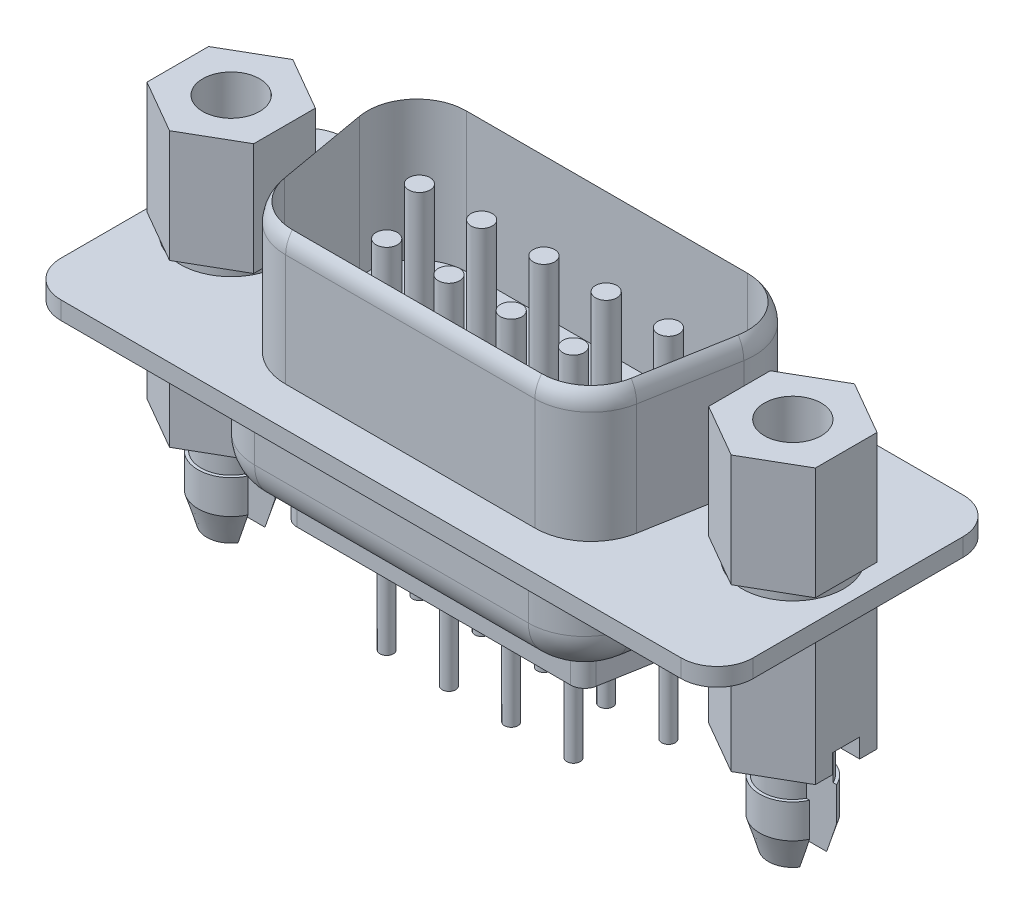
ISO-10303-21;
HEADER;
FILE_DESCRIPTION(('STEP AP214'),'2;1');
FILE_NAME('part.step','',(''),(''),'','','');
FILE_SCHEMA(('AUTOMOTIVE_DESIGN { 1 0 10303 214 1 1 1 1 }'));
ENDSEC;
DATA;
#1=APPLICATION_CONTEXT('core data for automotive mechanical design processes');
#2=APPLICATION_PROTOCOL_DEFINITION('international standard','automotive_design',2000,#1);
#3=PRODUCT_CONTEXT('',#1,'mechanical');
#4=PRODUCT('Part','Part','',(#3));
#5=PRODUCT_RELATED_PRODUCT_CATEGORY('part','',(#4));
#6=PRODUCT_DEFINITION_FORMATION('','',#4);
#7=PRODUCT_DEFINITION_CONTEXT('part definition',#1,'design');
#8=PRODUCT_DEFINITION('design','',#6,#7);
#9=PRODUCT_DEFINITION_SHAPE('','',#8);
#10=(LENGTH_UNIT() NAMED_UNIT(*) SI_UNIT(.MILLI.,.METRE.));
#11=(NAMED_UNIT(*) PLANE_ANGLE_UNIT() SI_UNIT($,.RADIAN.));
#12=(NAMED_UNIT(*) SI_UNIT($,.STERADIAN.) SOLID_ANGLE_UNIT());
#13=UNCERTAINTY_MEASURE_WITH_UNIT(LENGTH_MEASURE(1.E-05),#10,'distance_accuracy_value','');
#14=(GEOMETRIC_REPRESENTATION_CONTEXT(3) GLOBAL_UNCERTAINTY_ASSIGNED_CONTEXT((#13)) GLOBAL_UNIT_ASSIGNED_CONTEXT((#10,
#11,#12)) REPRESENTATION_CONTEXT('',''));
#15=CARTESIAN_POINT('',(0.,0.,0.));
#16=DIRECTION('',(0.,0.,1.));
#17=DIRECTION('',(1.,0.,0.));
#18=AXIS2_PLACEMENT_3D('',#15,#16,#17);
#19=CARTESIAN_POINT('',(14.87,0.85,-0.6));
#20=DIRECTION('',(0.,1.,0.));
#21=DIRECTION('',(1.,0.,0.));
#22=AXIS2_PLACEMENT_3D('',#19,#20,#21);
#23=PLANE('',#22);
#24=DIRECTION('',(1.,0.,0.));
#25=VECTOR('',#24,1.);
#26=CARTESIAN_POINT('',(14.87,0.85,0.6));
#27=LINE('',#26,#25);
#28=CARTESIAN_POINT('',(14.87,0.85,0.6));
#29=VERTEX_POINT('',#28);
#30=CARTESIAN_POINT('',(10.12,0.85,0.6));
#31=VERTEX_POINT('',#30);
#32=EDGE_CURVE('E1030',#29,#31,#27,.F.);
#33=ORIENTED_EDGE('',*,*,#32,.T.);
#34=DIRECTION('',(0.,0.,-1.));
#35=VECTOR('',#34,1.);
#36=CARTESIAN_POINT('',(10.12,0.85,-0.6));
#37=LINE('',#36,#35);
#38=CARTESIAN_POINT('',(10.12,0.85,-0.6));
#39=VERTEX_POINT('',#38);
#40=EDGE_CURVE('E1034',#39,#31,#37,.F.);
#41=ORIENTED_EDGE('',*,*,#40,.F.);
#42=DIRECTION('',(1.,0.,0.));
#43=VECTOR('',#42,1.);
#44=CARTESIAN_POINT('',(14.87,0.85,-0.6));
#45=LINE('',#44,#43);
#46=CARTESIAN_POINT('',(14.87,0.85,-0.6));
#47=VERTEX_POINT('',#46);
#48=EDGE_CURVE('E1057',#39,#47,#45,.T.);
#49=ORIENTED_EDGE('',*,*,#48,.T.);
#50=DIRECTION('',(0.,0.,-1.));
#51=VECTOR('',#50,1.);
#52=CARTESIAN_POINT('',(14.87,0.85,-0.6));
#53=LINE('',#52,#51);
#54=EDGE_CURVE('E975',#29,#47,#53,.T.);
#55=ORIENTED_EDGE('',*,*,#54,.F.);
#56=EDGE_LOOP('',(#33,#41,#49,#55));
#57=FACE_BOUND('',#56,.T.);
#58=ADVANCED_FACE('F14',(#57),#23,.F.);
#59=CARTESIAN_POINT('',(-10.12,0.85,-0.6));
#60=DIRECTION('',(0.,1.,0.));
#61=DIRECTION('',(1.,0.,0.));
#62=AXIS2_PLACEMENT_3D('',#59,#60,#61);
#63=PLANE('',#62);
#64=DIRECTION('',(0.,0.,-1.));
#65=VECTOR('',#64,1.);
#66=CARTESIAN_POINT('',(-14.87,0.85,-0.6));
#67=LINE('',#66,#65);
#68=CARTESIAN_POINT('',(-14.87,0.85,-0.6));
#69=VERTEX_POINT('',#68);
#70=CARTESIAN_POINT('',(-14.87,0.85,0.6));
#71=VERTEX_POINT('',#70);
#72=EDGE_CURVE('E969',#69,#71,#67,.F.);
#73=ORIENTED_EDGE('',*,*,#72,.F.);
#74=DIRECTION('',(1.,0.,0.));
#75=VECTOR('',#74,1.);
#76=CARTESIAN_POINT('',(-10.12,0.85,-0.6));
#77=LINE('',#76,#75);
#78=CARTESIAN_POINT('',(-10.12,0.85,-0.6));
#79=VERTEX_POINT('',#78);
#80=EDGE_CURVE('E989',#69,#79,#77,.T.);
#81=ORIENTED_EDGE('',*,*,#80,.T.);
#82=DIRECTION('',(0.,0.,-1.));
#83=VECTOR('',#82,1.);
#84=CARTESIAN_POINT('',(-10.12,0.85,-0.6));
#85=LINE('',#84,#83);
#86=CARTESIAN_POINT('',(-10.12,0.85,0.6));
#87=VERTEX_POINT('',#86);
#88=EDGE_CURVE('E972',#87,#79,#85,.T.);
#89=ORIENTED_EDGE('',*,*,#88,.F.);
#90=DIRECTION('',(1.,0.,0.));
#91=VECTOR('',#90,1.);
#92=CARTESIAN_POINT('',(-10.12,0.85,0.6));
#93=LINE('',#92,#91);
#94=EDGE_CURVE('E966',#87,#71,#93,.F.);
#95=ORIENTED_EDGE('',*,*,#94,.T.);
#96=EDGE_LOOP('',(#73,#81,#89,#95));
#97=FACE_BOUND('',#96,.T.);
#98=ADVANCED_FACE('F3027',(#97),#63,.F.);
#99=CARTESIAN_POINT('',(0.,-4.3,0.));
#100=DIRECTION('',(0.,-1.,0.));
#101=DIRECTION('',(-1.,0.,0.));
#102=AXIS2_PLACEMENT_3D('',#99,#100,#101);
#103=PLANE('',#102);
#104=CARTESIAN_POINT('',(-4.155,-4.3,1.42));
#105=DIRECTION('',(0.,-1.,0.));
#106=DIRECTION('',(-1.,0.,0.));
#107=AXIS2_PLACEMENT_3D('',#104,#105,#106);
#108=CIRCLE('',#107,0.3);
#109=CARTESIAN_POINT('',(-4.455,-4.3,1.42));
#110=VERTEX_POINT('',#109);
#111=EDGE_CURVE('E942',#110,#110,#108,.F.);
#112=ORIENTED_EDGE('',*,*,#111,.F.);
#113=EDGE_LOOP('',(#112));
#114=FACE_BOUND('',#113,.T.);
#115=ADVANCED_FACE('F3047',(#114),#103,.T.);
#116=CARTESIAN_POINT('',(0.,-4.3,0.));
#117=DIRECTION('',(0.,-1.,0.));
#118=DIRECTION('',(-1.,0.,0.));
#119=AXIS2_PLACEMENT_3D('',#116,#117,#118);
#120=PLANE('',#119);
#121=CARTESIAN_POINT('',(-1.385,-4.3,1.42));
#122=DIRECTION('',(0.,-1.,0.));
#123=DIRECTION('',(-1.,0.,0.));
#124=AXIS2_PLACEMENT_3D('',#121,#122,#123);
#125=CIRCLE('',#124,0.3);
#126=CARTESIAN_POINT('',(-1.685,-4.3,1.42));
#127=VERTEX_POINT('',#126);
#128=EDGE_CURVE('E1326',#127,#127,#125,.F.);
#129=ORIENTED_EDGE('',*,*,#128,.F.);
#130=EDGE_LOOP('',(#129));
#131=FACE_BOUND('',#130,.T.);
#132=ADVANCED_FACE('F3053',(#131),#120,.T.);
#133=CARTESIAN_POINT('',(0.,-4.3,0.));
#134=DIRECTION('',(0.,-1.,0.));
#135=DIRECTION('',(-1.,0.,0.));
#136=AXIS2_PLACEMENT_3D('',#133,#134,#135);
#137=PLANE('',#136);
#138=CARTESIAN_POINT('',(1.385,-4.3,1.42));
#139=DIRECTION('',(0.,-1.,0.));
#140=DIRECTION('',(-1.,0.,0.));
#141=AXIS2_PLACEMENT_3D('',#138,#139,#140);
#142=CIRCLE('',#141,0.3);
#143=CARTESIAN_POINT('',(1.085,-4.3,1.42));
#144=VERTEX_POINT('',#143);
#145=EDGE_CURVE('E1323',#144,#144,#142,.F.);
#146=ORIENTED_EDGE('',*,*,#145,.F.);
#147=EDGE_LOOP('',(#146));
#148=FACE_BOUND('',#147,.T.);
#149=ADVANCED_FACE('F3060',(#148),#137,.T.);
#150=CARTESIAN_POINT('',(0.,-4.3,0.));
#151=DIRECTION('',(0.,-1.,0.));
#152=DIRECTION('',(-1.,0.,0.));
#153=AXIS2_PLACEMENT_3D('',#150,#151,#152);
#154=PLANE('',#153);
#155=CARTESIAN_POINT('',(4.155,-4.3,1.42));
#156=DIRECTION('',(0.,-1.,0.));
#157=DIRECTION('',(-1.,0.,0.));
#158=AXIS2_PLACEMENT_3D('',#155,#156,#157);
#159=CIRCLE('',#158,0.3);
#160=CARTESIAN_POINT('',(3.855,-4.3,1.42));
#161=VERTEX_POINT('',#160);
#162=EDGE_CURVE('E1320',#161,#161,#159,.F.);
#163=ORIENTED_EDGE('',*,*,#162,.F.);
#164=EDGE_LOOP('',(#163));
#165=FACE_BOUND('',#164,.T.);
#166=ADVANCED_FACE('F3064',(#165),#154,.T.);
#167=CARTESIAN_POINT('',(0.,-4.3,0.));
#168=DIRECTION('',(0.,-1.,0.));
#169=DIRECTION('',(-1.,0.,0.));
#170=AXIS2_PLACEMENT_3D('',#167,#168,#169);
#171=PLANE('',#170);
#172=CARTESIAN_POINT('',(-5.54,-4.3,-1.42));
#173=DIRECTION('',(0.,-1.,0.));
#174=DIRECTION('',(-1.,0.,0.));
#175=AXIS2_PLACEMENT_3D('',#172,#173,#174);
#176=CIRCLE('',#175,0.3);
#177=CARTESIAN_POINT('',(-5.84,-4.3,-1.42));
#178=VERTEX_POINT('',#177);
#179=EDGE_CURVE('E1317',#178,#178,#176,.F.);
#180=ORIENTED_EDGE('',*,*,#179,.F.);
#181=EDGE_LOOP('',(#180));
#182=FACE_BOUND('',#181,.T.);
#183=ADVANCED_FACE('F3068',(#182),#171,.T.);
#184=CARTESIAN_POINT('',(0.,-4.3,0.));
#185=DIRECTION('',(0.,-1.,0.));
#186=DIRECTION('',(-1.,0.,0.));
#187=AXIS2_PLACEMENT_3D('',#184,#185,#186);
#188=PLANE('',#187);
#189=CARTESIAN_POINT('',(-2.77,-4.3,-1.42));
#190=DIRECTION('',(0.,-1.,0.));
#191=DIRECTION('',(-1.,0.,0.));
#192=AXIS2_PLACEMENT_3D('',#189,#190,#191);
#193=CIRCLE('',#192,0.3);
#194=CARTESIAN_POINT('',(-3.07,-4.3,-1.42));
#195=VERTEX_POINT('',#194);
#196=EDGE_CURVE('E1314',#195,#195,#193,.F.);
#197=ORIENTED_EDGE('',*,*,#196,.F.);
#198=EDGE_LOOP('',(#197));
#199=FACE_BOUND('',#198,.T.);
#200=ADVANCED_FACE('F3072',(#199),#188,.T.);
#201=CARTESIAN_POINT('',(0.,-4.3,0.));
#202=DIRECTION('',(0.,-1.,0.));
#203=DIRECTION('',(-1.,0.,0.));
#204=AXIS2_PLACEMENT_3D('',#201,#202,#203);
#205=PLANE('',#204);
#206=CARTESIAN_POINT('',(0.,-4.3,-1.42));
#207=DIRECTION('',(0.,-1.,0.));
#208=DIRECTION('',(-1.,0.,0.));
#209=AXIS2_PLACEMENT_3D('',#206,#207,#208);
#210=CIRCLE('',#209,0.3);
#211=CARTESIAN_POINT('',(-0.3,-4.3,-1.42));
#212=VERTEX_POINT('',#211);
#213=EDGE_CURVE('E1311',#212,#212,#210,.F.);
#214=ORIENTED_EDGE('',*,*,#213,.F.);
#215=EDGE_LOOP('',(#214));
#216=FACE_BOUND('',#215,.T.);
#217=ADVANCED_FACE('F3076',(#216),#205,.T.);
#218=CARTESIAN_POINT('',(0.,-4.3,0.));
#219=DIRECTION('',(0.,-1.,0.));
#220=DIRECTION('',(-1.,0.,0.));
#221=AXIS2_PLACEMENT_3D('',#218,#219,#220);
#222=PLANE('',#221);
#223=CARTESIAN_POINT('',(2.77,-4.3,-1.42));
#224=DIRECTION('',(0.,-1.,0.));
#225=DIRECTION('',(-1.,0.,0.));
#226=AXIS2_PLACEMENT_3D('',#223,#224,#225);
#227=CIRCLE('',#226,0.3);
#228=CARTESIAN_POINT('',(2.47,-4.3,-1.42));
#229=VERTEX_POINT('',#228);
#230=EDGE_CURVE('E1308',#229,#229,#227,.F.);
#231=ORIENTED_EDGE('',*,*,#230,.F.);
#232=EDGE_LOOP('',(#231));
#233=FACE_BOUND('',#232,.T.);
#234=ADVANCED_FACE('F3080',(#233),#222,.T.);
#235=CARTESIAN_POINT('',(0.,-4.3,0.));
#236=DIRECTION('',(0.,-1.,0.));
#237=DIRECTION('',(-1.,0.,0.));
#238=AXIS2_PLACEMENT_3D('',#235,#236,#237);
#239=PLANE('',#238);
#240=CARTESIAN_POINT('',(5.54,-4.3,-1.42));
#241=DIRECTION('',(0.,-1.,0.));
#242=DIRECTION('',(-1.,0.,0.));
#243=AXIS2_PLACEMENT_3D('',#240,#241,#242);
#244=CIRCLE('',#243,0.3);
#245=CARTESIAN_POINT('',(5.24,-4.3,-1.42));
#246=VERTEX_POINT('',#245);
#247=EDGE_CURVE('E389',#246,#246,#244,.F.);
#248=ORIENTED_EDGE('',*,*,#247,.F.);
#249=EDGE_LOOP('',(#248));
#250=FACE_BOUND('',#249,.T.);
#251=ADVANCED_FACE('F3083',(#250),#239,.T.);
#252=CARTESIAN_POINT('',(14.87,-4.3,-0.6));
#253=DIRECTION('',(0.,0.,-1.));
#254=DIRECTION('',(0.,1.,0.));
#255=AXIS2_PLACEMENT_3D('',#252,#253,#254);
#256=PLANE('',#255);
#257=DIRECTION('',(0.,1.,0.));
#258=VECTOR('',#257,1.);
#259=CARTESIAN_POINT('',(14.87,-4.3,-0.6));
#260=LINE('',#259,#258);
#261=CARTESIAN_POINT('',(14.87,0.,-0.6));
#262=VERTEX_POINT('',#261);
#263=EDGE_CURVE('E1052',#47,#262,#260,.F.);
#264=ORIENTED_EDGE('',*,*,#263,.F.);
#265=ORIENTED_EDGE('',*,*,#48,.F.);
#266=DIRECTION('',(0.,1.,0.));
#267=VECTOR('',#266,1.);
#268=CARTESIAN_POINT('',(10.12,-4.3,-0.6));
#269=LINE('',#268,#267);
#270=CARTESIAN_POINT('',(10.12,0.,-0.6));
#271=VERTEX_POINT('',#270);
#272=EDGE_CURVE('E1060',#271,#39,#269,.T.);
#273=ORIENTED_EDGE('',*,*,#272,.F.);
#274=DIRECTION('',(1.,0.,0.));
#275=VECTOR('',#274,1.);
#276=CARTESIAN_POINT('',(14.87,0.,-0.6));
#277=LINE('',#276,#275);
#278=CARTESIAN_POINT('',(11.29683473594,0.,-0.6));
#279=VERTEX_POINT('',#278);
#280=EDGE_CURVE('E1063',#279,#271,#277,.F.);
#281=ORIENTED_EDGE('',*,*,#280,.F.);
#282=DIRECTION('',(0.,1.,0.));
#283=VECTOR('',#282,1.);
#284=CARTESIAN_POINT('',(11.29683473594,-4.3,-0.6));
#285=LINE('',#284,#283);
#286=CARTESIAN_POINT('',(11.29683473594,-1.5,-0.6));
#287=VERTEX_POINT('',#286);
#288=EDGE_CURVE('E1069',#287,#279,#285,.T.);
#289=ORIENTED_EDGE('',*,*,#288,.F.);
#290=DIRECTION('',(1.,0.,0.));
#291=VECTOR('',#290,1.);
#292=CARTESIAN_POINT('',(14.87,-1.5,-0.6));
#293=LINE('',#292,#291);
#294=CARTESIAN_POINT('',(11.1475487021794,-1.5,-0.6));
#295=VERTEX_POINT('',#294);
#296=EDGE_CURVE('E1072',#295,#287,#293,.T.);
#297=ORIENTED_EDGE('',*,*,#296,.F.);
#298=DIRECTION('',(0.,1.,0.));
#299=VECTOR('',#298,1.);
#300=CARTESIAN_POINT('',(11.14754870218,-4.3,-0.6));
#301=LINE('',#300,#299);
#302=CARTESIAN_POINT('',(11.1475487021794,-3.00000000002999,-0.6));
#303=VERTEX_POINT('',#302);
#304=EDGE_CURVE('E356',#303,#295,#301,.T.);
#305=ORIENTED_EDGE('',*,*,#304,.F.);
#306=CARTESIAN_POINT('',(11.5909950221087,-4.30000000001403,-0.6));
#307=CARTESIAN_POINT('',(11.5522404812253,-4.19228770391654,-0.6));
#308=CARTESIAN_POINT('',(11.5141089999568,-4.08435448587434,-0.6));
#309=CARTESIAN_POINT('',(11.4388183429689,-3.86815471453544,-0.6));
#310=CARTESIAN_POINT('',(11.4016591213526,-3.75988817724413,-0.6));
#311=CARTESIAN_POINT('',(11.3280363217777,-3.5431223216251,-0.6));
#312=CARTESIAN_POINT('',(11.291572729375,-3.4346230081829,-0.6));
#313=CARTESIAN_POINT('',(11.2191895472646,-3.21743730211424,-0.6));
#314=CARTESIAN_POINT('',(11.1832699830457,-3.10875090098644,-0.6));
#315=CARTESIAN_POINT('',(11.1475487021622,-3.00000000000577,-0.6));
#316=B_SPLINE_CURVE_WITH_KNOTS('',3,(#306,#307,#308,#309,#310,#311,#312,#313,#314,#315),
.UNSPECIFIED.,.F.,.F.,(4,2,2,2,4),(0.,0.343409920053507,0.686803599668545,1.03019014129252,
1.37359272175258),.UNSPECIFIED.);
#317=CARTESIAN_POINT('',(11.59099502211,-4.30000000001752,-0.6));
#318=VERTEX_POINT('',#317);
#319=EDGE_CURVE('E336',#318,#303,#316,.T.);
#320=ORIENTED_EDGE('',*,*,#319,.F.);
#321=DIRECTION('',(1.,0.,0.));
#322=VECTOR('',#321,1.);
#323=CARTESIAN_POINT('',(12.495,-4.3,-0.6));
#324=LINE('',#323,#322);
#325=CARTESIAN_POINT('',(13.39900497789,-4.30000000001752,-0.6));
#326=VERTEX_POINT('',#325);
#327=EDGE_CURVE('E332',#318,#326,#324,.T.);
#328=ORIENTED_EDGE('',*,*,#327,.T.);
#329=CARTESIAN_POINT('',(13.8424512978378,-3.00000000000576,-0.6));
#330=CARTESIAN_POINT('',(13.8067300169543,-3.10875090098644,-0.6));
#331=CARTESIAN_POINT('',(13.7708104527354,-3.21743730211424,-0.6));
#332=CARTESIAN_POINT('',(13.698427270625,-3.4346230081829,-0.6));
#333=CARTESIAN_POINT('',(13.6619636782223,-3.5431223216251,-0.6));
#334=CARTESIAN_POINT('',(13.5883408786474,-3.75988817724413,-0.6));
#335=CARTESIAN_POINT('',(13.5511816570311,-3.86815471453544,-0.6));
#336=CARTESIAN_POINT('',(13.4758910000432,-4.08435448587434,-0.6));
#337=CARTESIAN_POINT('',(13.4377595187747,-4.19228770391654,-0.6));
#338=CARTESIAN_POINT('',(13.3990049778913,-4.30000000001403,-0.6));
#339=B_SPLINE_CURVE_WITH_KNOTS('',3,(#329,#330,#331,#332,#333,#334,#335,#336,#337,#338),
.UNSPECIFIED.,.F.,.F.,(4,2,2,2,4),(0.,0.34340258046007,0.686789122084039,1.03018280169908,
1.37359272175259),.UNSPECIFIED.);
#340=CARTESIAN_POINT('',(13.8424512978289,-3.00000000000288,-0.6));
#341=VERTEX_POINT('',#340);
#342=EDGE_CURVE('E18',#341,#326,#339,.T.);
#343=ORIENTED_EDGE('',*,*,#342,.F.);
#344=DIRECTION('',(0.,1.,0.));
#345=VECTOR('',#344,1.);
#346=CARTESIAN_POINT('',(13.84245129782,-4.3,-0.6));
#347=LINE('',#346,#345);
#348=CARTESIAN_POINT('',(13.8424512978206,-1.5,-0.6));
#349=VERTEX_POINT('',#348);
#350=EDGE_CURVE('E329',#349,#341,#347,.F.);
#351=ORIENTED_EDGE('',*,*,#350,.F.);
#352=DIRECTION('',(1.,0.,0.));
#353=VECTOR('',#352,1.);
#354=CARTESIAN_POINT('',(14.87,-1.5,-0.6));
#355=LINE('',#354,#353);
#356=CARTESIAN_POINT('',(13.69316526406,-1.5,-0.6));
#357=VERTEX_POINT('',#356);
#358=EDGE_CURVE('E350',#357,#349,#355,.T.);
#359=ORIENTED_EDGE('',*,*,#358,.F.);
#360=DIRECTION('',(0.,1.,0.));
#361=VECTOR('',#360,1.);
#362=CARTESIAN_POINT('',(13.69316526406,-4.3,-0.6));
#363=LINE('',#362,#361);
#364=CARTESIAN_POINT('',(13.69316526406,0.,-0.6));
#365=VERTEX_POINT('',#364);
#366=EDGE_CURVE('E352',#365,#357,#363,.F.);
#367=ORIENTED_EDGE('',*,*,#366,.F.);
#368=DIRECTION('',(1.,0.,0.));
#369=VECTOR('',#368,1.);
#370=CARTESIAN_POINT('',(14.87,0.,-0.6));
#371=LINE('',#370,#369);
#372=EDGE_CURVE('E1016',#262,#365,#371,.F.);
#373=ORIENTED_EDGE('',*,*,#372,.F.);
#374=EDGE_LOOP('',(#264,#265,#273,#281,#289,#297,#305,#320,#328,#343,#351,#359,#367,#373));
#375=FACE_BOUND('',#374,.T.);
#376=ADVANCED_FACE('F327',(#375),#256,.F.);
#377=CARTESIAN_POINT('',(14.87,0.85,0.6));
#378=DIRECTION('',(0.,0.,1.));
#379=DIRECTION('',(0.,-1.,0.));
#380=AXIS2_PLACEMENT_3D('',#377,#378,#379);
#381=PLANE('',#380);
#382=CARTESIAN_POINT('',(13.3990049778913,-4.30000000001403,0.6));
#383=CARTESIAN_POINT('',(13.4377595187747,-4.19228770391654,0.6));
#384=CARTESIAN_POINT('',(13.4758910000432,-4.08435448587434,0.6));
#385=CARTESIAN_POINT('',(13.5511816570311,-3.86815471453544,0.6));
#386=CARTESIAN_POINT('',(13.5883408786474,-3.75988817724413,0.6));
#387=CARTESIAN_POINT('',(13.6619636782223,-3.5431223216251,0.6));
#388=CARTESIAN_POINT('',(13.698427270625,-3.4346230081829,0.6));
#389=CARTESIAN_POINT('',(13.7708104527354,-3.21743730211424,0.6));
#390=CARTESIAN_POINT('',(13.8067300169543,-3.10875090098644,0.6));
#391=CARTESIAN_POINT('',(13.8424512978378,-3.00000000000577,0.6));
#392=B_SPLINE_CURVE_WITH_KNOTS('',3,(#382,#383,#384,#385,#386,#387,#388,#389,#390,#391),
.UNSPECIFIED.,.F.,.F.,(4,2,2,2,4),(0.,0.343409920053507,0.686803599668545,1.03019014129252,
1.37359272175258),.UNSPECIFIED.);
#393=CARTESIAN_POINT('',(13.39900497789,-4.30000000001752,0.6));
#394=VERTEX_POINT('',#393);
#395=CARTESIAN_POINT('',(13.8424512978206,-3.00000000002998,0.6));
#396=VERTEX_POINT('',#395);
#397=EDGE_CURVE('E361',#394,#396,#392,.T.);
#398=ORIENTED_EDGE('',*,*,#397,.F.);
#399=DIRECTION('',(1.,0.,0.));
#400=VECTOR('',#399,1.);
#401=CARTESIAN_POINT('',(12.495,-4.3,0.6));
#402=LINE('',#401,#400);
#403=CARTESIAN_POINT('',(11.59099502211,-4.30000000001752,0.6));
#404=VERTEX_POINT('',#403);
#405=EDGE_CURVE('E388',#394,#404,#402,.F.);
#406=ORIENTED_EDGE('',*,*,#405,.T.);
#407=CARTESIAN_POINT('',(11.1475487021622,-3.00000000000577,0.6));
#408=CARTESIAN_POINT('',(11.1832699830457,-3.10875090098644,0.6));
#409=CARTESIAN_POINT('',(11.2191895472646,-3.21743730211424,0.6));
#410=CARTESIAN_POINT('',(11.291572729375,-3.4346230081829,0.6));
#411=CARTESIAN_POINT('',(11.3280363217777,-3.5431223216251,0.6));
#412=CARTESIAN_POINT('',(11.4016591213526,-3.75988817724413,0.6));
#413=CARTESIAN_POINT('',(11.4388183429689,-3.86815471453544,0.6));
#414=CARTESIAN_POINT('',(11.5141089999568,-4.08435448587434,0.6));
#415=CARTESIAN_POINT('',(11.5522404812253,-4.19228770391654,0.6));
#416=CARTESIAN_POINT('',(11.5909950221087,-4.30000000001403,0.6));
#417=B_SPLINE_CURVE_WITH_KNOTS('',3,(#407,#408,#409,#410,#411,#412,#413,#414,#415,#416),
.UNSPECIFIED.,.F.,.F.,(4,2,2,2,4),(0.,0.343402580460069,0.686789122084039,1.03018280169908,
1.37359272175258),.UNSPECIFIED.);
#418=CARTESIAN_POINT('',(11.1475487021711,-3.00000000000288,0.6));
#419=VERTEX_POINT('',#418);
#420=EDGE_CURVE('E365',#419,#404,#417,.T.);
#421=ORIENTED_EDGE('',*,*,#420,.F.);
#422=DIRECTION('',(0.,-1.,0.));
#423=VECTOR('',#422,1.);
#424=CARTESIAN_POINT('',(11.14754870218,0.85,0.6));
#425=LINE('',#424,#423);
#426=CARTESIAN_POINT('',(11.1475487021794,-1.5,0.6));
#427=VERTEX_POINT('',#426);
#428=EDGE_CURVE('E362',#427,#419,#425,.T.);
#429=ORIENTED_EDGE('',*,*,#428,.F.);
#430=DIRECTION('',(1.,0.,0.));
#431=VECTOR('',#430,1.);
#432=CARTESIAN_POINT('',(14.87,-1.5,0.6));
#433=LINE('',#432,#431);
#434=CARTESIAN_POINT('',(11.29683473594,-1.5,0.6));
#435=VERTEX_POINT('',#434);
#436=EDGE_CURVE('E366',#435,#427,#433,.F.);
#437=ORIENTED_EDGE('',*,*,#436,.F.);
#438=DIRECTION('',(0.,-1.,0.));
#439=VECTOR('',#438,1.);
#440=CARTESIAN_POINT('',(11.29683473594,0.85,0.6));
#441=LINE('',#440,#439);
#442=CARTESIAN_POINT('',(11.29683473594,0.,0.6));
#443=VERTEX_POINT('',#442);
#444=EDGE_CURVE('E1019',#443,#435,#441,.T.);
#445=ORIENTED_EDGE('',*,*,#444,.F.);
#446=DIRECTION('',(1.,0.,0.));
#447=VECTOR('',#446,1.);
#448=CARTESIAN_POINT('',(14.87,0.,0.6));
#449=LINE('',#448,#447);
#450=CARTESIAN_POINT('',(10.12,0.,0.6));
#451=VERTEX_POINT('',#450);
#452=EDGE_CURVE('E1022',#451,#443,#449,.T.);
#453=ORIENTED_EDGE('',*,*,#452,.F.);
#454=DIRECTION('',(0.,-1.,0.));
#455=VECTOR('',#454,1.);
#456=CARTESIAN_POINT('',(10.12,0.85,0.6));
#457=LINE('',#456,#455);
#458=EDGE_CURVE('E1025',#31,#451,#457,.T.);
#459=ORIENTED_EDGE('',*,*,#458,.F.);
#460=ORIENTED_EDGE('',*,*,#32,.F.);
#461=DIRECTION('',(0.,-1.,0.));
#462=VECTOR('',#461,1.);
#463=CARTESIAN_POINT('',(14.87,0.85,0.6));
#464=LINE('',#463,#462);
#465=CARTESIAN_POINT('',(14.87,0.,0.6));
#466=VERTEX_POINT('',#465);
#467=EDGE_CURVE('E1033',#466,#29,#464,.F.);
#468=ORIENTED_EDGE('',*,*,#467,.F.);
#469=DIRECTION('',(1.,0.,0.));
#470=VECTOR('',#469,1.);
#471=CARTESIAN_POINT('',(14.87,0.,0.6));
#472=LINE('',#471,#470);
#473=CARTESIAN_POINT('',(13.69316526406,0.,0.6));
#474=VERTEX_POINT('',#473);
#475=EDGE_CURVE('E1041',#474,#466,#472,.T.);
#476=ORIENTED_EDGE('',*,*,#475,.F.);
#477=DIRECTION('',(0.,-1.,0.));
#478=VECTOR('',#477,1.);
#479=CARTESIAN_POINT('',(13.69316526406,0.85,0.6));
#480=LINE('',#479,#478);
#481=CARTESIAN_POINT('',(13.69316526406,-1.5,0.6));
#482=VERTEX_POINT('',#481);
#483=EDGE_CURVE('E1015',#482,#474,#480,.F.);
#484=ORIENTED_EDGE('',*,*,#483,.F.);
#485=DIRECTION('',(1.,0.,0.));
#486=VECTOR('',#485,1.);
#487=CARTESIAN_POINT('',(14.87,-1.5,0.6));
#488=LINE('',#487,#486);
#489=CARTESIAN_POINT('',(13.8424512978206,-1.5,0.6));
#490=VERTEX_POINT('',#489);
#491=EDGE_CURVE('E1012',#490,#482,#488,.F.);
#492=ORIENTED_EDGE('',*,*,#491,.F.);
#493=DIRECTION('',(0.,-1.,0.));
#494=VECTOR('',#493,1.);
#495=CARTESIAN_POINT('',(13.84245129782,0.85,0.6));
#496=LINE('',#495,#494);
#497=EDGE_CURVE('E357',#396,#490,#496,.F.);
#498=ORIENTED_EDGE('',*,*,#497,.F.);
#499=EDGE_LOOP('',(#398,#406,#421,#429,#437,#445,#453,#459,#460,#468,#476,#484,#492,#498));
#500=FACE_BOUND('',#499,.T.);
#501=ADVANCED_FACE('F2051',(#500),#381,.F.);
#502=CARTESIAN_POINT('',(-10.12,-4.3,-0.6));
#503=DIRECTION('',(0.,0.,-1.));
#504=DIRECTION('',(0.,1.,0.));
#505=AXIS2_PLACEMENT_3D('',#502,#503,#504);
#506=PLANE('',#505);
#507=ORIENTED_EDGE('',*,*,#80,.F.);
#508=DIRECTION('',(0.,1.,0.));
#509=VECTOR('',#508,1.);
#510=CARTESIAN_POINT('',(-14.87,-4.3,-0.6));
#511=LINE('',#510,#509);
#512=CARTESIAN_POINT('',(-14.87,0.,-0.6));
#513=VERTEX_POINT('',#512);
#514=EDGE_CURVE('E986',#513,#69,#511,.T.);
#515=ORIENTED_EDGE('',*,*,#514,.F.);
#516=DIRECTION('',(1.,0.,0.));
#517=VECTOR('',#516,1.);
#518=CARTESIAN_POINT('',(-10.12,0.,-0.6));
#519=LINE('',#518,#517);
#520=CARTESIAN_POINT('',(-13.69316526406,0.,-0.6));
#521=VERTEX_POINT('',#520);
#522=EDGE_CURVE('E983',#521,#513,#519,.F.);
#523=ORIENTED_EDGE('',*,*,#522,.F.);
#524=DIRECTION('',(0.,1.,0.));
#525=VECTOR('',#524,1.);
#526=CARTESIAN_POINT('',(-13.69316526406,-4.3,-0.6));
#527=LINE('',#526,#525);
#528=CARTESIAN_POINT('',(-13.69316526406,-1.5,-0.6));
#529=VERTEX_POINT('',#528);
#530=EDGE_CURVE('E980',#529,#521,#527,.T.);
#531=ORIENTED_EDGE('',*,*,#530,.F.);
#532=DIRECTION('',(1.,0.,0.));
#533=VECTOR('',#532,1.);
#534=CARTESIAN_POINT('',(-10.12,-1.5,-0.6));
#535=LINE('',#534,#533);
#536=CARTESIAN_POINT('',(-13.8424512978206,-1.5,-0.6));
#537=VERTEX_POINT('',#536);
#538=EDGE_CURVE('E370',#537,#529,#535,.T.);
#539=ORIENTED_EDGE('',*,*,#538,.F.);
#540=DIRECTION('',(0.,1.,0.));
#541=VECTOR('',#540,1.);
#542=CARTESIAN_POINT('',(-13.84245129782,-4.3,-0.6));
#543=LINE('',#542,#541);
#544=CARTESIAN_POINT('',(-13.8424512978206,-3.00000000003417,-0.6));
#545=VERTEX_POINT('',#544);
#546=EDGE_CURVE('E367',#545,#537,#543,.T.);
#547=ORIENTED_EDGE('',*,*,#546,.F.);
#548=CARTESIAN_POINT('',(-13.399004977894,-4.30000000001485,-0.6));
#549=CARTESIAN_POINT('',(-13.4377595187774,-4.19228770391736,-0.6));
#550=CARTESIAN_POINT('',(-13.4758910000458,-4.08435448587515,-0.6));
#551=CARTESIAN_POINT('',(-13.5511816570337,-3.86815471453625,-0.6));
#552=CARTESIAN_POINT('',(-13.58834087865,-3.75988817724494,-0.6));
#553=CARTESIAN_POINT('',(-13.6619636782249,-3.54312232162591,-0.6));
#554=CARTESIAN_POINT('',(-13.6984272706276,-3.43462300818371,-0.6));
#555=CARTESIAN_POINT('',(-13.7708104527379,-3.21743730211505,-0.6));
#556=CARTESIAN_POINT('',(-13.8067300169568,-3.10875090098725,-0.6));
#557=CARTESIAN_POINT('',(-13.8424512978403,-3.00000000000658,-0.6));
#558=B_SPLINE_CURVE_WITH_KNOTS('',3,(#548,#549,#550,#551,#552,#553,#554,#555,#556,#557),
.UNSPECIFIED.,.F.,.F.,(4,2,2,2,4),(0.,0.343409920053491,0.686803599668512,1.03019014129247,
1.37359272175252),.UNSPECIFIED.);
#559=CARTESIAN_POINT('',(-13.3990049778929,-4.30000000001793,-0.6));
#560=VERTEX_POINT('',#559);
#561=EDGE_CURVE('E371',#560,#545,#558,.T.);
#562=ORIENTED_EDGE('',*,*,#561,.F.);
#563=DIRECTION('',(1.,0.,0.));
#564=VECTOR('',#563,1.);
#565=CARTESIAN_POINT('',(-12.495,-4.3,-0.6));
#566=LINE('',#565,#564);
#567=CARTESIAN_POINT('',(-11.5909950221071,-4.30000000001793,-0.6));
#568=VERTEX_POINT('',#567);
#569=EDGE_CURVE('E392',#560,#568,#566,.T.);
#570=ORIENTED_EDGE('',*,*,#569,.T.);
#571=CARTESIAN_POINT('',(-11.1475487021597,-3.00000000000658,-0.6));
#572=CARTESIAN_POINT('',(-11.1832699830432,-3.10875090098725,-0.6));
#573=CARTESIAN_POINT('',(-11.2191895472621,-3.21743730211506,-0.6));
#574=CARTESIAN_POINT('',(-11.2915727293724,-3.43462300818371,-0.6));
#575=CARTESIAN_POINT('',(-11.3280363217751,-3.54312232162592,-0.6));
#576=CARTESIAN_POINT('',(-11.40165912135,-3.75988817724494,-0.6));
#577=CARTESIAN_POINT('',(-11.4388183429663,-3.86815471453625,-0.6));
#578=CARTESIAN_POINT('',(-11.5141089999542,-4.08435448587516,-0.6));
#579=CARTESIAN_POINT('',(-11.5522404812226,-4.19228770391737,-0.6));
#580=CARTESIAN_POINT('',(-11.590995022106,-4.30000000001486,-0.6));
#581=B_SPLINE_CURVE_WITH_KNOTS('',3,(#571,#572,#573,#574,#575,#576,#577,#578,#579,#580),
.UNSPECIFIED.,.F.,.F.,(4,2,2,2,4),(0.,0.343402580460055,0.686789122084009,1.03018280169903,
1.37359272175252),.UNSPECIFIED.);
#582=CARTESIAN_POINT('',(-11.1475487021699,-3.00000000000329,-0.6));
#583=VERTEX_POINT('',#582);
#584=EDGE_CURVE('E375',#583,#568,#581,.T.);
#585=ORIENTED_EDGE('',*,*,#584,.F.);
#586=DIRECTION('',(0.,1.,0.));
#587=VECTOR('',#586,1.);
#588=CARTESIAN_POINT('',(-11.14754870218,-4.3,-0.6));
#589=LINE('',#588,#587);
#590=CARTESIAN_POINT('',(-11.1475487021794,-1.5,-0.6));
#591=VERTEX_POINT('',#590);
#592=EDGE_CURVE('E372',#591,#583,#589,.F.);
#593=ORIENTED_EDGE('',*,*,#592,.F.);
#594=DIRECTION('',(1.,0.,0.));
#595=VECTOR('',#594,1.);
#596=CARTESIAN_POINT('',(-10.12,-1.5,-0.6));
#597=LINE('',#596,#595);
#598=CARTESIAN_POINT('',(-11.29683473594,-1.5,-0.6));
#599=VERTEX_POINT('',#598);
#600=EDGE_CURVE('E376',#599,#591,#597,.T.);
#601=ORIENTED_EDGE('',*,*,#600,.F.);
#602=DIRECTION('',(0.,1.,0.));
#603=VECTOR('',#602,1.);
#604=CARTESIAN_POINT('',(-11.29683473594,-4.3,-0.6));
#605=LINE('',#604,#603);
#606=CARTESIAN_POINT('',(-11.29683473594,0.,-0.6));
#607=VERTEX_POINT('',#606);
#608=EDGE_CURVE('E1001',#607,#599,#605,.F.);
#609=ORIENTED_EDGE('',*,*,#608,.F.);
#610=DIRECTION('',(1.,0.,0.));
#611=VECTOR('',#610,1.);
#612=CARTESIAN_POINT('',(-10.12,0.,-0.6));
#613=LINE('',#612,#611);
#614=CARTESIAN_POINT('',(-10.12,0.,-0.6));
#615=VERTEX_POINT('',#614);
#616=EDGE_CURVE('E360',#615,#607,#613,.F.);
#617=ORIENTED_EDGE('',*,*,#616,.F.);
#618=DIRECTION('',(0.,1.,0.));
#619=VECTOR('',#618,1.);
#620=CARTESIAN_POINT('',(-10.12,-4.3,-0.6));
#621=LINE('',#620,#619);
#622=EDGE_CURVE('E947',#79,#615,#621,.F.);
#623=ORIENTED_EDGE('',*,*,#622,.F.);
#624=EDGE_LOOP('',(#507,#515,#523,#531,#539,#547,#562,#570,#585,#593,#601,#609,#617,#623));
#625=FACE_BOUND('',#624,.T.);
#626=ADVANCED_FACE('F2054',(#625),#506,.F.);
#627=CARTESIAN_POINT('',(-10.12,0.85,0.6));
#628=DIRECTION('',(0.,0.,1.));
#629=DIRECTION('',(0.,-1.,0.));
#630=AXIS2_PLACEMENT_3D('',#627,#628,#629);
#631=PLANE('',#630);
#632=DIRECTION('',(1.,0.,0.));
#633=VECTOR('',#632,1.);
#634=CARTESIAN_POINT('',(-10.12,-1.5,0.6));
#635=LINE('',#634,#633);
#636=CARTESIAN_POINT('',(-11.1475487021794,-1.5,0.6));
#637=VERTEX_POINT('',#636);
#638=CARTESIAN_POINT('',(-11.29683473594,-1.5,0.6));
#639=VERTEX_POINT('',#638);
#640=EDGE_CURVE('E380',#637,#639,#635,.F.);
#641=ORIENTED_EDGE('',*,*,#640,.F.);
#642=DIRECTION('',(0.,-1.,0.));
#643=VECTOR('',#642,1.);
#644=CARTESIAN_POINT('',(-11.14754870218,0.85,0.6));
#645=LINE('',#644,#643);
#646=CARTESIAN_POINT('',(-11.1475487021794,-3.00000000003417,0.6));
#647=VERTEX_POINT('',#646);
#648=EDGE_CURVE('E377',#647,#637,#645,.F.);
#649=ORIENTED_EDGE('',*,*,#648,.F.);
#650=CARTESIAN_POINT('',(-11.590995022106,-4.30000000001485,0.6));
#651=CARTESIAN_POINT('',(-11.5522404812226,-4.19228770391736,0.6));
#652=CARTESIAN_POINT('',(-11.5141089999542,-4.08435448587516,0.6));
#653=CARTESIAN_POINT('',(-11.4388183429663,-3.86815471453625,0.6));
#654=CARTESIAN_POINT('',(-11.40165912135,-3.75988817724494,0.6));
#655=CARTESIAN_POINT('',(-11.3280363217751,-3.54312232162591,0.6));
#656=CARTESIAN_POINT('',(-11.2915727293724,-3.43462300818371,0.6));
#657=CARTESIAN_POINT('',(-11.2191895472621,-3.21743730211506,0.6));
#658=CARTESIAN_POINT('',(-11.1832699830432,-3.10875090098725,0.6));
#659=CARTESIAN_POINT('',(-11.1475487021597,-3.00000000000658,0.6));
#660=B_SPLINE_CURVE_WITH_KNOTS('',3,(#650,#651,#652,#653,#654,#655,#656,#657,#658,#659),
.UNSPECIFIED.,.F.,.F.,(4,2,2,2,4),(0.,0.343409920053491,0.686803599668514,1.03019014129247,
1.37359272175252),.UNSPECIFIED.);
#661=CARTESIAN_POINT('',(-11.5909950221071,-4.30000000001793,0.6));
#662=VERTEX_POINT('',#661);
#663=EDGE_CURVE('E381',#662,#647,#660,.T.);
#664=ORIENTED_EDGE('',*,*,#663,.F.);
#665=DIRECTION('',(1.,0.,0.));
#666=VECTOR('',#665,1.);
#667=CARTESIAN_POINT('',(-12.495,-4.3,0.6));
#668=LINE('',#667,#666);
#669=CARTESIAN_POINT('',(-13.3990049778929,-4.30000000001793,0.6));
#670=VERTEX_POINT('',#669);
#671=EDGE_CURVE('E395',#662,#670,#668,.F.);
#672=ORIENTED_EDGE('',*,*,#671,.T.);
#673=CARTESIAN_POINT('',(-13.8424512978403,-3.00000000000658,0.6));
#674=CARTESIAN_POINT('',(-13.8067300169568,-3.10875090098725,0.6));
#675=CARTESIAN_POINT('',(-13.7708104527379,-3.21743730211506,0.6));
#676=CARTESIAN_POINT('',(-13.6984272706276,-3.43462300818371,0.6));
#677=CARTESIAN_POINT('',(-13.6619636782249,-3.54312232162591,0.6));
#678=CARTESIAN_POINT('',(-13.58834087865,-3.75988817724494,0.6));
#679=CARTESIAN_POINT('',(-13.5511816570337,-3.86815471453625,0.6));
#680=CARTESIAN_POINT('',(-13.4758910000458,-4.08435448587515,0.6));
#681=CARTESIAN_POINT('',(-13.4377595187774,-4.19228770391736,0.6));
#682=CARTESIAN_POINT('',(-13.399004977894,-4.30000000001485,0.6));
#683=B_SPLINE_CURVE_WITH_KNOTS('',3,(#673,#674,#675,#676,#677,#678,#679,#680,#681,#682),
.UNSPECIFIED.,.F.,.F.,(4,2,2,2,4),(0.,0.343402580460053,0.686789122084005,1.03018280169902,
1.37359272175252),.UNSPECIFIED.);
#684=CARTESIAN_POINT('',(-13.8424512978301,-3.00000000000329,0.6));
#685=VERTEX_POINT('',#684);
#686=EDGE_CURVE('E385',#685,#670,#683,.T.);
#687=ORIENTED_EDGE('',*,*,#686,.F.);
#688=DIRECTION('',(0.,-1.,0.));
#689=VECTOR('',#688,1.);
#690=CARTESIAN_POINT('',(-13.84245129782,0.85,0.6));
#691=LINE('',#690,#689);
#692=CARTESIAN_POINT('',(-13.8424512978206,-1.5,0.6));
#693=VERTEX_POINT('',#692);
#694=EDGE_CURVE('E382',#693,#685,#691,.T.);
#695=ORIENTED_EDGE('',*,*,#694,.F.);
#696=DIRECTION('',(1.,0.,0.));
#697=VECTOR('',#696,1.);
#698=CARTESIAN_POINT('',(-10.12,-1.5,0.6));
#699=LINE('',#698,#697);
#700=CARTESIAN_POINT('',(-13.69316526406,-1.5,0.6));
#701=VERTEX_POINT('',#700);
#702=EDGE_CURVE('E386',#701,#693,#699,.F.);
#703=ORIENTED_EDGE('',*,*,#702,.F.);
#704=DIRECTION('',(0.,-1.,0.));
#705=VECTOR('',#704,1.);
#706=CARTESIAN_POINT('',(-13.69316526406,0.85,0.6));
#707=LINE('',#706,#705);
#708=CARTESIAN_POINT('',(-13.69316526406,0.,0.6));
#709=VERTEX_POINT('',#708);
#710=EDGE_CURVE('E955',#709,#701,#707,.T.);
#711=ORIENTED_EDGE('',*,*,#710,.F.);
#712=DIRECTION('',(1.,0.,0.));
#713=VECTOR('',#712,1.);
#714=CARTESIAN_POINT('',(-10.12,0.,0.6));
#715=LINE('',#714,#713);
#716=CARTESIAN_POINT('',(-14.87,0.,0.6));
#717=VERTEX_POINT('',#716);
#718=EDGE_CURVE('E958',#717,#709,#715,.T.);
#719=ORIENTED_EDGE('',*,*,#718,.F.);
#720=DIRECTION('',(0.,-1.,0.));
#721=VECTOR('',#720,1.);
#722=CARTESIAN_POINT('',(-14.87,0.85,0.6));
#723=LINE('',#722,#721);
#724=EDGE_CURVE('E961',#71,#717,#723,.T.);
#725=ORIENTED_EDGE('',*,*,#724,.F.);
#726=ORIENTED_EDGE('',*,*,#94,.F.);
#727=DIRECTION('',(0.,-1.,0.));
#728=VECTOR('',#727,1.);
#729=CARTESIAN_POINT('',(-10.12,0.85,0.6));
#730=LINE('',#729,#728);
#731=CARTESIAN_POINT('',(-10.12,0.,0.6));
#732=VERTEX_POINT('',#731);
#733=EDGE_CURVE('E946',#732,#87,#730,.F.);
#734=ORIENTED_EDGE('',*,*,#733,.F.);
#735=DIRECTION('',(1.,0.,0.));
#736=VECTOR('',#735,1.);
#737=CARTESIAN_POINT('',(-10.12,0.,0.6));
#738=LINE('',#737,#736);
#739=CARTESIAN_POINT('',(-11.29683473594,0.,0.6));
#740=VERTEX_POINT('',#739);
#741=EDGE_CURVE('E943',#740,#732,#738,.T.);
#742=ORIENTED_EDGE('',*,*,#741,.F.);
#743=DIRECTION('',(0.,-1.,0.));
#744=VECTOR('',#743,1.);
#745=CARTESIAN_POINT('',(-11.29683473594,0.85,0.6));
#746=LINE('',#745,#744);
#747=EDGE_CURVE('E939',#639,#740,#746,.F.);
#748=ORIENTED_EDGE('',*,*,#747,.F.);
#749=EDGE_LOOP('',(#641,#649,#664,#672,#687,#695,#703,#711,#719,#725,#726,#734,#742,#748));
#750=FACE_BOUND('',#749,.T.);
#751=ADVANCED_FACE('F1342',(#750),#631,.F.);
#752=CARTESIAN_POINT('',(-4.155,0.,1.42));
#753=DIRECTION('',(0.,-1.,0.));
#754=DIRECTION('',(-1.,0.,0.));
#755=AXIS2_PLACEMENT_3D('',#752,#753,#754);
#756=CYLINDRICAL_SURFACE('',#755,0.3);
#757=ORIENTED_EDGE('',*,*,#111,.T.);
#758=EDGE_LOOP('',(#757));
#759=FACE_BOUND('',#758,.T.);
#760=CARTESIAN_POINT('',(-4.155,0.,1.42));
#761=DIRECTION('',(0.,-1.,0.));
#762=DIRECTION('',(-1.,0.,0.));
#763=AXIS2_PLACEMENT_3D('',#760,#761,#762);
#764=CIRCLE('',#763,0.3);
#765=CARTESIAN_POINT('',(-4.455,0.,1.42));
#766=VERTEX_POINT('',#765);
#767=EDGE_CURVE('E398',#766,#766,#764,.T.);
#768=ORIENTED_EDGE('',*,*,#767,.T.);
#769=EDGE_LOOP('',(#768));
#770=FACE_BOUND('',#769,.T.);
#771=ADVANCED_FACE('F3113',(#759,#770),#756,.T.);
#772=CARTESIAN_POINT('',(-1.385,0.,1.42));
#773=DIRECTION('',(0.,-1.,0.));
#774=DIRECTION('',(-1.,0.,0.));
#775=AXIS2_PLACEMENT_3D('',#772,#773,#774);
#776=CYLINDRICAL_SURFACE('',#775,0.3);
#777=ORIENTED_EDGE('',*,*,#128,.T.);
#778=EDGE_LOOP('',(#777));
#779=FACE_BOUND('',#778,.T.);
#780=CARTESIAN_POINT('',(-1.385,0.,1.42));
#781=DIRECTION('',(0.,-1.,0.));
#782=DIRECTION('',(-1.,0.,0.));
#783=AXIS2_PLACEMENT_3D('',#780,#781,#782);
#784=CIRCLE('',#783,0.3);
#785=CARTESIAN_POINT('',(-1.685,0.,1.42));
#786=VERTEX_POINT('',#785);
#787=EDGE_CURVE('E1301',#786,#786,#784,.T.);
#788=ORIENTED_EDGE('',*,*,#787,.T.);
#789=EDGE_LOOP('',(#788));
#790=FACE_BOUND('',#789,.T.);
#791=ADVANCED_FACE('F3119',(#779,#790),#776,.T.);
#792=CARTESIAN_POINT('',(1.385,0.,1.42));
#793=DIRECTION('',(0.,-1.,0.));
#794=DIRECTION('',(-1.,0.,0.));
#795=AXIS2_PLACEMENT_3D('',#792,#793,#794);
#796=CYLINDRICAL_SURFACE('',#795,0.3);
#797=ORIENTED_EDGE('',*,*,#145,.T.);
#798=EDGE_LOOP('',(#797));
#799=FACE_BOUND('',#798,.T.);
#800=CARTESIAN_POINT('',(1.385,0.,1.42));
#801=DIRECTION('',(0.,-1.,0.));
#802=DIRECTION('',(-1.,0.,0.));
#803=AXIS2_PLACEMENT_3D('',#800,#801,#802);
#804=CIRCLE('',#803,0.3);
#805=CARTESIAN_POINT('',(1.085,0.,1.42));
#806=VERTEX_POINT('',#805);
#807=EDGE_CURVE('E1298',#806,#806,#804,.T.);
#808=ORIENTED_EDGE('',*,*,#807,.T.);
#809=EDGE_LOOP('',(#808));
#810=FACE_BOUND('',#809,.T.);
#811=ADVANCED_FACE('F3126',(#799,#810),#796,.T.);
#812=CARTESIAN_POINT('',(4.155,0.,1.42));
#813=DIRECTION('',(0.,-1.,0.));
#814=DIRECTION('',(-1.,0.,0.));
#815=AXIS2_PLACEMENT_3D('',#812,#813,#814);
#816=CYLINDRICAL_SURFACE('',#815,0.3);
#817=ORIENTED_EDGE('',*,*,#162,.T.);
#818=EDGE_LOOP('',(#817));
#819=FACE_BOUND('',#818,.T.);
#820=CARTESIAN_POINT('',(4.155,0.,1.42));
#821=DIRECTION('',(0.,-1.,0.));
#822=DIRECTION('',(-1.,0.,0.));
#823=AXIS2_PLACEMENT_3D('',#820,#821,#822);
#824=CIRCLE('',#823,0.3);
#825=CARTESIAN_POINT('',(3.855,0.,1.42));
#826=VERTEX_POINT('',#825);
#827=EDGE_CURVE('E1295',#826,#826,#824,.T.);
#828=ORIENTED_EDGE('',*,*,#827,.T.);
#829=EDGE_LOOP('',(#828));
#830=FACE_BOUND('',#829,.T.);
#831=ADVANCED_FACE('F3134',(#819,#830),#816,.T.);
#832=CARTESIAN_POINT('',(-5.54,0.,-1.42));
#833=DIRECTION('',(0.,-1.,0.));
#834=DIRECTION('',(-1.,0.,0.));
#835=AXIS2_PLACEMENT_3D('',#832,#833,#834);
#836=CYLINDRICAL_SURFACE('',#835,0.3);
#837=ORIENTED_EDGE('',*,*,#179,.T.);
#838=EDGE_LOOP('',(#837));
#839=FACE_BOUND('',#838,.T.);
#840=CARTESIAN_POINT('',(-5.54,0.,-1.42));
#841=DIRECTION('',(0.,-1.,0.));
#842=DIRECTION('',(-1.,0.,0.));
#843=AXIS2_PLACEMENT_3D('',#840,#841,#842);
#844=CIRCLE('',#843,0.3);
#845=CARTESIAN_POINT('',(-5.84,0.,-1.42));
#846=VERTEX_POINT('',#845);
#847=EDGE_CURVE('E1292',#846,#846,#844,.T.);
#848=ORIENTED_EDGE('',*,*,#847,.T.);
#849=EDGE_LOOP('',(#848));
#850=FACE_BOUND('',#849,.T.);
#851=ADVANCED_FACE('F3142',(#839,#850),#836,.T.);
#852=CARTESIAN_POINT('',(-2.77,0.,-1.42));
#853=DIRECTION('',(0.,-1.,0.));
#854=DIRECTION('',(-1.,0.,0.));
#855=AXIS2_PLACEMENT_3D('',#852,#853,#854);
#856=CYLINDRICAL_SURFACE('',#855,0.3);
#857=ORIENTED_EDGE('',*,*,#196,.T.);
#858=EDGE_LOOP('',(#857));
#859=FACE_BOUND('',#858,.T.);
#860=CARTESIAN_POINT('',(-2.77,0.,-1.42));
#861=DIRECTION('',(0.,-1.,0.));
#862=DIRECTION('',(-1.,0.,0.));
#863=AXIS2_PLACEMENT_3D('',#860,#861,#862);
#864=CIRCLE('',#863,0.3);
#865=CARTESIAN_POINT('',(-3.07,0.,-1.42));
#866=VERTEX_POINT('',#865);
#867=EDGE_CURVE('E1289',#866,#866,#864,.T.);
#868=ORIENTED_EDGE('',*,*,#867,.T.);
#869=EDGE_LOOP('',(#868));
#870=FACE_BOUND('',#869,.T.);
#871=ADVANCED_FACE('F2242',(#859,#870),#856,.T.);
#872=CARTESIAN_POINT('',(0.,0.,-1.42));
#873=DIRECTION('',(0.,-1.,0.));
#874=DIRECTION('',(-1.,0.,0.));
#875=AXIS2_PLACEMENT_3D('',#872,#873,#874);
#876=CYLINDRICAL_SURFACE('',#875,0.3);
#877=ORIENTED_EDGE('',*,*,#213,.T.);
#878=EDGE_LOOP('',(#877));
#879=FACE_BOUND('',#878,.T.);
#880=CARTESIAN_POINT('',(0.,0.,-1.42));
#881=DIRECTION('',(0.,-1.,0.));
#882=DIRECTION('',(-1.,0.,0.));
#883=AXIS2_PLACEMENT_3D('',#880,#881,#882);
#884=CIRCLE('',#883,0.3);
#885=CARTESIAN_POINT('',(-0.3,0.,-1.42));
#886=VERTEX_POINT('',#885);
#887=EDGE_CURVE('E1286',#886,#886,#884,.T.);
#888=ORIENTED_EDGE('',*,*,#887,.T.);
#889=EDGE_LOOP('',(#888));
#890=FACE_BOUND('',#889,.T.);
#891=ADVANCED_FACE('F2233',(#879,#890),#876,.T.);
#892=CARTESIAN_POINT('',(2.77,0.,-1.42));
#893=DIRECTION('',(0.,-1.,0.));
#894=DIRECTION('',(-1.,0.,0.));
#895=AXIS2_PLACEMENT_3D('',#892,#893,#894);
#896=CYLINDRICAL_SURFACE('',#895,0.3);
#897=ORIENTED_EDGE('',*,*,#230,.T.);
#898=EDGE_LOOP('',(#897));
#899=FACE_BOUND('',#898,.T.);
#900=CARTESIAN_POINT('',(2.77,0.,-1.42));
#901=DIRECTION('',(0.,-1.,0.));
#902=DIRECTION('',(-1.,0.,0.));
#903=AXIS2_PLACEMENT_3D('',#900,#901,#902);
#904=CIRCLE('',#903,0.3);
#905=CARTESIAN_POINT('',(2.47,0.,-1.42));
#906=VERTEX_POINT('',#905);
#907=EDGE_CURVE('E1283',#906,#906,#904,.T.);
#908=ORIENTED_EDGE('',*,*,#907,.T.);
#909=EDGE_LOOP('',(#908));
#910=FACE_BOUND('',#909,.T.);
#911=ADVANCED_FACE('F2230',(#899,#910),#896,.T.);
#912=CARTESIAN_POINT('',(5.54,0.,-1.42));
#913=DIRECTION('',(0.,-1.,0.));
#914=DIRECTION('',(-1.,0.,0.));
#915=AXIS2_PLACEMENT_3D('',#912,#913,#914);
#916=CYLINDRICAL_SURFACE('',#915,0.3);
#917=ORIENTED_EDGE('',*,*,#247,.T.);
#918=EDGE_LOOP('',(#917));
#919=FACE_BOUND('',#918,.T.);
#920=CARTESIAN_POINT('',(5.54,0.,-1.42));
#921=DIRECTION('',(0.,-1.,0.));
#922=DIRECTION('',(-1.,0.,0.));
#923=AXIS2_PLACEMENT_3D('',#920,#921,#922);
#924=CIRCLE('',#923,0.3);
#925=CARTESIAN_POINT('',(5.24,0.,-1.42));
#926=VERTEX_POINT('',#925);
#927=EDGE_CURVE('E1280',#926,#926,#924,.T.);
#928=ORIENTED_EDGE('',*,*,#927,.T.);
#929=EDGE_LOOP('',(#928));
#930=FACE_BOUND('',#929,.T.);
#931=ADVANCED_FACE('F2232',(#919,#930),#916,.T.);
#932=CARTESIAN_POINT('',(12.495,-4.3,0.));
#933=DIRECTION('',(0.,1.,0.));
#934=DIRECTION('',(1.,0.,0.));
#935=AXIS2_PLACEMENT_3D('',#932,#933,#934);
#936=PLANE('',#935);
#937=ORIENTED_EDGE('',*,*,#327,.F.);
#938=CARTESIAN_POINT('',(12.495,-4.30000000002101,0.));
#939=DIRECTION('',(0.,1.,0.));
#940=DIRECTION('',(1.,0.,0.));
#941=AXIS2_PLACEMENT_3D('',#938,#939,#940);
#942=CIRCLE('',#941,1.08500000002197);
#943=EDGE_CURVE('E1278',#326,#318,#942,.T.);
#944=ORIENTED_EDGE('',*,*,#943,.F.);
#945=EDGE_LOOP('',(#937,#944));
#946=FACE_BOUND('',#945,.T.);
#947=ADVANCED_FACE('F2083',(#946),#936,.F.);
#948=CARTESIAN_POINT('',(12.495,-4.3,0.));
#949=DIRECTION('',(0.,1.,0.));
#950=DIRECTION('',(1.,0.,0.));
#951=AXIS2_PLACEMENT_3D('',#948,#949,#950);
#952=PLANE('',#951);
#953=ORIENTED_EDGE('',*,*,#405,.F.);
#954=CARTESIAN_POINT('',(12.495,-4.30000000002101,0.));
#955=DIRECTION('',(0.,1.,0.));
#956=DIRECTION('',(1.,0.,0.));
#957=AXIS2_PLACEMENT_3D('',#954,#955,#956);
#958=CIRCLE('',#957,1.08500000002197);
#959=EDGE_CURVE('E1275',#404,#394,#958,.T.);
#960=ORIENTED_EDGE('',*,*,#959,.F.);
#961=EDGE_LOOP('',(#953,#960));
#962=FACE_BOUND('',#961,.T.);
#963=ADVANCED_FACE('F2074',(#962),#952,.F.);
#964=CARTESIAN_POINT('',(-12.495,-4.3,0.));
#965=DIRECTION('',(0.,1.,0.));
#966=DIRECTION('',(1.,0.,0.));
#967=AXIS2_PLACEMENT_3D('',#964,#965,#966);
#968=PLANE('',#967);
#969=ORIENTED_EDGE('',*,*,#569,.F.);
#970=CARTESIAN_POINT('',(-12.495,-4.30000000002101,0.));
#971=DIRECTION('',(0.,1.,0.));
#972=DIRECTION('',(1.,0.,0.));
#973=AXIS2_PLACEMENT_3D('',#970,#971,#972);
#974=CIRCLE('',#973,1.08500000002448);
#975=EDGE_CURVE('E1272',#568,#560,#974,.T.);
#976=ORIENTED_EDGE('',*,*,#975,.F.);
#977=EDGE_LOOP('',(#969,#976));
#978=FACE_BOUND('',#977,.T.);
#979=ADVANCED_FACE('F2071',(#978),#968,.F.);
#980=CARTESIAN_POINT('',(-12.495,-4.3,0.));
#981=DIRECTION('',(0.,1.,0.));
#982=DIRECTION('',(1.,0.,0.));
#983=AXIS2_PLACEMENT_3D('',#980,#981,#982);
#984=PLANE('',#983);
#985=ORIENTED_EDGE('',*,*,#671,.F.);
#986=CARTESIAN_POINT('',(-12.495,-4.30000000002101,0.));
#987=DIRECTION('',(0.,1.,0.));
#988=DIRECTION('',(1.,0.,0.));
#989=AXIS2_PLACEMENT_3D('',#986,#987,#988);
#990=CIRCLE('',#989,1.08500000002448);
#991=EDGE_CURVE('E1269',#670,#662,#990,.T.);
#992=ORIENTED_EDGE('',*,*,#991,.F.);
#993=EDGE_LOOP('',(#985,#992));
#994=FACE_BOUND('',#993,.T.);
#995=ADVANCED_FACE('F2073',(#994),#984,.F.);
#996=CARTESIAN_POINT('',(0.,0.,0.));
#997=DIRECTION('',(0.,1.,0.));
#998=DIRECTION('',(1.,0.,0.));
#999=AXIS2_PLACEMENT_3D('',#996,#997,#998);
#1000=PLANE('',#999);
#1001=ORIENTED_EDGE('',*,*,#767,.F.);
#1002=EDGE_LOOP('',(#1001));
#1003=FACE_BOUND('',#1002,.T.);
#1004=CARTESIAN_POINT('',(-4.155,0.,1.42));
#1005=DIRECTION('',(0.,1.,0.));
#1006=DIRECTION('',(1.,0.,0.));
#1007=AXIS2_PLACEMENT_3D('',#1004,#1005,#1006);
#1008=CIRCLE('',#1007,0.725);
#1009=CARTESIAN_POINT('',(-3.43,0.,1.42));
#1010=VERTEX_POINT('',#1009);
#1011=EDGE_CURVE('E1266',#1010,#1010,#1008,.T.);
#1012=ORIENTED_EDGE('',*,*,#1011,.F.);
#1013=EDGE_LOOP('',(#1012));
#1014=FACE_BOUND('',#1013,.T.);
#1015=ADVANCED_FACE('F2080',(#1003,#1014),#1000,.F.);
#1016=CARTESIAN_POINT('',(0.,0.,0.));
#1017=DIRECTION('',(0.,1.,0.));
#1018=DIRECTION('',(1.,0.,0.));
#1019=AXIS2_PLACEMENT_3D('',#1016,#1017,#1018);
#1020=PLANE('',#1019);
#1021=ORIENTED_EDGE('',*,*,#787,.F.);
#1022=EDGE_LOOP('',(#1021));
#1023=FACE_BOUND('',#1022,.T.);
#1024=CARTESIAN_POINT('',(-1.385,0.,1.42));
#1025=DIRECTION('',(0.,1.,0.));
#1026=DIRECTION('',(1.,0.,0.));
#1027=AXIS2_PLACEMENT_3D('',#1024,#1025,#1026);
#1028=CIRCLE('',#1027,0.725);
#1029=CARTESIAN_POINT('',(-0.66,0.,1.42));
#1030=VERTEX_POINT('',#1029);
#1031=EDGE_CURVE('E1263',#1030,#1030,#1028,.T.);
#1032=ORIENTED_EDGE('',*,*,#1031,.F.);
#1033=EDGE_LOOP('',(#1032));
#1034=FACE_BOUND('',#1033,.T.);
#1035=ADVANCED_FACE('F2090',(#1023,#1034),#1020,.F.);
#1036=CARTESIAN_POINT('',(0.,0.,0.));
#1037=DIRECTION('',(0.,1.,0.));
#1038=DIRECTION('',(1.,0.,0.));
#1039=AXIS2_PLACEMENT_3D('',#1036,#1037,#1038);
#1040=PLANE('',#1039);
#1041=ORIENTED_EDGE('',*,*,#807,.F.);
#1042=EDGE_LOOP('',(#1041));
#1043=FACE_BOUND('',#1042,.T.);
#1044=CARTESIAN_POINT('',(1.385,0.,1.42));
#1045=DIRECTION('',(0.,1.,0.));
#1046=DIRECTION('',(1.,0.,0.));
#1047=AXIS2_PLACEMENT_3D('',#1044,#1045,#1046);
#1048=CIRCLE('',#1047,0.725);
#1049=CARTESIAN_POINT('',(2.11,0.,1.42));
#1050=VERTEX_POINT('',#1049);
#1051=EDGE_CURVE('E1260',#1050,#1050,#1048,.T.);
#1052=ORIENTED_EDGE('',*,*,#1051,.F.);
#1053=EDGE_LOOP('',(#1052));
#1054=FACE_BOUND('',#1053,.T.);
#1055=ADVANCED_FACE('F2094',(#1043,#1054),#1040,.F.);
#1056=CARTESIAN_POINT('',(0.,0.,0.));
#1057=DIRECTION('',(0.,1.,0.));
#1058=DIRECTION('',(1.,0.,0.));
#1059=AXIS2_PLACEMENT_3D('',#1056,#1057,#1058);
#1060=PLANE('',#1059);
#1061=ORIENTED_EDGE('',*,*,#827,.F.);
#1062=EDGE_LOOP('',(#1061));
#1063=FACE_BOUND('',#1062,.T.);
#1064=CARTESIAN_POINT('',(4.155,0.,1.42));
#1065=DIRECTION('',(0.,1.,0.));
#1066=DIRECTION('',(1.,0.,0.));
#1067=AXIS2_PLACEMENT_3D('',#1064,#1065,#1066);
#1068=CIRCLE('',#1067,0.725);
#1069=CARTESIAN_POINT('',(4.88,0.,1.42));
#1070=VERTEX_POINT('',#1069);
#1071=EDGE_CURVE('E1257',#1070,#1070,#1068,.T.);
#1072=ORIENTED_EDGE('',*,*,#1071,.F.);
#1073=EDGE_LOOP('',(#1072));
#1074=FACE_BOUND('',#1073,.T.);
#1075=ADVANCED_FACE('F2098',(#1063,#1074),#1060,.F.);
#1076=CARTESIAN_POINT('',(0.,0.,0.));
#1077=DIRECTION('',(0.,1.,0.));
#1078=DIRECTION('',(1.,0.,0.));
#1079=AXIS2_PLACEMENT_3D('',#1076,#1077,#1078);
#1080=PLANE('',#1079);
#1081=ORIENTED_EDGE('',*,*,#847,.F.);
#1082=EDGE_LOOP('',(#1081));
#1083=FACE_BOUND('',#1082,.T.);
#1084=CARTESIAN_POINT('',(-5.54,0.,-1.42));
#1085=DIRECTION('',(0.,1.,0.));
#1086=DIRECTION('',(1.,0.,0.));
#1087=AXIS2_PLACEMENT_3D('',#1084,#1085,#1086);
#1088=CIRCLE('',#1087,0.725);
#1089=CARTESIAN_POINT('',(-4.815,0.,-1.42));
#1090=VERTEX_POINT('',#1089);
#1091=EDGE_CURVE('E1254',#1090,#1090,#1088,.T.);
#1092=ORIENTED_EDGE('',*,*,#1091,.F.);
#1093=EDGE_LOOP('',(#1092));
#1094=FACE_BOUND('',#1093,.T.);
#1095=ADVANCED_FACE('F2102',(#1083,#1094),#1080,.F.);
#1096=CARTESIAN_POINT('',(0.,0.,0.));
#1097=DIRECTION('',(0.,1.,0.));
#1098=DIRECTION('',(1.,0.,0.));
#1099=AXIS2_PLACEMENT_3D('',#1096,#1097,#1098);
#1100=PLANE('',#1099);
#1101=ORIENTED_EDGE('',*,*,#867,.F.);
#1102=EDGE_LOOP('',(#1101));
#1103=FACE_BOUND('',#1102,.T.);
#1104=CARTESIAN_POINT('',(-2.77,0.,-1.42));
#1105=DIRECTION('',(0.,1.,0.));
#1106=DIRECTION('',(1.,0.,0.));
#1107=AXIS2_PLACEMENT_3D('',#1104,#1105,#1106);
#1108=CIRCLE('',#1107,0.725);
#1109=CARTESIAN_POINT('',(-2.045,0.,-1.42));
#1110=VERTEX_POINT('',#1109);
#1111=EDGE_CURVE('E1251',#1110,#1110,#1108,.T.);
#1112=ORIENTED_EDGE('',*,*,#1111,.F.);
#1113=EDGE_LOOP('',(#1112));
#1114=FACE_BOUND('',#1113,.T.);
#1115=ADVANCED_FACE('F2106',(#1103,#1114),#1100,.F.);
#1116=CARTESIAN_POINT('',(0.,0.,0.));
#1117=DIRECTION('',(0.,1.,0.));
#1118=DIRECTION('',(1.,0.,0.));
#1119=AXIS2_PLACEMENT_3D('',#1116,#1117,#1118);
#1120=PLANE('',#1119);
#1121=ORIENTED_EDGE('',*,*,#887,.F.);
#1122=EDGE_LOOP('',(#1121));
#1123=FACE_BOUND('',#1122,.T.);
#1124=CARTESIAN_POINT('',(0.,0.,-1.42));
#1125=DIRECTION('',(0.,1.,0.));
#1126=DIRECTION('',(1.,0.,0.));
#1127=AXIS2_PLACEMENT_3D('',#1124,#1125,#1126);
#1128=CIRCLE('',#1127,0.725);
#1129=CARTESIAN_POINT('',(0.725,0.,-1.42));
#1130=VERTEX_POINT('',#1129);
#1131=EDGE_CURVE('E1248',#1130,#1130,#1128,.T.);
#1132=ORIENTED_EDGE('',*,*,#1131,.F.);
#1133=EDGE_LOOP('',(#1132));
#1134=FACE_BOUND('',#1133,.T.);
#1135=ADVANCED_FACE('F2110',(#1123,#1134),#1120,.F.);
#1136=CARTESIAN_POINT('',(0.,0.,0.));
#1137=DIRECTION('',(0.,1.,0.));
#1138=DIRECTION('',(1.,0.,0.));
#1139=AXIS2_PLACEMENT_3D('',#1136,#1137,#1138);
#1140=PLANE('',#1139);
#1141=ORIENTED_EDGE('',*,*,#907,.F.);
#1142=EDGE_LOOP('',(#1141));
#1143=FACE_BOUND('',#1142,.T.);
#1144=CARTESIAN_POINT('',(2.77,0.,-1.42));
#1145=DIRECTION('',(0.,1.,0.));
#1146=DIRECTION('',(1.,0.,0.));
#1147=AXIS2_PLACEMENT_3D('',#1144,#1145,#1146);
#1148=CIRCLE('',#1147,0.725);
#1149=CARTESIAN_POINT('',(3.495,0.,-1.42));
#1150=VERTEX_POINT('',#1149);
#1151=EDGE_CURVE('E1245',#1150,#1150,#1148,.T.);
#1152=ORIENTED_EDGE('',*,*,#1151,.F.);
#1153=EDGE_LOOP('',(#1152));
#1154=FACE_BOUND('',#1153,.T.);
#1155=ADVANCED_FACE('F2113',(#1143,#1154),#1140,.F.);
#1156=CARTESIAN_POINT('',(0.,0.,0.));
#1157=DIRECTION('',(0.,1.,0.));
#1158=DIRECTION('',(1.,0.,0.));
#1159=AXIS2_PLACEMENT_3D('',#1156,#1157,#1158);
#1160=PLANE('',#1159);
#1161=ORIENTED_EDGE('',*,*,#927,.F.);
#1162=EDGE_LOOP('',(#1161));
#1163=FACE_BOUND('',#1162,.T.);
#1164=CARTESIAN_POINT('',(5.54,0.,-1.42));
#1165=DIRECTION('',(0.,1.,0.));
#1166=DIRECTION('',(1.,0.,0.));
#1167=AXIS2_PLACEMENT_3D('',#1164,#1165,#1166);
#1168=CIRCLE('',#1167,0.725);
#1169=CARTESIAN_POINT('',(6.265,0.,-1.42));
#1170=VERTEX_POINT('',#1169);
#1171=EDGE_CURVE('E344',#1170,#1170,#1168,.T.);
#1172=ORIENTED_EDGE('',*,*,#1171,.F.);
#1173=EDGE_LOOP('',(#1172));
#1174=FACE_BOUND('',#1173,.T.);
#1175=ADVANCED_FACE('F2036',(#1163,#1174),#1160,.F.);
#1176=CARTESIAN_POINT('',(12.495,-3.00000000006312,0.));
#1177=DIRECTION('',(0.,1.,0.));
#1178=DIRECTION('',(1.,0.,0.));
#1179=AXIS2_PLACEMENT_3D('',#1176,#1177,#1178);
#1180=CONICAL_SURFACE('',#1179,1.47499999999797,0.291456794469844);
#1181=CARTESIAN_POINT('',(12.495,-3.,0.));
#1182=DIRECTION('',(0.,1.,0.));
#1183=DIRECTION('',(1.,0.,0.));
#1184=AXIS2_PLACEMENT_3D('',#1181,#1182,#1183);
#1185=CIRCLE('',#1184,1.475);
#1186=EDGE_CURVE('E339',#341,#303,#1185,.T.);
#1187=ORIENTED_EDGE('',*,*,#1186,.F.);
#1188=ORIENTED_EDGE('',*,*,#342,.T.);
#1189=ORIENTED_EDGE('',*,*,#943,.T.);
#1190=ORIENTED_EDGE('',*,*,#319,.T.);
#1191=EDGE_LOOP('',(#1187,#1188,#1189,#1190));
#1192=FACE_BOUND('',#1191,.T.);
#1193=ADVANCED_FACE('F340',(#1192),#1180,.T.);
#1194=CARTESIAN_POINT('',(12.495,-3.00000000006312,0.));
#1195=DIRECTION('',(0.,1.,0.));
#1196=DIRECTION('',(1.,0.,0.));
#1197=AXIS2_PLACEMENT_3D('',#1194,#1195,#1196);
#1198=CONICAL_SURFACE('',#1197,1.47499999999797,0.291456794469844);
#1199=CARTESIAN_POINT('',(12.495,-3.,0.));
#1200=DIRECTION('',(0.,1.,0.));
#1201=DIRECTION('',(1.,0.,0.));
#1202=AXIS2_PLACEMENT_3D('',#1199,#1200,#1201);
#1203=CIRCLE('',#1202,1.475);
#1204=EDGE_CURVE('E343',#419,#396,#1203,.T.);
#1205=ORIENTED_EDGE('',*,*,#1204,.F.);
#1206=ORIENTED_EDGE('',*,*,#420,.T.);
#1207=ORIENTED_EDGE('',*,*,#959,.T.);
#1208=ORIENTED_EDGE('',*,*,#397,.T.);
#1209=EDGE_LOOP('',(#1205,#1206,#1207,#1208));
#1210=FACE_BOUND('',#1209,.T.);
#1211=ADVANCED_FACE('F2035',(#1210),#1198,.T.);
#1212=CARTESIAN_POINT('',(-12.495,-3.00000000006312,0.));
#1213=DIRECTION('',(0.,1.,0.));
#1214=DIRECTION('',(1.,0.,0.));
#1215=AXIS2_PLACEMENT_3D('',#1212,#1213,#1214);
#1216=CONICAL_SURFACE('',#1215,1.47500000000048,0.291456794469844);
#1217=CARTESIAN_POINT('',(-12.495,-3.,0.));
#1218=DIRECTION('',(0.,1.,0.));
#1219=DIRECTION('',(1.,0.,0.));
#1220=AXIS2_PLACEMENT_3D('',#1217,#1218,#1219);
#1221=CIRCLE('',#1220,1.475);
#1222=EDGE_CURVE('E952',#583,#545,#1221,.T.);
#1223=ORIENTED_EDGE('',*,*,#1222,.F.);
#1224=ORIENTED_EDGE('',*,*,#584,.T.);
#1225=ORIENTED_EDGE('',*,*,#975,.T.);
#1226=ORIENTED_EDGE('',*,*,#561,.T.);
#1227=EDGE_LOOP('',(#1223,#1224,#1225,#1226));
#1228=FACE_BOUND('',#1227,.T.);
#1229=ADVANCED_FACE('F1352',(#1228),#1216,.T.);
#1230=CARTESIAN_POINT('',(-12.495,-3.00000000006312,0.));
#1231=DIRECTION('',(0.,1.,0.));
#1232=DIRECTION('',(1.,0.,0.));
#1233=AXIS2_PLACEMENT_3D('',#1230,#1231,#1232);
#1234=CONICAL_SURFACE('',#1233,1.47500000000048,0.291456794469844);
#1235=CARTESIAN_POINT('',(-12.495,-3.,0.));
#1236=DIRECTION('',(0.,1.,0.));
#1237=DIRECTION('',(1.,0.,0.));
#1238=AXIS2_PLACEMENT_3D('',#1235,#1236,#1237);
#1239=CIRCLE('',#1238,1.475);
#1240=EDGE_CURVE('E948',#685,#647,#1239,.T.);
#1241=ORIENTED_EDGE('',*,*,#1240,.F.);
#1242=ORIENTED_EDGE('',*,*,#686,.T.);
#1243=ORIENTED_EDGE('',*,*,#991,.T.);
#1244=ORIENTED_EDGE('',*,*,#663,.T.);
#1245=EDGE_LOOP('',(#1241,#1242,#1243,#1244));
#1246=FACE_BOUND('',#1245,.T.);
#1247=ADVANCED_FACE('F1346',(#1246),#1234,.T.);
#1248=CARTESIAN_POINT('',(-4.155,0.5,1.42));
#1249=DIRECTION('',(0.,1.,0.));
#1250=DIRECTION('',(1.,0.,0.));
#1251=AXIS2_PLACEMENT_3D('',#1248,#1249,#1250);
#1252=CYLINDRICAL_SURFACE('',#1251,0.725);
#1253=ORIENTED_EDGE('',*,*,#1011,.T.);
#1254=EDGE_LOOP('',(#1253));
#1255=FACE_BOUND('',#1254,.T.);
#1256=CARTESIAN_POINT('',(-4.155,0.5,1.42));
#1257=DIRECTION('',(0.,1.,0.));
#1258=DIRECTION('',(1.,0.,0.));
#1259=AXIS2_PLACEMENT_3D('',#1256,#1257,#1258);
#1260=CIRCLE('',#1259,0.725);
#1261=CARTESIAN_POINT('',(-3.43,0.5,1.42));
#1262=VERTEX_POINT('',#1261);
#1263=EDGE_CURVE('E1239',#1262,#1262,#1260,.F.);
#1264=ORIENTED_EDGE('',*,*,#1263,.T.);
#1265=EDGE_LOOP('',(#1264));
#1266=FACE_BOUND('',#1265,.T.);
#1267=ADVANCED_FACE('F1351',(#1255,#1266),#1252,.T.);
#1268=CARTESIAN_POINT('',(-1.385,0.5,1.42));
#1269=DIRECTION('',(0.,1.,0.));
#1270=DIRECTION('',(1.,0.,0.));
#1271=AXIS2_PLACEMENT_3D('',#1268,#1269,#1270);
#1272=CYLINDRICAL_SURFACE('',#1271,0.725);
#1273=ORIENTED_EDGE('',*,*,#1031,.T.);
#1274=EDGE_LOOP('',(#1273));
#1275=FACE_BOUND('',#1274,.T.);
#1276=CARTESIAN_POINT('',(-1.385,0.5,1.42));
#1277=DIRECTION('',(0.,1.,0.));
#1278=DIRECTION('',(1.,0.,0.));
#1279=AXIS2_PLACEMENT_3D('',#1276,#1277,#1278);
#1280=CIRCLE('',#1279,0.725);
#1281=CARTESIAN_POINT('',(-0.66,0.5,1.42));
#1282=VERTEX_POINT('',#1281);
#1283=EDGE_CURVE('E1236',#1282,#1282,#1280,.F.);
#1284=ORIENTED_EDGE('',*,*,#1283,.T.);
#1285=EDGE_LOOP('',(#1284));
#1286=FACE_BOUND('',#1285,.T.);
#1287=ADVANCED_FACE('F1359',(#1275,#1286),#1272,.T.);
#1288=CARTESIAN_POINT('',(1.385,0.5,1.42));
#1289=DIRECTION('',(0.,1.,0.));
#1290=DIRECTION('',(1.,0.,0.));
#1291=AXIS2_PLACEMENT_3D('',#1288,#1289,#1290);
#1292=CYLINDRICAL_SURFACE('',#1291,0.725);
#1293=ORIENTED_EDGE('',*,*,#1051,.T.);
#1294=EDGE_LOOP('',(#1293));
#1295=FACE_BOUND('',#1294,.T.);
#1296=CARTESIAN_POINT('',(1.385,0.5,1.42));
#1297=DIRECTION('',(0.,1.,0.));
#1298=DIRECTION('',(1.,0.,0.));
#1299=AXIS2_PLACEMENT_3D('',#1296,#1297,#1298);
#1300=CIRCLE('',#1299,0.725);
#1301=CARTESIAN_POINT('',(2.11,0.5,1.42));
#1302=VERTEX_POINT('',#1301);
#1303=EDGE_CURVE('E1233',#1302,#1302,#1300,.F.);
#1304=ORIENTED_EDGE('',*,*,#1303,.T.);
#1305=EDGE_LOOP('',(#1304));
#1306=FACE_BOUND('',#1305,.T.);
#1307=ADVANCED_FACE('F1363',(#1295,#1306),#1292,.T.);
#1308=CARTESIAN_POINT('',(4.155,0.5,1.42));
#1309=DIRECTION('',(0.,1.,0.));
#1310=DIRECTION('',(1.,0.,0.));
#1311=AXIS2_PLACEMENT_3D('',#1308,#1309,#1310);
#1312=CYLINDRICAL_SURFACE('',#1311,0.725);
#1313=ORIENTED_EDGE('',*,*,#1071,.T.);
#1314=EDGE_LOOP('',(#1313));
#1315=FACE_BOUND('',#1314,.T.);
#1316=CARTESIAN_POINT('',(4.155,0.5,1.42));
#1317=DIRECTION('',(0.,1.,0.));
#1318=DIRECTION('',(1.,0.,0.));
#1319=AXIS2_PLACEMENT_3D('',#1316,#1317,#1318);
#1320=CIRCLE('',#1319,0.725);
#1321=CARTESIAN_POINT('',(4.88,0.5,1.42));
#1322=VERTEX_POINT('',#1321);
#1323=EDGE_CURVE('E1230',#1322,#1322,#1320,.F.);
#1324=ORIENTED_EDGE('',*,*,#1323,.T.);
#1325=EDGE_LOOP('',(#1324));
#1326=FACE_BOUND('',#1325,.T.);
#1327=ADVANCED_FACE('F1367',(#1315,#1326),#1312,.T.);
#1328=CARTESIAN_POINT('',(-5.54,0.5,-1.42));
#1329=DIRECTION('',(0.,1.,0.));
#1330=DIRECTION('',(1.,0.,0.));
#1331=AXIS2_PLACEMENT_3D('',#1328,#1329,#1330);
#1332=CYLINDRICAL_SURFACE('',#1331,0.725);
#1333=ORIENTED_EDGE('',*,*,#1091,.T.);
#1334=EDGE_LOOP('',(#1333));
#1335=FACE_BOUND('',#1334,.T.);
#1336=CARTESIAN_POINT('',(-5.54,0.5,-1.42));
#1337=DIRECTION('',(0.,1.,0.));
#1338=DIRECTION('',(1.,0.,0.));
#1339=AXIS2_PLACEMENT_3D('',#1336,#1337,#1338);
#1340=CIRCLE('',#1339,0.725);
#1341=CARTESIAN_POINT('',(-4.815,0.5,-1.42));
#1342=VERTEX_POINT('',#1341);
#1343=EDGE_CURVE('E1227',#1342,#1342,#1340,.F.);
#1344=ORIENTED_EDGE('',*,*,#1343,.T.);
#1345=EDGE_LOOP('',(#1344));
#1346=FACE_BOUND('',#1345,.T.);
#1347=ADVANCED_FACE('F1371',(#1335,#1346),#1332,.T.);
#1348=CARTESIAN_POINT('',(-2.77,0.5,-1.42));
#1349=DIRECTION('',(0.,1.,0.));
#1350=DIRECTION('',(1.,0.,0.));
#1351=AXIS2_PLACEMENT_3D('',#1348,#1349,#1350);
#1352=CYLINDRICAL_SURFACE('',#1351,0.725);
#1353=ORIENTED_EDGE('',*,*,#1111,.T.);
#1354=EDGE_LOOP('',(#1353));
#1355=FACE_BOUND('',#1354,.T.);
#1356=CARTESIAN_POINT('',(-2.77,0.5,-1.42));
#1357=DIRECTION('',(0.,1.,0.));
#1358=DIRECTION('',(1.,0.,0.));
#1359=AXIS2_PLACEMENT_3D('',#1356,#1357,#1358);
#1360=CIRCLE('',#1359,0.725);
#1361=CARTESIAN_POINT('',(-2.045,0.5,-1.42));
#1362=VERTEX_POINT('',#1361);
#1363=EDGE_CURVE('E1224',#1362,#1362,#1360,.F.);
#1364=ORIENTED_EDGE('',*,*,#1363,.T.);
#1365=EDGE_LOOP('',(#1364));
#1366=FACE_BOUND('',#1365,.T.);
#1367=ADVANCED_FACE('F1375',(#1355,#1366),#1352,.T.);
#1368=CARTESIAN_POINT('',(0.,0.5,-1.42));
#1369=DIRECTION('',(0.,1.,0.));
#1370=DIRECTION('',(1.,0.,0.));
#1371=AXIS2_PLACEMENT_3D('',#1368,#1369,#1370);
#1372=CYLINDRICAL_SURFACE('',#1371,0.725);
#1373=ORIENTED_EDGE('',*,*,#1131,.T.);
#1374=EDGE_LOOP('',(#1373));
#1375=FACE_BOUND('',#1374,.T.);
#1376=CARTESIAN_POINT('',(0.,0.5,-1.42));
#1377=DIRECTION('',(0.,1.,0.));
#1378=DIRECTION('',(1.,0.,0.));
#1379=AXIS2_PLACEMENT_3D('',#1376,#1377,#1378);
#1380=CIRCLE('',#1379,0.725);
#1381=CARTESIAN_POINT('',(0.725,0.5,-1.42));
#1382=VERTEX_POINT('',#1381);
#1383=EDGE_CURVE('E1221',#1382,#1382,#1380,.F.);
#1384=ORIENTED_EDGE('',*,*,#1383,.T.);
#1385=EDGE_LOOP('',(#1384));
#1386=FACE_BOUND('',#1385,.T.);
#1387=ADVANCED_FACE('F1379',(#1375,#1386),#1372,.T.);
#1388=CARTESIAN_POINT('',(2.77,0.5,-1.42));
#1389=DIRECTION('',(0.,1.,0.));
#1390=DIRECTION('',(1.,0.,0.));
#1391=AXIS2_PLACEMENT_3D('',#1388,#1389,#1390);
#1392=CYLINDRICAL_SURFACE('',#1391,0.725);
#1393=ORIENTED_EDGE('',*,*,#1151,.T.);
#1394=EDGE_LOOP('',(#1393));
#1395=FACE_BOUND('',#1394,.T.);
#1396=CARTESIAN_POINT('',(2.77,0.5,-1.42));
#1397=DIRECTION('',(0.,1.,0.));
#1398=DIRECTION('',(1.,0.,0.));
#1399=AXIS2_PLACEMENT_3D('',#1396,#1397,#1398);
#1400=CIRCLE('',#1399,0.725);
#1401=CARTESIAN_POINT('',(3.495,0.5,-1.42));
#1402=VERTEX_POINT('',#1401);
#1403=EDGE_CURVE('E1218',#1402,#1402,#1400,.F.);
#1404=ORIENTED_EDGE('',*,*,#1403,.T.);
#1405=EDGE_LOOP('',(#1404));
#1406=FACE_BOUND('',#1405,.T.);
#1407=ADVANCED_FACE('F1383',(#1395,#1406),#1392,.T.);
#1408=CARTESIAN_POINT('',(5.54,0.5,-1.42));
#1409=DIRECTION('',(0.,1.,0.));
#1410=DIRECTION('',(1.,0.,0.));
#1411=AXIS2_PLACEMENT_3D('',#1408,#1409,#1410);
#1412=CYLINDRICAL_SURFACE('',#1411,0.725);
#1413=ORIENTED_EDGE('',*,*,#1171,.T.);
#1414=EDGE_LOOP('',(#1413));
#1415=FACE_BOUND('',#1414,.T.);
#1416=CARTESIAN_POINT('',(5.54,0.5,-1.42));
#1417=DIRECTION('',(0.,1.,0.));
#1418=DIRECTION('',(1.,0.,0.));
#1419=AXIS2_PLACEMENT_3D('',#1416,#1417,#1418);
#1420=CIRCLE('',#1419,0.725);
#1421=CARTESIAN_POINT('',(6.265,0.5,-1.42));
#1422=VERTEX_POINT('',#1421);
#1423=EDGE_CURVE('E1215',#1422,#1422,#1420,.F.);
#1424=ORIENTED_EDGE('',*,*,#1423,.T.);
#1425=EDGE_LOOP('',(#1424));
#1426=FACE_BOUND('',#1425,.T.);
#1427=ADVANCED_FACE('F1387',(#1415,#1426),#1412,.T.);
#1428=CARTESIAN_POINT('',(12.495,-5.125,0.));
#1429=DIRECTION('',(0.,1.,0.));
#1430=DIRECTION('',(1.,0.,0.));
#1431=AXIS2_PLACEMENT_3D('',#1428,#1429,#1430);
#1432=CYLINDRICAL_SURFACE('',#1431,1.475);
#1433=CARTESIAN_POINT('',(12.495,-1.5,0.));
#1434=DIRECTION('',(0.,1.,0.));
#1435=DIRECTION('',(1.,0.,0.));
#1436=AXIS2_PLACEMENT_3D('',#1433,#1434,#1435);
#1437=CIRCLE('',#1436,1.475);
#1438=EDGE_CURVE('E348',#349,#295,#1437,.T.);
#1439=ORIENTED_EDGE('',*,*,#1438,.F.);
#1440=ORIENTED_EDGE('',*,*,#350,.T.);
#1441=ORIENTED_EDGE('',*,*,#1186,.T.);
#1442=ORIENTED_EDGE('',*,*,#304,.T.);
#1443=EDGE_LOOP('',(#1439,#1440,#1441,#1442));
#1444=FACE_BOUND('',#1443,.T.);
#1445=ADVANCED_FACE('F346',(#1444),#1432,.T.);
#1446=CARTESIAN_POINT('',(12.495,-5.125,0.));
#1447=DIRECTION('',(0.,1.,0.));
#1448=DIRECTION('',(1.,0.,0.));
#1449=AXIS2_PLACEMENT_3D('',#1446,#1447,#1448);
#1450=CYLINDRICAL_SURFACE('',#1449,1.475);
#1451=CARTESIAN_POINT('',(12.495,-1.5,0.));
#1452=DIRECTION('',(0.,1.,0.));
#1453=DIRECTION('',(1.,0.,0.));
#1454=AXIS2_PLACEMENT_3D('',#1451,#1452,#1453);
#1455=CIRCLE('',#1454,1.475);
#1456=EDGE_CURVE('E1211',#427,#490,#1455,.T.);
#1457=ORIENTED_EDGE('',*,*,#1456,.F.);
#1458=ORIENTED_EDGE('',*,*,#428,.T.);
#1459=ORIENTED_EDGE('',*,*,#1204,.T.);
#1460=ORIENTED_EDGE('',*,*,#497,.T.);
#1461=EDGE_LOOP('',(#1457,#1458,#1459,#1460));
#1462=FACE_BOUND('',#1461,.T.);
#1463=ADVANCED_FACE('F1394',(#1462),#1450,.T.);
#1464=CARTESIAN_POINT('',(-12.495,-5.125,0.));
#1465=DIRECTION('',(0.,1.,0.));
#1466=DIRECTION('',(1.,0.,0.));
#1467=AXIS2_PLACEMENT_3D('',#1464,#1465,#1466);
#1468=CYLINDRICAL_SURFACE('',#1467,1.475);
#1469=CARTESIAN_POINT('',(-12.495,-1.5,0.));
#1470=DIRECTION('',(0.,1.,0.));
#1471=DIRECTION('',(1.,0.,0.));
#1472=AXIS2_PLACEMENT_3D('',#1469,#1470,#1471);
#1473=CIRCLE('',#1472,1.475);
#1474=EDGE_CURVE('E1208',#591,#537,#1473,.T.);
#1475=ORIENTED_EDGE('',*,*,#1474,.F.);
#1476=ORIENTED_EDGE('',*,*,#592,.T.);
#1477=ORIENTED_EDGE('',*,*,#1222,.T.);
#1478=ORIENTED_EDGE('',*,*,#546,.T.);
#1479=EDGE_LOOP('',(#1475,#1476,#1477,#1478));
#1480=FACE_BOUND('',#1479,.T.);
#1481=ADVANCED_FACE('F1397',(#1480),#1468,.T.);
#1482=CARTESIAN_POINT('',(-12.495,-5.125,0.));
#1483=DIRECTION('',(0.,1.,0.));
#1484=DIRECTION('',(1.,0.,0.));
#1485=AXIS2_PLACEMENT_3D('',#1482,#1483,#1484);
#1486=CYLINDRICAL_SURFACE('',#1485,1.475);
#1487=CARTESIAN_POINT('',(-12.495,-1.5,0.));
#1488=DIRECTION('',(0.,1.,0.));
#1489=DIRECTION('',(1.,0.,0.));
#1490=AXIS2_PLACEMENT_3D('',#1487,#1488,#1489);
#1491=CIRCLE('',#1490,1.475);
#1492=EDGE_CURVE('E932',#693,#637,#1491,.T.);
#1493=ORIENTED_EDGE('',*,*,#1492,.F.);
#1494=ORIENTED_EDGE('',*,*,#694,.T.);
#1495=ORIENTED_EDGE('',*,*,#1240,.T.);
#1496=ORIENTED_EDGE('',*,*,#648,.T.);
#1497=EDGE_LOOP('',(#1493,#1494,#1495,#1496));
#1498=FACE_BOUND('',#1497,.T.);
#1499=ADVANCED_FACE('F1401',(#1498),#1486,.T.);
#1500=CARTESIAN_POINT('',(0.,0.5,0.));
#1501=DIRECTION('',(0.,1.,0.));
#1502=DIRECTION('',(1.,0.,0.));
#1503=AXIS2_PLACEMENT_3D('',#1500,#1501,#1502);
#1504=PLANE('',#1503);
#1505=ORIENTED_EDGE('',*,*,#1423,.F.);
#1506=EDGE_LOOP('',(#1505));
#1507=FACE_BOUND('',#1506,.T.);
#1508=ORIENTED_EDGE('',*,*,#1403,.F.);
#1509=EDGE_LOOP('',(#1508));
#1510=FACE_BOUND('',#1509,.T.);
#1511=ORIENTED_EDGE('',*,*,#1383,.F.);
#1512=EDGE_LOOP('',(#1511));
#1513=FACE_BOUND('',#1512,.T.);
#1514=ORIENTED_EDGE('',*,*,#1363,.F.);
#1515=EDGE_LOOP('',(#1514));
#1516=FACE_BOUND('',#1515,.T.);
#1517=ORIENTED_EDGE('',*,*,#1343,.F.);
#1518=EDGE_LOOP('',(#1517));
#1519=FACE_BOUND('',#1518,.T.);
#1520=ORIENTED_EDGE('',*,*,#1323,.F.);
#1521=EDGE_LOOP('',(#1520));
#1522=FACE_BOUND('',#1521,.T.);
#1523=ORIENTED_EDGE('',*,*,#1303,.F.);
#1524=EDGE_LOOP('',(#1523));
#1525=FACE_BOUND('',#1524,.T.);
#1526=ORIENTED_EDGE('',*,*,#1283,.F.);
#1527=EDGE_LOOP('',(#1526));
#1528=FACE_BOUND('',#1527,.T.);
#1529=ORIENTED_EDGE('',*,*,#1263,.F.);
#1530=EDGE_LOOP('',(#1529));
#1531=FACE_BOUND('',#1530,.T.);
#1532=DIRECTION('',(0.173648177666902,0.,0.984807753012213));
#1533=VECTOR('',#1532,1.);
#1534=CARTESIAN_POINT('',(-7.710580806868,0.5,-2.752338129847));
#1535=LINE('',#1534,#1533);
#1536=CARTESIAN_POINT('',(-7.7105808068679,0.5,-2.75233812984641));
#1537=VERTEX_POINT('',#1536);
#1538=CARTESIAN_POINT('',(-6.70199047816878,0.5,2.96766187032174));
#1539=VERTEX_POINT('',#1538);
#1540=EDGE_CURVE('E918',#1537,#1539,#1535,.T.);
#1541=ORIENTED_EDGE('',*,*,#1540,.F.);
#1542=CARTESIAN_POINT('',(-7.1,0.5,-2.86));
#1543=DIRECTION('',(0.,1.,0.));
#1544=DIRECTION('',(1.,0.,0.));
#1545=AXIS2_PLACEMENT_3D('',#1542,#1543,#1544);
#1546=CIRCLE('',#1545,0.6199999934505);
#1547=CARTESIAN_POINT('',(-7.1,0.5,-3.47999999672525));
#1548=VERTEX_POINT('',#1547);
#1549=EDGE_CURVE('E924',#1548,#1537,#1546,.T.);
#1550=ORIENTED_EDGE('',*,*,#1549,.F.);
#1551=DIRECTION('',(1.,0.,0.));
#1552=VECTOR('',#1551,1.);
#1553=CARTESIAN_POINT('',(7.1,0.5,-3.48));
#1554=LINE('',#1553,#1552);
#1555=CARTESIAN_POINT('',(7.0999999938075,0.5,-3.4799999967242));
#1556=VERTEX_POINT('',#1555);
#1557=EDGE_CURVE('E930',#1556,#1548,#1554,.F.);
#1558=ORIENTED_EDGE('',*,*,#1557,.F.);
#1559=CARTESIAN_POINT('',(7.1,0.5,-2.86));
#1560=DIRECTION('',(0.,1.,0.));
#1561=DIRECTION('',(1.,0.,0.));
#1562=AXIS2_PLACEMENT_3D('',#1559,#1560,#1561);
#1563=CIRCLE('',#1562,0.6199999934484);
#1564=CARTESIAN_POINT('',(7.71058080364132,0.5,-2.75233813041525));
#1565=VERTEX_POINT('',#1564);
#1566=EDGE_CURVE('E951',#1565,#1556,#1563,.T.);
#1567=ORIENTED_EDGE('',*,*,#1566,.F.);
#1568=DIRECTION('',(0.173648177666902,0.,-0.984807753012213));
#1569=VECTOR('',#1568,1.);
#1570=CARTESIAN_POINT('',(6.701990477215,0.5,2.967661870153));
#1571=LINE('',#1570,#1569);
#1572=CARTESIAN_POINT('',(6.70199047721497,0.5,2.96766187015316));
#1573=VERTEX_POINT('',#1572);
#1574=EDGE_CURVE('E891',#1573,#1565,#1571,.T.);
#1575=ORIENTED_EDGE('',*,*,#1574,.F.);
#1576=CARTESIAN_POINT('',(6.091409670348,0.5,2.86));
#1577=DIRECTION('',(0.,1.,0.));
#1578=DIRECTION('',(1.,0.,0.));
#1579=AXIS2_PLACEMENT_3D('',#1576,#1577,#1578);
#1580=CIRCLE('',#1579,0.6200000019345);
#1581=CARTESIAN_POINT('',(6.091409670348,0.5,3.48000000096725));
#1582=VERTEX_POINT('',#1581);
#1583=EDGE_CURVE('E900',#1582,#1573,#1580,.T.);
#1584=ORIENTED_EDGE('',*,*,#1583,.F.);
#1585=DIRECTION('',(1.,0.,0.));
#1586=VECTOR('',#1585,1.);
#1587=CARTESIAN_POINT('',(-6.091409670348,0.5,3.48));
#1588=LINE('',#1587,#1586);
#1589=CARTESIAN_POINT('',(-6.091409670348,0.5,3.48));
#1590=VERTEX_POINT('',#1589);
#1591=EDGE_CURVE('E906',#1590,#1582,#1588,.T.);
#1592=ORIENTED_EDGE('',*,*,#1591,.F.);
#1593=CARTESIAN_POINT('',(-6.091409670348,0.5,2.86));
#1594=DIRECTION('',(0.,1.,0.));
#1595=DIRECTION('',(1.,0.,0.));
#1596=AXIS2_PLACEMENT_3D('',#1593,#1594,#1595);
#1597=CIRCLE('',#1596,0.6200000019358);
#1598=EDGE_CURVE('E912',#1539,#1590,#1597,.T.);
#1599=ORIENTED_EDGE('',*,*,#1598,.F.);
#1600=EDGE_LOOP('',(#1541,#1550,#1558,#1567,#1575,#1584,#1592,#1599));
#1601=FACE_BOUND('',#1600,.T.);
#1602=ADVANCED_FACE('F1405',(#1507,#1510,#1513,#1516,#1519,#1522,#1525,#1528,#1531,#1601),#1504,.F.);
#1603=CARTESIAN_POINT('',(12.495,-1.5,0.));
#1604=DIRECTION('',(0.,1.,0.));
#1605=DIRECTION('',(1.,0.,0.));
#1606=AXIS2_PLACEMENT_3D('',#1603,#1604,#1605);
#1607=PLANE('',#1606);
#1608=CARTESIAN_POINT('',(12.495,-1.5,0.));
#1609=DIRECTION('',(0.,1.,0.));
#1610=DIRECTION('',(1.,0.,0.));
#1611=AXIS2_PLACEMENT_3D('',#1608,#1609,#1610);
#1612=CIRCLE('',#1611,1.34);
#1613=EDGE_CURVE('E896',#357,#287,#1612,.T.);
#1614=ORIENTED_EDGE('',*,*,#1613,.F.);
#1615=ORIENTED_EDGE('',*,*,#358,.T.);
#1616=ORIENTED_EDGE('',*,*,#1438,.T.);
#1617=ORIENTED_EDGE('',*,*,#296,.T.);
#1618=EDGE_LOOP('',(#1614,#1615,#1616,#1617));
#1619=FACE_BOUND('',#1618,.T.);
#1620=ADVANCED_FACE('F1409',(#1619),#1607,.T.);
#1621=CARTESIAN_POINT('',(12.495,-1.5,0.));
#1622=DIRECTION('',(0.,1.,0.));
#1623=DIRECTION('',(1.,0.,0.));
#1624=AXIS2_PLACEMENT_3D('',#1621,#1622,#1623);
#1625=PLANE('',#1624);
#1626=ORIENTED_EDGE('',*,*,#1456,.T.);
#1627=ORIENTED_EDGE('',*,*,#491,.T.);
#1628=CARTESIAN_POINT('',(12.495,-1.5,0.));
#1629=DIRECTION('',(0.,1.,0.));
#1630=DIRECTION('',(1.,0.,0.));
#1631=AXIS2_PLACEMENT_3D('',#1628,#1629,#1630);
#1632=CIRCLE('',#1631,1.34);
#1633=EDGE_CURVE('E1198',#435,#482,#1632,.T.);
#1634=ORIENTED_EDGE('',*,*,#1633,.F.);
#1635=ORIENTED_EDGE('',*,*,#436,.T.);
#1636=EDGE_LOOP('',(#1626,#1627,#1634,#1635));
#1637=FACE_BOUND('',#1636,.T.);
#1638=ADVANCED_FACE('F1413',(#1637),#1625,.T.);
#1639=CARTESIAN_POINT('',(-12.495,-1.5,0.));
#1640=DIRECTION('',(0.,1.,0.));
#1641=DIRECTION('',(1.,0.,0.));
#1642=AXIS2_PLACEMENT_3D('',#1639,#1640,#1641);
#1643=PLANE('',#1642);
#1644=CARTESIAN_POINT('',(-12.495,-1.5,0.));
#1645=DIRECTION('',(0.,1.,0.));
#1646=DIRECTION('',(1.,0.,0.));
#1647=AXIS2_PLACEMENT_3D('',#1644,#1645,#1646);
#1648=CIRCLE('',#1647,1.34);
#1649=EDGE_CURVE('E1195',#599,#529,#1648,.T.);
#1650=ORIENTED_EDGE('',*,*,#1649,.F.);
#1651=ORIENTED_EDGE('',*,*,#600,.T.);
#1652=ORIENTED_EDGE('',*,*,#1474,.T.);
#1653=ORIENTED_EDGE('',*,*,#538,.T.);
#1654=EDGE_LOOP('',(#1650,#1651,#1652,#1653));
#1655=FACE_BOUND('',#1654,.T.);
#1656=ADVANCED_FACE('F1417',(#1655),#1643,.T.);
#1657=CARTESIAN_POINT('',(-12.495,-1.5,0.));
#1658=DIRECTION('',(0.,1.,0.));
#1659=DIRECTION('',(1.,0.,0.));
#1660=AXIS2_PLACEMENT_3D('',#1657,#1658,#1659);
#1661=PLANE('',#1660);
#1662=ORIENTED_EDGE('',*,*,#1492,.T.);
#1663=ORIENTED_EDGE('',*,*,#640,.T.);
#1664=CARTESIAN_POINT('',(-12.495,-1.5,0.));
#1665=DIRECTION('',(0.,1.,0.));
#1666=DIRECTION('',(1.,0.,0.));
#1667=AXIS2_PLACEMENT_3D('',#1664,#1665,#1666);
#1668=CIRCLE('',#1667,1.34);
#1669=EDGE_CURVE('E1192',#701,#639,#1668,.T.);
#1670=ORIENTED_EDGE('',*,*,#1669,.F.);
#1671=ORIENTED_EDGE('',*,*,#702,.T.);
#1672=EDGE_LOOP('',(#1662,#1663,#1670,#1671));
#1673=FACE_BOUND('',#1672,.T.);
#1674=ADVANCED_FACE('F1421',(#1673),#1661,.T.);
#1675=CARTESIAN_POINT('',(0.,11.55,0.));
#1676=DIRECTION('',(0.,1.,0.));
#1677=DIRECTION('',(1.,0.,0.));
#1678=AXIS2_PLACEMENT_3D('',#1675,#1676,#1677);
#1679=PLANE('',#1678);
#1680=CARTESIAN_POINT('',(-4.155,11.55,1.42));
#1681=DIRECTION('',(0.,1.,0.));
#1682=DIRECTION('',(1.,0.,0.));
#1683=AXIS2_PLACEMENT_3D('',#1680,#1681,#1682);
#1684=CIRCLE('',#1683,0.475);
#1685=CARTESIAN_POINT('',(-3.68,11.55,1.42));
#1686=VERTEX_POINT('',#1685);
#1687=EDGE_CURVE('E1189',#1686,#1686,#1684,.F.);
#1688=ORIENTED_EDGE('',*,*,#1687,.F.);
#1689=EDGE_LOOP('',(#1688));
#1690=FACE_BOUND('',#1689,.T.);
#1691=ADVANCED_FACE('F1425',(#1690),#1679,.T.);
#1692=CARTESIAN_POINT('',(2.77,11.55,0.));
#1693=DIRECTION('',(0.,1.,0.));
#1694=DIRECTION('',(1.,0.,0.));
#1695=AXIS2_PLACEMENT_3D('',#1692,#1693,#1694);
#1696=PLANE('',#1695);
#1697=CARTESIAN_POINT('',(-1.385,11.55,1.42));
#1698=DIRECTION('',(0.,1.,0.));
#1699=DIRECTION('',(1.,0.,0.));
#1700=AXIS2_PLACEMENT_3D('',#1697,#1698,#1699);
#1701=CIRCLE('',#1700,0.475);
#1702=CARTESIAN_POINT('',(-0.91,11.55,1.42));
#1703=VERTEX_POINT('',#1702);
#1704=EDGE_CURVE('E1186',#1703,#1703,#1701,.F.);
#1705=ORIENTED_EDGE('',*,*,#1704,.F.);
#1706=EDGE_LOOP('',(#1705));
#1707=FACE_BOUND('',#1706,.T.);
#1708=ADVANCED_FACE('F1429',(#1707),#1696,.T.);
#1709=CARTESIAN_POINT('',(5.54,11.55,0.));
#1710=DIRECTION('',(0.,1.,0.));
#1711=DIRECTION('',(1.,0.,0.));
#1712=AXIS2_PLACEMENT_3D('',#1709,#1710,#1711);
#1713=PLANE('',#1712);
#1714=CARTESIAN_POINT('',(1.385,11.55,1.42));
#1715=DIRECTION('',(0.,1.,0.));
#1716=DIRECTION('',(1.,0.,0.));
#1717=AXIS2_PLACEMENT_3D('',#1714,#1715,#1716);
#1718=CIRCLE('',#1717,0.475);
#1719=CARTESIAN_POINT('',(1.86,11.55,1.42));
#1720=VERTEX_POINT('',#1719);
#1721=EDGE_CURVE('E1183',#1720,#1720,#1718,.F.);
#1722=ORIENTED_EDGE('',*,*,#1721,.F.);
#1723=EDGE_LOOP('',(#1722));
#1724=FACE_BOUND('',#1723,.T.);
#1725=ADVANCED_FACE('F1433',(#1724),#1713,.T.);
#1726=CARTESIAN_POINT('',(8.31,11.55,0.));
#1727=DIRECTION('',(0.,1.,0.));
#1728=DIRECTION('',(1.,0.,0.));
#1729=AXIS2_PLACEMENT_3D('',#1726,#1727,#1728);
#1730=PLANE('',#1729);
#1731=CARTESIAN_POINT('',(4.155,11.55,1.42));
#1732=DIRECTION('',(0.,1.,0.));
#1733=DIRECTION('',(1.,0.,0.));
#1734=AXIS2_PLACEMENT_3D('',#1731,#1732,#1733);
#1735=CIRCLE('',#1734,0.475);
#1736=CARTESIAN_POINT('',(4.63,11.55,1.42));
#1737=VERTEX_POINT('',#1736);
#1738=EDGE_CURVE('E1180',#1737,#1737,#1735,.F.);
#1739=ORIENTED_EDGE('',*,*,#1738,.F.);
#1740=EDGE_LOOP('',(#1739));
#1741=FACE_BOUND('',#1740,.T.);
#1742=ADVANCED_FACE('F1437',(#1741),#1730,.T.);
#1743=CARTESIAN_POINT('',(0.,11.55,0.));
#1744=DIRECTION('',(0.,1.,0.));
#1745=DIRECTION('',(1.,0.,0.));
#1746=AXIS2_PLACEMENT_3D('',#1743,#1744,#1745);
#1747=PLANE('',#1746);
#1748=CARTESIAN_POINT('',(-5.54,11.55,-1.42));
#1749=DIRECTION('',(0.,1.,0.));
#1750=DIRECTION('',(1.,0.,0.));
#1751=AXIS2_PLACEMENT_3D('',#1748,#1749,#1750);
#1752=CIRCLE('',#1751,0.475);
#1753=CARTESIAN_POINT('',(-5.065,11.55,-1.42));
#1754=VERTEX_POINT('',#1753);
#1755=EDGE_CURVE('E1177',#1754,#1754,#1752,.F.);
#1756=ORIENTED_EDGE('',*,*,#1755,.F.);
#1757=EDGE_LOOP('',(#1756));
#1758=FACE_BOUND('',#1757,.T.);
#1759=ADVANCED_FACE('F1441',(#1758),#1747,.T.);
#1760=CARTESIAN_POINT('',(2.77,11.55,0.));
#1761=DIRECTION('',(0.,1.,0.));
#1762=DIRECTION('',(1.,0.,0.));
#1763=AXIS2_PLACEMENT_3D('',#1760,#1761,#1762);
#1764=PLANE('',#1763);
#1765=CARTESIAN_POINT('',(-2.77,11.55,-1.42));
#1766=DIRECTION('',(0.,1.,0.));
#1767=DIRECTION('',(1.,0.,0.));
#1768=AXIS2_PLACEMENT_3D('',#1765,#1766,#1767);
#1769=CIRCLE('',#1768,0.475);
#1770=CARTESIAN_POINT('',(-2.295,11.55,-1.42));
#1771=VERTEX_POINT('',#1770);
#1772=EDGE_CURVE('E1174',#1771,#1771,#1769,.F.);
#1773=ORIENTED_EDGE('',*,*,#1772,.F.);
#1774=EDGE_LOOP('',(#1773));
#1775=FACE_BOUND('',#1774,.T.);
#1776=ADVANCED_FACE('F1445',(#1775),#1764,.T.);
#1777=CARTESIAN_POINT('',(5.54,11.55,0.));
#1778=DIRECTION('',(0.,1.,0.));
#1779=DIRECTION('',(1.,0.,0.));
#1780=AXIS2_PLACEMENT_3D('',#1777,#1778,#1779);
#1781=PLANE('',#1780);
#1782=CARTESIAN_POINT('',(0.,11.55,-1.42));
#1783=DIRECTION('',(0.,1.,0.));
#1784=DIRECTION('',(1.,0.,0.));
#1785=AXIS2_PLACEMENT_3D('',#1782,#1783,#1784);
#1786=CIRCLE('',#1785,0.475);
#1787=CARTESIAN_POINT('',(0.475,11.55,-1.42));
#1788=VERTEX_POINT('',#1787);
#1789=EDGE_CURVE('E1171',#1788,#1788,#1786,.F.);
#1790=ORIENTED_EDGE('',*,*,#1789,.F.);
#1791=EDGE_LOOP('',(#1790));
#1792=FACE_BOUND('',#1791,.T.);
#1793=ADVANCED_FACE('F1449',(#1792),#1781,.T.);
#1794=CARTESIAN_POINT('',(8.31,11.55,0.));
#1795=DIRECTION('',(0.,1.,0.));
#1796=DIRECTION('',(1.,0.,0.));
#1797=AXIS2_PLACEMENT_3D('',#1794,#1795,#1796);
#1798=PLANE('',#1797);
#1799=CARTESIAN_POINT('',(2.77,11.55,-1.42));
#1800=DIRECTION('',(0.,1.,0.));
#1801=DIRECTION('',(1.,0.,0.));
#1802=AXIS2_PLACEMENT_3D('',#1799,#1800,#1801);
#1803=CIRCLE('',#1802,0.475);
#1804=CARTESIAN_POINT('',(3.245,11.55,-1.42));
#1805=VERTEX_POINT('',#1804);
#1806=EDGE_CURVE('E1168',#1805,#1805,#1803,.F.);
#1807=ORIENTED_EDGE('',*,*,#1806,.F.);
#1808=EDGE_LOOP('',(#1807));
#1809=FACE_BOUND('',#1808,.T.);
#1810=ADVANCED_FACE('F1453',(#1809),#1798,.T.);
#1811=CARTESIAN_POINT('',(11.08,11.55,0.));
#1812=DIRECTION('',(0.,1.,0.));
#1813=DIRECTION('',(1.,0.,0.));
#1814=AXIS2_PLACEMENT_3D('',#1811,#1812,#1813);
#1815=PLANE('',#1814);
#1816=CARTESIAN_POINT('',(5.54,11.55,-1.42));
#1817=DIRECTION('',(0.,1.,0.));
#1818=DIRECTION('',(1.,0.,0.));
#1819=AXIS2_PLACEMENT_3D('',#1816,#1817,#1818);
#1820=CIRCLE('',#1819,0.475);
#1821=CARTESIAN_POINT('',(6.015,11.55,-1.42));
#1822=VERTEX_POINT('',#1821);
#1823=EDGE_CURVE('E1165',#1822,#1822,#1820,.F.);
#1824=ORIENTED_EDGE('',*,*,#1823,.F.);
#1825=EDGE_LOOP('',(#1824));
#1826=FACE_BOUND('',#1825,.T.);
#1827=ADVANCED_FACE('F1457',(#1826),#1815,.T.);
#1828=CARTESIAN_POINT('',(12.495,8.7,0.));
#1829=DIRECTION('',(0.,1.,0.));
#1830=DIRECTION('',(1.,0.,0.));
#1831=AXIS2_PLACEMENT_3D('',#1828,#1829,#1830);
#1832=PLANE('',#1831);
#1833=CARTESIAN_POINT('',(12.495,8.7,0.));
#1834=DIRECTION('',(0.,1.,0.));
#1835=DIRECTION('',(1.,0.,0.));
#1836=AXIS2_PLACEMENT_3D('',#1833,#1834,#1835);
#1837=CIRCLE('',#1836,1.2645);
#1838=CARTESIAN_POINT('',(13.7595,8.7,0.));
#1839=VERTEX_POINT('',#1838);
#1840=EDGE_CURVE('E1162',#1839,#1839,#1837,.T.);
#1841=ORIENTED_EDGE('',*,*,#1840,.T.);
#1842=EDGE_LOOP('',(#1841));
#1843=FACE_BOUND('',#1842,.T.);
#1844=ADVANCED_FACE('F1461',(#1843),#1832,.T.);
#1845=CARTESIAN_POINT('',(-12.495,8.7,0.));
#1846=DIRECTION('',(0.,1.,0.));
#1847=DIRECTION('',(1.,0.,0.));
#1848=AXIS2_PLACEMENT_3D('',#1845,#1846,#1847);
#1849=PLANE('',#1848);
#1850=CARTESIAN_POINT('',(-12.495,8.7,0.));
#1851=DIRECTION('',(0.,1.,0.));
#1852=DIRECTION('',(1.,0.,0.));
#1853=AXIS2_PLACEMENT_3D('',#1850,#1851,#1852);
#1854=CIRCLE('',#1853,1.2645);
#1855=CARTESIAN_POINT('',(-11.2305,8.7,0.));
#1856=VERTEX_POINT('',#1855);
#1857=EDGE_CURVE('E1159',#1856,#1856,#1854,.T.);
#1858=ORIENTED_EDGE('',*,*,#1857,.T.);
#1859=EDGE_LOOP('',(#1858));
#1860=FACE_BOUND('',#1859,.T.);
#1861=ADVANCED_FACE('F1465',(#1860),#1849,.T.);
#1862=CARTESIAN_POINT('',(7.1,0.5,-3.48));
#1863=DIRECTION('',(0.,0.,-1.));
#1864=DIRECTION('',(0.,1.,0.));
#1865=AXIS2_PLACEMENT_3D('',#1862,#1863,#1864);
#1866=PLANE('',#1865);
#1867=DIRECTION('',(0.,1.,0.));
#1868=VECTOR('',#1867,1.);
#1869=CARTESIAN_POINT('',(-7.1,0.5,-3.4799999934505));
#1870=LINE('',#1869,#1868);
#1871=CARTESIAN_POINT('',(-7.09999999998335,1.94999999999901,-3.47999999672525));
#1872=VERTEX_POINT('',#1871);
#1873=EDGE_CURVE('E927',#1872,#1548,#1870,.F.);
#1874=ORIENTED_EDGE('',*,*,#1873,.F.);
#1875=DIRECTION('',(1.,0.,0.));
#1876=VECTOR('',#1875,1.);
#1877=CARTESIAN_POINT('',(7.1,1.95,-3.48));
#1878=LINE('',#1877,#1876);
#1879=CARTESIAN_POINT('',(7.09999999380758,1.94999999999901,-3.4799999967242));
#1880=VERTEX_POINT('',#1879);
#1881=EDGE_CURVE('E884',#1880,#1872,#1878,.F.);
#1882=ORIENTED_EDGE('',*,*,#1881,.F.);
#1883=DIRECTION('',(0.,1.,0.));
#1884=VECTOR('',#1883,1.);
#1885=CARTESIAN_POINT('',(7.099999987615,0.5,-3.4799999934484));
#1886=LINE('',#1885,#1884);
#1887=EDGE_CURVE('E890',#1556,#1880,#1886,.T.);
#1888=ORIENTED_EDGE('',*,*,#1887,.F.);
#1889=ORIENTED_EDGE('',*,*,#1557,.T.);
#1890=EDGE_LOOP('',(#1874,#1882,#1888,#1889));
#1891=FACE_BOUND('',#1890,.T.);
#1892=ADVANCED_FACE('F1469',(#1891),#1866,.T.);
#1893=CARTESIAN_POINT('',(-7.1,0.5,-2.86));
#1894=DIRECTION('',(0.,1.,0.));
#1895=DIRECTION('',(1.,0.,0.));
#1896=AXIS2_PLACEMENT_3D('',#1893,#1894,#1895);
#1897=CYLINDRICAL_SURFACE('',#1896,0.6199999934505);
#1898=DIRECTION('',(0.,1.,0.));
#1899=VECTOR('',#1898,1.);
#1900=CARTESIAN_POINT('',(-7.71058080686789,0.5,-2.75233812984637));
#1901=LINE('',#1900,#1899);
#1902=CARTESIAN_POINT('',(-7.71058080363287,1.94999999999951,-2.75233813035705));
#1903=VERTEX_POINT('',#1902);
#1904=EDGE_CURVE('E921',#1903,#1537,#1901,.F.);
#1905=ORIENTED_EDGE('',*,*,#1904,.F.);
#1906=CARTESIAN_POINT('',(-7.10000000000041,1.94999999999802,-2.85999999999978));
#1907=DIRECTION('',(0.,1.,0.));
#1908=DIRECTION('',(1.,0.,0.));
#1909=AXIS2_PLACEMENT_3D('',#1906,#1907,#1908);
#1910=CIRCLE('',#1909,0.619999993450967);
#1911=EDGE_CURVE('E880',#1872,#1903,#1910,.T.);
#1912=ORIENTED_EDGE('',*,*,#1911,.F.);
#1913=ORIENTED_EDGE('',*,*,#1873,.T.);
#1914=ORIENTED_EDGE('',*,*,#1549,.T.);
#1915=EDGE_LOOP('',(#1905,#1912,#1913,#1914));
#1916=FACE_BOUND('',#1915,.T.);
#1917=ADVANCED_FACE('F1473',(#1916),#1897,.T.);
#1918=CARTESIAN_POINT('',(-7.710580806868,0.5,-2.752338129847));
#1919=DIRECTION('',(-0.984807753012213,0.,0.173648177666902));
#1920=DIRECTION('',(0.173648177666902,0.,0.984807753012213));
#1921=AXIS2_PLACEMENT_3D('',#1918,#1919,#1920);
#1922=PLANE('',#1921);
#1923=DIRECTION('',(0.,1.,0.));
#1924=VECTOR('',#1923,1.);
#1925=CARTESIAN_POINT('',(-6.7019904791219,0.5,2.96766187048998));
#1926=LINE('',#1925,#1924);
#1927=CARTESIAN_POINT('',(-6.7019904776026,1.94999999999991,2.96766187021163));
#1928=VERTEX_POINT('',#1927);
#1929=EDGE_CURVE('E915',#1928,#1539,#1926,.F.);
#1930=ORIENTED_EDGE('',*,*,#1929,.F.);
#1931=DIRECTION('',(-0.173648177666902,0.,-0.984807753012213));
#1932=VECTOR('',#1931,1.);
#1933=CARTESIAN_POINT('',(-6.69266606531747,1.95,3.02054321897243));
#1934=LINE('',#1933,#1932);
#1935=EDGE_CURVE('E872',#1903,#1928,#1934,.F.);
#1936=ORIENTED_EDGE('',*,*,#1935,.F.);
#1937=ORIENTED_EDGE('',*,*,#1904,.T.);
#1938=ORIENTED_EDGE('',*,*,#1540,.T.);
#1939=EDGE_LOOP('',(#1930,#1936,#1937,#1938));
#1940=FACE_BOUND('',#1939,.T.);
#1941=ADVANCED_FACE('F1477',(#1940),#1922,.T.);
#1942=CARTESIAN_POINT('',(-6.091409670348,0.5,2.86));
#1943=DIRECTION('',(0.,1.,0.));
#1944=DIRECTION('',(1.,0.,0.));
#1945=AXIS2_PLACEMENT_3D('',#1942,#1943,#1944);
#1946=CYLINDRICAL_SURFACE('',#1945,0.6200000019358);
#1947=DIRECTION('',(0.,-1.,0.));
#1948=VECTOR('',#1947,1.);
#1949=CARTESIAN_POINT('',(-6.091409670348,0.5,3.48));
#1950=LINE('',#1949,#1948);
#1951=CARTESIAN_POINT('',(-6.0914096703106,1.94999999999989,3.48000000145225));
#1952=VERTEX_POINT('',#1951);
#1953=EDGE_CURVE('E909',#1952,#1590,#1950,.T.);
#1954=ORIENTED_EDGE('',*,*,#1953,.F.);
#1955=CARTESIAN_POINT('',(-6.09140967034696,1.94999999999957,2.86000000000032));
#1956=DIRECTION('',(0.,1.,0.));
#1957=DIRECTION('',(0.,0.,1.));
#1958=AXIS2_PLACEMENT_3D('',#1955,#1956,#1957);
#1959=CIRCLE('',#1958,0.620000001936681);
#1960=EDGE_CURVE('E866',#1928,#1952,#1959,.T.);
#1961=ORIENTED_EDGE('',*,*,#1960,.F.);
#1962=ORIENTED_EDGE('',*,*,#1929,.T.);
#1963=ORIENTED_EDGE('',*,*,#1598,.T.);
#1964=EDGE_LOOP('',(#1954,#1961,#1962,#1963));
#1965=FACE_BOUND('',#1964,.T.);
#1966=ADVANCED_FACE('F1481',(#1965),#1946,.T.);
#1967=CARTESIAN_POINT('',(-6.091409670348,0.5,3.48));
#1968=DIRECTION('',(0.,0.,1.));
#1969=DIRECTION('',(0.,-1.,0.));
#1970=AXIS2_PLACEMENT_3D('',#1967,#1968,#1969);
#1971=PLANE('',#1970);
#1972=DIRECTION('',(0.,1.,0.));
#1973=VECTOR('',#1972,1.);
#1974=CARTESIAN_POINT('',(6.091409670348,0.5,3.4800000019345));
#1975=LINE('',#1974,#1973);
#1976=CARTESIAN_POINT('',(6.09140967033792,1.94999999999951,3.48000000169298));
#1977=VERTEX_POINT('',#1976);
#1978=EDGE_CURVE('E903',#1977,#1582,#1975,.F.);
#1979=ORIENTED_EDGE('',*,*,#1978,.F.);
#1980=DIRECTION('',(-1.,0.,0.));
#1981=VECTOR('',#1980,1.);
#1982=CARTESIAN_POINT('',(6.145106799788,1.95,3.480000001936));
#1983=LINE('',#1982,#1981);
#1984=EDGE_CURVE('E862',#1952,#1977,#1983,.F.);
#1985=ORIENTED_EDGE('',*,*,#1984,.F.);
#1986=ORIENTED_EDGE('',*,*,#1953,.T.);
#1987=ORIENTED_EDGE('',*,*,#1591,.T.);
#1988=EDGE_LOOP('',(#1979,#1985,#1986,#1987));
#1989=FACE_BOUND('',#1988,.T.);
#1990=ADVANCED_FACE('F1485',(#1989),#1971,.T.);
#1991=CARTESIAN_POINT('',(6.091409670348,0.5,2.86));
#1992=DIRECTION('',(0.,1.,0.));
#1993=DIRECTION('',(1.,0.,0.));
#1994=AXIS2_PLACEMENT_3D('',#1991,#1992,#1993);
#1995=CYLINDRICAL_SURFACE('',#1994,0.6200000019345);
#1996=DIRECTION('',(0.,1.,0.));
#1997=VECTOR('',#1996,1.);
#1998=CARTESIAN_POINT('',(6.70199047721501,0.5,2.96766187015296));
#1999=LINE('',#1998,#1997);
#2000=CARTESIAN_POINT('',(6.7019904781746,1.94999999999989,2.96766187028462));
#2001=VERTEX_POINT('',#2000);
#2002=EDGE_CURVE('E897',#2001,#1573,#1999,.F.);
#2003=ORIENTED_EDGE('',*,*,#2002,.F.);
#2004=CARTESIAN_POINT('',(6.09140967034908,1.94999999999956,2.86000000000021));
#2005=DIRECTION('',(0.,1.,0.));
#2006=DIRECTION('',(0.,0.,1.));
#2007=AXIS2_PLACEMENT_3D('',#2004,#2005,#2006);
#2008=CIRCLE('',#2007,0.620000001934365);
#2009=EDGE_CURVE('E854',#1977,#2001,#2008,.T.);
#2010=ORIENTED_EDGE('',*,*,#2009,.F.);
#2011=ORIENTED_EDGE('',*,*,#1978,.T.);
#2012=ORIENTED_EDGE('',*,*,#1583,.T.);
#2013=EDGE_LOOP('',(#2003,#2010,#2011,#2012));
#2014=FACE_BOUND('',#2013,.T.);
#2015=ADVANCED_FACE('F1489',(#2014),#1995,.T.);
#2016=CARTESIAN_POINT('',(6.701990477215,0.5,2.967661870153));
#2017=DIRECTION('',(0.984807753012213,0.,0.173648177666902));
#2018=DIRECTION('',(0.173648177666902,0.,-0.984807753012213));
#2019=AXIS2_PLACEMENT_3D('',#2016,#2017,#2018);
#2020=PLANE('',#2019);
#2021=DIRECTION('',(0.,1.,0.));
#2022=VECTOR('',#2021,1.);
#2023=CARTESIAN_POINT('',(7.71058080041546,0.5,-2.75233813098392));
#2024=LINE('',#2023,#2022);
#2025=CARTESIAN_POINT('',(7.71058080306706,1.94999999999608,-2.75233813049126));
#2026=VERTEX_POINT('',#2025);
#2027=EDGE_CURVE('E887',#2026,#1565,#2024,.F.);
#2028=ORIENTED_EDGE('',*,*,#2027,.F.);
#2029=DIRECTION('',(-0.173648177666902,0.,0.984807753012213));
#2030=VECTOR('',#2029,1.);
#2031=CARTESIAN_POINT('',(7.71990521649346,1.95,-2.80521947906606));
#2032=LINE('',#2031,#2030);
#2033=EDGE_CURVE('E845',#2001,#2026,#2032,.F.);
#2034=ORIENTED_EDGE('',*,*,#2033,.F.);
#2035=ORIENTED_EDGE('',*,*,#2002,.T.);
#2036=ORIENTED_EDGE('',*,*,#1574,.T.);
#2037=EDGE_LOOP('',(#2028,#2034,#2035,#2036));
#2038=FACE_BOUND('',#2037,.T.);
#2039=ADVANCED_FACE('F1493',(#2038),#2020,.T.);
#2040=CARTESIAN_POINT('',(7.1,0.5,-2.86));
#2041=DIRECTION('',(0.,1.,0.));
#2042=DIRECTION('',(1.,0.,0.));
#2043=AXIS2_PLACEMENT_3D('',#2040,#2041,#2042);
#2044=CYLINDRICAL_SURFACE('',#2043,0.6199999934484);
#2045=ORIENTED_EDGE('',*,*,#1887,.T.);
#2046=CARTESIAN_POINT('',(7.09999999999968,1.94999999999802,-2.86000000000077));
#2047=DIRECTION('',(0.,1.,0.));
#2048=DIRECTION('',(1.,0.,0.));
#2049=AXIS2_PLACEMENT_3D('',#2046,#2047,#2048);
#2050=CIRCLE('',#2049,0.619999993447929);
#2051=EDGE_CURVE('E848',#2026,#1880,#2050,.T.);
#2052=ORIENTED_EDGE('',*,*,#2051,.F.);
#2053=ORIENTED_EDGE('',*,*,#2027,.T.);
#2054=ORIENTED_EDGE('',*,*,#1566,.T.);
#2055=EDGE_LOOP('',(#2045,#2052,#2053,#2054));
#2056=FACE_BOUND('',#2055,.T.);
#2057=ADVANCED_FACE('F1497',(#2056),#2044,.T.);
#2058=CARTESIAN_POINT('',(12.495,-5.125,0.));
#2059=DIRECTION('',(0.,1.,0.));
#2060=DIRECTION('',(1.,0.,0.));
#2061=AXIS2_PLACEMENT_3D('',#2058,#2059,#2060);
#2062=CYLINDRICAL_SURFACE('',#2061,1.34);
#2063=CARTESIAN_POINT('',(12.495,0.,0.));
#2064=DIRECTION('',(0.,1.,0.));
#2065=DIRECTION('',(1.,0.,0.));
#2066=AXIS2_PLACEMENT_3D('',#2063,#2064,#2065);
#2067=CIRCLE('',#2066,1.34);
#2068=EDGE_CURVE('E894',#279,#365,#2067,.F.);
#2069=ORIENTED_EDGE('',*,*,#2068,.T.);
#2070=ORIENTED_EDGE('',*,*,#366,.T.);
#2071=ORIENTED_EDGE('',*,*,#1613,.T.);
#2072=ORIENTED_EDGE('',*,*,#288,.T.);
#2073=EDGE_LOOP('',(#2069,#2070,#2071,#2072));
#2074=FACE_BOUND('',#2073,.T.);
#2075=ADVANCED_FACE('F1501',(#2074),#2062,.T.);
#2076=CARTESIAN_POINT('',(12.495,-5.125,0.));
#2077=DIRECTION('',(0.,1.,0.));
#2078=DIRECTION('',(1.,0.,0.));
#2079=AXIS2_PLACEMENT_3D('',#2076,#2077,#2078);
#2080=CYLINDRICAL_SURFACE('',#2079,1.34);
#2081=CARTESIAN_POINT('',(12.495,0.,0.));
#2082=DIRECTION('',(0.,1.,0.));
#2083=DIRECTION('',(1.,0.,0.));
#2084=AXIS2_PLACEMENT_3D('',#2081,#2082,#2083);
#2085=CIRCLE('',#2084,1.34);
#2086=EDGE_CURVE('E994',#474,#443,#2085,.F.);
#2087=ORIENTED_EDGE('',*,*,#2086,.T.);
#2088=ORIENTED_EDGE('',*,*,#444,.T.);
#2089=ORIENTED_EDGE('',*,*,#1633,.T.);
#2090=ORIENTED_EDGE('',*,*,#483,.T.);
#2091=EDGE_LOOP('',(#2087,#2088,#2089,#2090));
#2092=FACE_BOUND('',#2091,.T.);
#2093=ADVANCED_FACE('F1505',(#2092),#2080,.T.);
#2094=CARTESIAN_POINT('',(-12.495,-5.125,0.));
#2095=DIRECTION('',(0.,1.,0.));
#2096=DIRECTION('',(1.,0.,0.));
#2097=AXIS2_PLACEMENT_3D('',#2094,#2095,#2096);
#2098=CYLINDRICAL_SURFACE('',#2097,1.34);
#2099=CARTESIAN_POINT('',(-12.495,0.,0.));
#2100=DIRECTION('',(0.,1.,0.));
#2101=DIRECTION('',(1.,0.,0.));
#2102=AXIS2_PLACEMENT_3D('',#2099,#2100,#2101);
#2103=CIRCLE('',#2102,1.34);
#2104=EDGE_CURVE('E993',#521,#607,#2103,.F.);
#2105=ORIENTED_EDGE('',*,*,#2104,.T.);
#2106=ORIENTED_EDGE('',*,*,#608,.T.);
#2107=ORIENTED_EDGE('',*,*,#1649,.T.);
#2108=ORIENTED_EDGE('',*,*,#530,.T.);
#2109=EDGE_LOOP('',(#2105,#2106,#2107,#2108));
#2110=FACE_BOUND('',#2109,.T.);
#2111=ADVANCED_FACE('F1509',(#2110),#2098,.T.);
#2112=CARTESIAN_POINT('',(-12.495,-5.125,0.));
#2113=DIRECTION('',(0.,1.,0.));
#2114=DIRECTION('',(1.,0.,0.));
#2115=AXIS2_PLACEMENT_3D('',#2112,#2113,#2114);
#2116=CYLINDRICAL_SURFACE('',#2115,1.34);
#2117=CARTESIAN_POINT('',(-12.495,0.,0.));
#2118=DIRECTION('',(0.,1.,0.));
#2119=DIRECTION('',(1.,0.,0.));
#2120=AXIS2_PLACEMENT_3D('',#2117,#2118,#2119);
#2121=CIRCLE('',#2120,1.34);
#2122=EDGE_CURVE('E1149',#740,#709,#2121,.F.);
#2123=ORIENTED_EDGE('',*,*,#2122,.T.);
#2124=ORIENTED_EDGE('',*,*,#710,.T.);
#2125=ORIENTED_EDGE('',*,*,#1669,.T.);
#2126=ORIENTED_EDGE('',*,*,#747,.T.);
#2127=EDGE_LOOP('',(#2123,#2124,#2125,#2126));
#2128=FACE_BOUND('',#2127,.T.);
#2129=ADVANCED_FACE('F1513',(#2128),#2116,.T.);
#2130=CARTESIAN_POINT('',(-4.155,6.4,1.42));
#2131=DIRECTION('',(0.,1.,0.));
#2132=DIRECTION('',(1.,0.,0.));
#2133=AXIS2_PLACEMENT_3D('',#2130,#2131,#2132);
#2134=CYLINDRICAL_SURFACE('',#2133,0.475);
#2135=ORIENTED_EDGE('',*,*,#1687,.T.);
#2136=EDGE_LOOP('',(#2135));
#2137=FACE_BOUND('',#2136,.T.);
#2138=CARTESIAN_POINT('',(-4.155,6.4,1.42));
#2139=DIRECTION('',(0.,1.,0.));
#2140=DIRECTION('',(1.,0.,0.));
#2141=AXIS2_PLACEMENT_3D('',#2138,#2139,#2140);
#2142=CIRCLE('',#2141,0.475);
#2143=CARTESIAN_POINT('',(-3.68,6.4,1.42));
#2144=VERTEX_POINT('',#2143);
#2145=EDGE_CURVE('E1146',#2144,#2144,#2142,.F.);
#2146=ORIENTED_EDGE('',*,*,#2145,.F.);
#2147=EDGE_LOOP('',(#2146));
#2148=FACE_BOUND('',#2147,.T.);
#2149=ADVANCED_FACE('F1517',(#2137,#2148),#2134,.T.);
#2150=CARTESIAN_POINT('',(-1.385,6.4,1.42));
#2151=DIRECTION('',(0.,1.,0.));
#2152=DIRECTION('',(1.,0.,0.));
#2153=AXIS2_PLACEMENT_3D('',#2150,#2151,#2152);
#2154=CYLINDRICAL_SURFACE('',#2153,0.475);
#2155=ORIENTED_EDGE('',*,*,#1704,.T.);
#2156=EDGE_LOOP('',(#2155));
#2157=FACE_BOUND('',#2156,.T.);
#2158=CARTESIAN_POINT('',(-1.385,6.4,1.42));
#2159=DIRECTION('',(0.,1.,0.));
#2160=DIRECTION('',(1.,0.,0.));
#2161=AXIS2_PLACEMENT_3D('',#2158,#2159,#2160);
#2162=CIRCLE('',#2161,0.475);
#2163=CARTESIAN_POINT('',(-0.91,6.4,1.42));
#2164=VERTEX_POINT('',#2163);
#2165=EDGE_CURVE('E1143',#2164,#2164,#2162,.F.);
#2166=ORIENTED_EDGE('',*,*,#2165,.F.);
#2167=EDGE_LOOP('',(#2166));
#2168=FACE_BOUND('',#2167,.T.);
#2169=ADVANCED_FACE('F1521',(#2157,#2168),#2154,.T.);
#2170=CARTESIAN_POINT('',(1.385,6.4,1.42));
#2171=DIRECTION('',(0.,1.,0.));
#2172=DIRECTION('',(1.,0.,0.));
#2173=AXIS2_PLACEMENT_3D('',#2170,#2171,#2172);
#2174=CYLINDRICAL_SURFACE('',#2173,0.475);
#2175=ORIENTED_EDGE('',*,*,#1721,.T.);
#2176=EDGE_LOOP('',(#2175));
#2177=FACE_BOUND('',#2176,.T.);
#2178=CARTESIAN_POINT('',(1.385,6.4,1.42));
#2179=DIRECTION('',(0.,1.,0.));
#2180=DIRECTION('',(1.,0.,0.));
#2181=AXIS2_PLACEMENT_3D('',#2178,#2179,#2180);
#2182=CIRCLE('',#2181,0.475);
#2183=CARTESIAN_POINT('',(1.86,6.4,1.42));
#2184=VERTEX_POINT('',#2183);
#2185=EDGE_CURVE('E1140',#2184,#2184,#2182,.F.);
#2186=ORIENTED_EDGE('',*,*,#2185,.F.);
#2187=EDGE_LOOP('',(#2186));
#2188=FACE_BOUND('',#2187,.T.);
#2189=ADVANCED_FACE('F1525',(#2177,#2188),#2174,.T.);
#2190=CARTESIAN_POINT('',(4.155,6.4,1.42));
#2191=DIRECTION('',(0.,1.,0.));
#2192=DIRECTION('',(1.,0.,0.));
#2193=AXIS2_PLACEMENT_3D('',#2190,#2191,#2192);
#2194=CYLINDRICAL_SURFACE('',#2193,0.475);
#2195=ORIENTED_EDGE('',*,*,#1738,.T.);
#2196=EDGE_LOOP('',(#2195));
#2197=FACE_BOUND('',#2196,.T.);
#2198=CARTESIAN_POINT('',(4.155,6.4,1.42));
#2199=DIRECTION('',(0.,1.,0.));
#2200=DIRECTION('',(1.,0.,0.));
#2201=AXIS2_PLACEMENT_3D('',#2198,#2199,#2200);
#2202=CIRCLE('',#2201,0.475);
#2203=CARTESIAN_POINT('',(4.63,6.4,1.42));
#2204=VERTEX_POINT('',#2203);
#2205=EDGE_CURVE('E1137',#2204,#2204,#2202,.F.);
#2206=ORIENTED_EDGE('',*,*,#2205,.F.);
#2207=EDGE_LOOP('',(#2206));
#2208=FACE_BOUND('',#2207,.T.);
#2209=ADVANCED_FACE('F1529',(#2197,#2208),#2194,.T.);
#2210=CARTESIAN_POINT('',(-5.54,11.55,-1.42));
#2211=DIRECTION('',(0.,1.,0.));
#2212=DIRECTION('',(1.,0.,0.));
#2213=AXIS2_PLACEMENT_3D('',#2210,#2211,#2212);
#2214=CYLINDRICAL_SURFACE('',#2213,0.475);
#2215=ORIENTED_EDGE('',*,*,#1755,.T.);
#2216=EDGE_LOOP('',(#2215));
#2217=FACE_BOUND('',#2216,.T.);
#2218=CARTESIAN_POINT('',(-5.54,6.4,-1.42));
#2219=DIRECTION('',(0.,1.,0.));
#2220=DIRECTION('',(1.,0.,0.));
#2221=AXIS2_PLACEMENT_3D('',#2218,#2219,#2220);
#2222=CIRCLE('',#2221,0.475);
#2223=CARTESIAN_POINT('',(-5.065,6.4,-1.42));
#2224=VERTEX_POINT('',#2223);
#2225=EDGE_CURVE('E1134',#2224,#2224,#2222,.F.);
#2226=ORIENTED_EDGE('',*,*,#2225,.F.);
#2227=EDGE_LOOP('',(#2226));
#2228=FACE_BOUND('',#2227,.T.);
#2229=ADVANCED_FACE('F1533',(#2217,#2228),#2214,.T.);
#2230=CARTESIAN_POINT('',(-2.77,11.55,-1.42));
#2231=DIRECTION('',(0.,1.,0.));
#2232=DIRECTION('',(1.,0.,0.));
#2233=AXIS2_PLACEMENT_3D('',#2230,#2231,#2232);
#2234=CYLINDRICAL_SURFACE('',#2233,0.475);
#2235=ORIENTED_EDGE('',*,*,#1772,.T.);
#2236=EDGE_LOOP('',(#2235));
#2237=FACE_BOUND('',#2236,.T.);
#2238=CARTESIAN_POINT('',(-2.77,6.4,-1.42));
#2239=DIRECTION('',(0.,1.,0.));
#2240=DIRECTION('',(1.,0.,0.));
#2241=AXIS2_PLACEMENT_3D('',#2238,#2239,#2240);
#2242=CIRCLE('',#2241,0.475);
#2243=CARTESIAN_POINT('',(-2.295,6.4,-1.42));
#2244=VERTEX_POINT('',#2243);
#2245=EDGE_CURVE('E1131',#2244,#2244,#2242,.F.);
#2246=ORIENTED_EDGE('',*,*,#2245,.F.);
#2247=EDGE_LOOP('',(#2246));
#2248=FACE_BOUND('',#2247,.T.);
#2249=ADVANCED_FACE('F1537',(#2237,#2248),#2234,.T.);
#2250=CARTESIAN_POINT('',(0.,11.55,-1.42));
#2251=DIRECTION('',(0.,1.,0.));
#2252=DIRECTION('',(1.,0.,0.));
#2253=AXIS2_PLACEMENT_3D('',#2250,#2251,#2252);
#2254=CYLINDRICAL_SURFACE('',#2253,0.475);
#2255=ORIENTED_EDGE('',*,*,#1789,.T.);
#2256=EDGE_LOOP('',(#2255));
#2257=FACE_BOUND('',#2256,.T.);
#2258=CARTESIAN_POINT('',(0.,6.4,-1.42));
#2259=DIRECTION('',(0.,1.,0.));
#2260=DIRECTION('',(1.,0.,0.));
#2261=AXIS2_PLACEMENT_3D('',#2258,#2259,#2260);
#2262=CIRCLE('',#2261,0.475);
#2263=CARTESIAN_POINT('',(0.475,6.4,-1.42));
#2264=VERTEX_POINT('',#2263);
#2265=EDGE_CURVE('E1128',#2264,#2264,#2262,.F.);
#2266=ORIENTED_EDGE('',*,*,#2265,.F.);
#2267=EDGE_LOOP('',(#2266));
#2268=FACE_BOUND('',#2267,.T.);
#2269=ADVANCED_FACE('F1541',(#2257,#2268),#2254,.T.);
#2270=CARTESIAN_POINT('',(2.77,11.55,-1.42));
#2271=DIRECTION('',(0.,1.,0.));
#2272=DIRECTION('',(1.,0.,0.));
#2273=AXIS2_PLACEMENT_3D('',#2270,#2271,#2272);
#2274=CYLINDRICAL_SURFACE('',#2273,0.475);
#2275=ORIENTED_EDGE('',*,*,#1806,.T.);
#2276=EDGE_LOOP('',(#2275));
#2277=FACE_BOUND('',#2276,.T.);
#2278=CARTESIAN_POINT('',(2.77,6.4,-1.42));
#2279=DIRECTION('',(0.,1.,0.));
#2280=DIRECTION('',(1.,0.,0.));
#2281=AXIS2_PLACEMENT_3D('',#2278,#2279,#2280);
#2282=CIRCLE('',#2281,0.475);
#2283=CARTESIAN_POINT('',(3.245,6.4,-1.42));
#2284=VERTEX_POINT('',#2283);
#2285=EDGE_CURVE('E1125',#2284,#2284,#2282,.F.);
#2286=ORIENTED_EDGE('',*,*,#2285,.F.);
#2287=EDGE_LOOP('',(#2286));
#2288=FACE_BOUND('',#2287,.T.);
#2289=ADVANCED_FACE('F1545',(#2277,#2288),#2274,.T.);
#2290=CARTESIAN_POINT('',(5.54,11.55,-1.42));
#2291=DIRECTION('',(0.,1.,0.));
#2292=DIRECTION('',(1.,0.,0.));
#2293=AXIS2_PLACEMENT_3D('',#2290,#2291,#2292);
#2294=CYLINDRICAL_SURFACE('',#2293,0.475);
#2295=ORIENTED_EDGE('',*,*,#1823,.T.);
#2296=EDGE_LOOP('',(#2295));
#2297=FACE_BOUND('',#2296,.T.);
#2298=CARTESIAN_POINT('',(5.54,6.4,-1.42));
#2299=DIRECTION('',(0.,1.,0.));
#2300=DIRECTION('',(1.,0.,0.));
#2301=AXIS2_PLACEMENT_3D('',#2298,#2299,#2300);
#2302=CIRCLE('',#2301,0.475);
#2303=CARTESIAN_POINT('',(6.015,6.4,-1.42));
#2304=VERTEX_POINT('',#2303);
#2305=EDGE_CURVE('E1122',#2304,#2304,#2302,.F.);
#2306=ORIENTED_EDGE('',*,*,#2305,.F.);
#2307=EDGE_LOOP('',(#2306));
#2308=FACE_BOUND('',#2307,.T.);
#2309=ADVANCED_FACE('F1549',(#2297,#2308),#2294,.T.);
#2310=CARTESIAN_POINT('',(12.495,-5.125,0.));
#2311=DIRECTION('',(0.,1.,0.));
#2312=DIRECTION('',(1.,0.,0.));
#2313=AXIS2_PLACEMENT_3D('',#2310,#2311,#2312);
#2314=CYLINDRICAL_SURFACE('',#2313,1.2645);
#2315=CARTESIAN_POINT('',(12.495,12.2,0.));
#2316=DIRECTION('',(0.,1.,0.));
#2317=DIRECTION('',(1.,0.,0.));
#2318=AXIS2_PLACEMENT_3D('',#2315,#2316,#2317);
#2319=CIRCLE('',#2318,1.2645);
#2320=CARTESIAN_POINT('',(13.7595,12.2,0.));
#2321=VERTEX_POINT('',#2320);
#2322=EDGE_CURVE('E1119',#2321,#2321,#2319,.F.);
#2323=ORIENTED_EDGE('',*,*,#2322,.F.);
#2324=EDGE_LOOP('',(#2323));
#2325=FACE_BOUND('',#2324,.T.);
#2326=ORIENTED_EDGE('',*,*,#1840,.F.);
#2327=EDGE_LOOP('',(#2326));
#2328=FACE_BOUND('',#2327,.T.);
#2329=ADVANCED_FACE('F1553',(#2325,#2328),#2314,.F.);
#2330=CARTESIAN_POINT('',(-12.495,-5.125,0.));
#2331=DIRECTION('',(0.,1.,0.));
#2332=DIRECTION('',(1.,0.,0.));
#2333=AXIS2_PLACEMENT_3D('',#2330,#2331,#2332);
#2334=CYLINDRICAL_SURFACE('',#2333,1.2645);
#2335=CARTESIAN_POINT('',(-12.495,12.2,0.));
#2336=DIRECTION('',(0.,1.,0.));
#2337=DIRECTION('',(1.,0.,0.));
#2338=AXIS2_PLACEMENT_3D('',#2335,#2336,#2337);
#2339=CIRCLE('',#2338,1.2645);
#2340=CARTESIAN_POINT('',(-11.2305,12.2,0.));
#2341=VERTEX_POINT('',#2340);
#2342=EDGE_CURVE('E838',#2341,#2341,#2339,.F.);
#2343=ORIENTED_EDGE('',*,*,#2342,.F.);
#2344=EDGE_LOOP('',(#2343));
#2345=FACE_BOUND('',#2344,.T.);
#2346=ORIENTED_EDGE('',*,*,#1857,.F.);
#2347=EDGE_LOOP('',(#2346));
#2348=FACE_BOUND('',#2347,.T.);
#2349=ADVANCED_FACE('F1557',(#2345,#2348),#2334,.F.);
#2350=CARTESIAN_POINT('',(-7.15369712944,3.83,-3.48));
#2351=DIRECTION('',(1.,0.,0.));
#2352=DIRECTION('',(0.,-1.,0.));
#2353=AXIS2_PLACEMENT_3D('',#2350,#2351,#2352);
#2354=CYLINDRICAL_SURFACE('',#2353,1.88);
#2355=CARTESIAN_POINT('',(7.09999999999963,3.83000000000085,-3.47999999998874));
#2356=DIRECTION('',(1.,2.87109059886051E-13,-1.04486577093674E-12));
#2357=DIRECTION('',(-1.04486577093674E-12,0.,-1.));
#2358=AXIS2_PLACEMENT_3D('',#2355,#2356,#2357);
#2359=CIRCLE('',#2358,1.88000000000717);
#2360=CARTESIAN_POINT('',(7.09999999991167,3.83,-5.35999999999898));
#2361=VERTEX_POINT('',#2360);
#2362=EDGE_CURVE('E841',#1880,#2361,#2359,.T.);
#2363=ORIENTED_EDGE('',*,*,#2362,.F.);
#2364=ORIENTED_EDGE('',*,*,#1881,.T.);
#2365=CARTESIAN_POINT('',(-7.09999999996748,3.83000000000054,-3.47999999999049));
#2366=DIRECTION('',(-1.,-4.18894019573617E-13,-5.13754497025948E-11));
#2367=DIRECTION('',(-5.13754497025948E-11,0.,1.));
#2368=AXIS2_PLACEMENT_3D('',#2365,#2366,#2367);
#2369=CIRCLE('',#2368,1.88000000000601);
#2370=CARTESIAN_POINT('',(-7.09999999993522,3.83,-5.35999999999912));
#2371=VERTEX_POINT('',#2370);
#2372=EDGE_CURVE('E881',#2371,#1872,#2369,.T.);
#2373=ORIENTED_EDGE('',*,*,#2372,.F.);
#2374=DIRECTION('',(1.,0.,0.));
#2375=VECTOR('',#2374,1.);
#2376=CARTESIAN_POINT('',(-7.1,3.83,-5.36));
#2377=LINE('',#2376,#2375);
#2378=EDGE_CURVE('E831',#2361,#2371,#2377,.F.);
#2379=ORIENTED_EDGE('',*,*,#2378,.F.);
#2380=EDGE_LOOP('',(#2363,#2364,#2373,#2379));
#2381=FACE_BOUND('',#2380,.T.);
#2382=ADVANCED_FACE('F1561',(#2381),#2354,.T.);
#2383=CARTESIAN_POINT('',(-7.10000000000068,3.83000000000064,-2.85999999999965));
#2384=DIRECTION('',(0.,-1.,0.));
#2385=DIRECTION('',(-1.,0.,0.));
#2386=AXIS2_PLACEMENT_3D('',#2383,#2384,#2385);
#2387=DEGENERATE_TOROIDAL_SURFACE('',#2386,0.61999999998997,1.88000000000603,.T.);
#2388=ORIENTED_EDGE('',*,*,#2372,.T.);
#2389=ORIENTED_EDGE('',*,*,#1911,.T.);
#2390=CARTESIAN_POINT('',(-7.71058080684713,3.83,-2.75233812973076));
#2391=DIRECTION('',(-0.173648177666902,0.,-0.984807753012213));
#2392=DIRECTION('',(-0.984807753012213,0.,0.173648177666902));
#2393=AXIS2_PLACEMENT_3D('',#2390,#2391,#2392);
#2394=CIRCLE('',#2393,1.88);
#2395=CARTESIAN_POINT('',(-9.56201938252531,3.83,-2.42587955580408));
#2396=VERTEX_POINT('',#2395);
#2397=EDGE_CURVE('E877',#2396,#1903,#2394,.F.);
#2398=ORIENTED_EDGE('',*,*,#2397,.F.);
#2399=CARTESIAN_POINT('',(-7.1,3.83,-2.86));
#2400=DIRECTION('',(0.,-1.,0.));
#2401=DIRECTION('',(-1.,0.,0.));
#2402=AXIS2_PLACEMENT_3D('',#2399,#2400,#2401);
#2403=CIRCLE('',#2402,2.5);
#2404=EDGE_CURVE('E830',#2371,#2396,#2403,.F.);
#2405=ORIENTED_EDGE('',*,*,#2404,.F.);
#2406=EDGE_LOOP('',(#2388,#2389,#2398,#2405));
#2407=FACE_BOUND('',#2406,.T.);
#2408=ADVANCED_FACE('F1565',(#2407),#2387,.T.);
#2409=CARTESIAN_POINT('',(-6.692666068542,3.83,3.020543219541));
#2410=DIRECTION('',(-0.173648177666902,0.,-0.984807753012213));
#2411=DIRECTION('',(-0.984807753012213,0.,0.173648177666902));
#2412=AXIS2_PLACEMENT_3D('',#2409,#2410,#2411);
#2413=CYLINDRICAL_SURFACE('',#2412,1.88);
#2414=ORIENTED_EDGE('',*,*,#2397,.T.);
#2415=ORIENTED_EDGE('',*,*,#1935,.T.);
#2416=CARTESIAN_POINT('',(-6.70199047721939,3.83000000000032,2.96766187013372));
#2417=DIRECTION('',(0.173648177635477,0.,0.984807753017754));
#2418=DIRECTION('',(0.984807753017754,0.,-0.173648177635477));
#2419=AXIS2_PLACEMENT_3D('',#2416,#2417,#2418);
#2420=CIRCLE('',#2419,1.88000000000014);
#2421=CARTESIAN_POINT('',(-8.55342905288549,3.83,3.29412044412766));
#2422=VERTEX_POINT('',#2421);
#2423=EDGE_CURVE('E869',#2422,#1928,#2420,.T.);
#2424=ORIENTED_EDGE('',*,*,#2423,.F.);
#2425=DIRECTION('',(0.173648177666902,0.,0.984807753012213));
#2426=VECTOR('',#2425,1.);
#2427=CARTESIAN_POINT('',(-8.553429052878,3.83,3.294120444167));
#2428=LINE('',#2427,#2426);
#2429=EDGE_CURVE('E826',#2396,#2422,#2428,.T.);
#2430=ORIENTED_EDGE('',*,*,#2429,.F.);
#2431=EDGE_LOOP('',(#2414,#2415,#2424,#2430));
#2432=FACE_BOUND('',#2431,.T.);
#2433=ADVANCED_FACE('F1567',(#2432),#2413,.T.);
#2434=CARTESIAN_POINT('',(-6.09140967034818,3.82999999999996,2.85999999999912));
#2435=DIRECTION('',(0.,-1.,0.));
#2436=DIRECTION('',(0.,0.,-1.));
#2437=AXIS2_PLACEMENT_3D('',#2434,#2435,#2436);
#2438=DEGENERATE_TOROIDAL_SURFACE('',#2437,0.620000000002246,1.87999999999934,.T.);
#2439=ORIENTED_EDGE('',*,*,#2423,.T.);
#2440=ORIENTED_EDGE('',*,*,#1960,.T.);
#2441=CARTESIAN_POINT('',(-6.091409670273,3.83,3.48));
#2442=DIRECTION('',(-1.,0.,0.));
#2443=DIRECTION('',(0.,1.,0.));
#2444=AXIS2_PLACEMENT_3D('',#2441,#2442,#2443);
#2445=CIRCLE('',#2444,1.88);
#2446=CARTESIAN_POINT('',(-6.0914096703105,3.83,5.36));
#2447=VERTEX_POINT('',#2446);
#2448=EDGE_CURVE('E863',#2447,#1952,#2445,.F.);
#2449=ORIENTED_EDGE('',*,*,#2448,.F.);
#2450=CARTESIAN_POINT('',(-6.091409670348,3.83,2.86));
#2451=DIRECTION('',(0.,-1.,0.));
#2452=DIRECTION('',(-1.,0.,0.));
#2453=AXIS2_PLACEMENT_3D('',#2450,#2451,#2452);
#2454=CIRCLE('',#2453,2.5);
#2455=EDGE_CURVE('E819',#2422,#2447,#2454,.F.);
#2456=ORIENTED_EDGE('',*,*,#2455,.F.);
#2457=EDGE_LOOP('',(#2439,#2440,#2449,#2456));
#2458=FACE_BOUND('',#2457,.T.);
#2459=ADVANCED_FACE('F1570',(#2458),#2438,.T.);
#2460=CARTESIAN_POINT('',(6.145106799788,3.83,3.48));
#2461=DIRECTION('',(-1.,0.,0.));
#2462=DIRECTION('',(0.,1.,0.));
#2463=AXIS2_PLACEMENT_3D('',#2460,#2461,#2462);
#2464=CYLINDRICAL_SURFACE('',#2463,1.88);
#2465=ORIENTED_EDGE('',*,*,#2448,.T.);
#2466=ORIENTED_EDGE('',*,*,#1984,.T.);
#2467=CARTESIAN_POINT('',(6.09140967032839,3.82999999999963,3.47999999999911));
#2468=DIRECTION('',(1.,-2.88101369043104E-13,3.2027822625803E-11));
#2469=DIRECTION('',(3.2027822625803E-11,0.,-1.));
#2470=AXIS2_PLACEMENT_3D('',#2467,#2468,#2469);
#2471=CIRCLE('',#2470,1.8800000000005);
#2472=CARTESIAN_POINT('',(6.09140967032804,3.83,5.3599999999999));
#2473=VERTEX_POINT('',#2472);
#2474=EDGE_CURVE('E859',#2473,#1977,#2471,.T.);
#2475=ORIENTED_EDGE('',*,*,#2474,.F.);
#2476=DIRECTION('',(1.,0.,0.));
#2477=VECTOR('',#2476,1.);
#2478=CARTESIAN_POINT('',(6.091409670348,3.83,5.36));
#2479=LINE('',#2478,#2477);
#2480=EDGE_CURVE('E818',#2447,#2473,#2479,.T.);
#2481=ORIENTED_EDGE('',*,*,#2480,.F.);
#2482=EDGE_LOOP('',(#2465,#2466,#2475,#2481));
#2483=FACE_BOUND('',#2482,.T.);
#2484=ADVANCED_FACE('F1572',(#2483),#2464,.T.);
#2485=CARTESIAN_POINT('',(6.09140967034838,3.82999999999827,2.86000000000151));
#2486=DIRECTION('',(0.,-1.,0.));
#2487=DIRECTION('',(0.,0.,-1.));
#2488=AXIS2_PLACEMENT_3D('',#2485,#2486,#2487);
#2489=DEGENERATE_TOROIDAL_SURFACE('',#2488,0.619999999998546,1.87999999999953,.T.);
#2490=ORIENTED_EDGE('',*,*,#2474,.T.);
#2491=ORIENTED_EDGE('',*,*,#2009,.T.);
#2492=CARTESIAN_POINT('',(6.70199047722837,3.83,2.96766187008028));
#2493=DIRECTION('',(-0.173648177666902,0.,0.984807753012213));
#2494=DIRECTION('',(0.984807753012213,0.,0.173648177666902));
#2495=AXIS2_PLACEMENT_3D('',#2492,#2493,#2494);
#2496=CIRCLE('',#2495,1.88);
#2497=CARTESIAN_POINT('',(8.55342905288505,3.83,3.2941204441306));
#2498=VERTEX_POINT('',#2497);
#2499=EDGE_CURVE('E851',#2498,#2001,#2496,.F.);
#2500=ORIENTED_EDGE('',*,*,#2499,.F.);
#2501=CARTESIAN_POINT('',(6.091409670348,3.83,2.86));
#2502=DIRECTION('',(0.,-1.,0.));
#2503=DIRECTION('',(-1.,0.,0.));
#2504=AXIS2_PLACEMENT_3D('',#2501,#2502,#2503);
#2505=CIRCLE('',#2504,2.5);
#2506=EDGE_CURVE('E814',#2473,#2498,#2505,.F.);
#2507=ORIENTED_EDGE('',*,*,#2506,.F.);
#2508=EDGE_LOOP('',(#2490,#2491,#2500,#2507));
#2509=FACE_BOUND('',#2508,.T.);
#2510=ADVANCED_FACE('F1575',(#2509),#2489,.T.);
#2511=CARTESIAN_POINT('',(7.719905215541,3.83,-2.805219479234));
#2512=DIRECTION('',(-0.173648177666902,0.,0.984807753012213));
#2513=DIRECTION('',(0.984807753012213,0.,0.173648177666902));
#2514=AXIS2_PLACEMENT_3D('',#2511,#2512,#2513);
#2515=CYLINDRICAL_SURFACE('',#2514,1.88);
#2516=ORIENTED_EDGE('',*,*,#2499,.T.);
#2517=ORIENTED_EDGE('',*,*,#2033,.T.);
#2518=CARTESIAN_POINT('',(7.71058080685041,3.82999999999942,-2.75233812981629));
#2519=DIRECTION('',(0.173648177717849,-2.62349041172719E-13,-0.98480775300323));
#2520=DIRECTION('',(-0.98480775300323,0.,-0.173648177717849));
#2521=AXIS2_PLACEMENT_3D('',#2518,#2519,#2520);
#2522=CIRCLE('',#2521,1.88000000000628);
#2523=CARTESIAN_POINT('',(9.56201938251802,3.83,-2.42587955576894));
#2524=VERTEX_POINT('',#2523);
#2525=EDGE_CURVE('E844',#2524,#2026,#2522,.T.);
#2526=ORIENTED_EDGE('',*,*,#2525,.F.);
#2527=DIRECTION('',(0.173648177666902,0.,-0.984807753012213));
#2528=VECTOR('',#2527,1.);
#2529=CARTESIAN_POINT('',(9.562019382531,3.83,-2.425879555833));
#2530=LINE('',#2529,#2528);
#2531=EDGE_CURVE('E807',#2498,#2524,#2530,.T.);
#2532=ORIENTED_EDGE('',*,*,#2531,.F.);
#2533=EDGE_LOOP('',(#2516,#2517,#2526,#2532));
#2534=FACE_BOUND('',#2533,.T.);
#2535=ADVANCED_FACE('F1577',(#2534),#2515,.T.);
#2536=CARTESIAN_POINT('',(7.09999999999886,3.8300000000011,-2.86000000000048));
#2537=DIRECTION('',(0.,-1.,0.));
#2538=DIRECTION('',(-1.,0.,0.));
#2539=AXIS2_PLACEMENT_3D('',#2536,#2537,#2538);
#2540=DEGENERATE_TOROIDAL_SURFACE('',#2539,0.6199999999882,1.88000000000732,.T.);
#2541=ORIENTED_EDGE('',*,*,#2525,.T.);
#2542=ORIENTED_EDGE('',*,*,#2051,.T.);
#2543=ORIENTED_EDGE('',*,*,#2362,.T.);
#2544=CARTESIAN_POINT('',(7.1,3.83,-2.86));
#2545=DIRECTION('',(0.,-1.,0.));
#2546=DIRECTION('',(-1.,0.,0.));
#2547=AXIS2_PLACEMENT_3D('',#2544,#2545,#2546);
#2548=CIRCLE('',#2547,2.5);
#2549=EDGE_CURVE('E803',#2524,#2361,#2548,.F.);
#2550=ORIENTED_EDGE('',*,*,#2549,.F.);
#2551=EDGE_LOOP('',(#2541,#2542,#2543,#2550));
#2552=FACE_BOUND('',#2551,.T.);
#2553=ADVANCED_FACE('F1580',(#2552),#2540,.T.);
#2554=CARTESIAN_POINT('',(12.495,0.,0.));
#2555=DIRECTION('',(0.,1.,0.));
#2556=DIRECTION('',(1.,0.,0.));
#2557=AXIS2_PLACEMENT_3D('',#2554,#2555,#2556);
#2558=PLANE('',#2557);
#2559=DIRECTION('',(0.,0.,-1.));
#2560=VECTOR('',#2559,1.);
#2561=CARTESIAN_POINT('',(10.12,0.,0.));
#2562=LINE('',#2561,#2560);
#2563=CARTESIAN_POINT('',(10.1199999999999,0.,-1.37120688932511));
#2564=VERTEX_POINT('',#2563);
#2565=EDGE_CURVE('E1064',#2564,#271,#2562,.F.);
#2566=ORIENTED_EDGE('',*,*,#2565,.F.);
#2567=DIRECTION('',(-0.866025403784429,0.,0.500000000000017));
#2568=VECTOR('',#2567,1.);
#2569=CARTESIAN_POINT('',(12.495,0.,-2.742413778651));
#2570=LINE('',#2569,#2568);
#2571=CARTESIAN_POINT('',(12.4949999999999,0.,-2.74241377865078));
#2572=VERTEX_POINT('',#2571);
#2573=EDGE_CURVE('E415',#2572,#2564,#2570,.T.);
#2574=ORIENTED_EDGE('',*,*,#2573,.F.);
#2575=DIRECTION('',(-0.866025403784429,0.,-0.500000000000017));
#2576=VECTOR('',#2575,1.);
#2577=CARTESIAN_POINT('',(14.87,0.,-1.371206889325));
#2578=LINE('',#2577,#2576);
#2579=CARTESIAN_POINT('',(14.87,0.,-1.371206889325));
#2580=VERTEX_POINT('',#2579);
#2581=EDGE_CURVE('E408',#2580,#2572,#2578,.T.);
#2582=ORIENTED_EDGE('',*,*,#2581,.F.);
#2583=DIRECTION('',(0.,0.,-1.));
#2584=VECTOR('',#2583,1.);
#2585=CARTESIAN_POINT('',(14.87,0.,1.371206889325));
#2586=LINE('',#2585,#2584);
#2587=EDGE_CURVE('E402',#262,#2580,#2586,.T.);
#2588=ORIENTED_EDGE('',*,*,#2587,.F.);
#2589=ORIENTED_EDGE('',*,*,#372,.T.);
#2590=ORIENTED_EDGE('',*,*,#2068,.F.);
#2591=ORIENTED_EDGE('',*,*,#280,.T.);
#2592=EDGE_LOOP('',(#2566,#2574,#2582,#2588,#2589,#2590,#2591));
#2593=FACE_BOUND('',#2592,.T.);
#2594=ADVANCED_FACE('F1582',(#2593),#2558,.F.);
#2595=CARTESIAN_POINT('',(12.495,0.,0.));
#2596=DIRECTION('',(0.,1.,0.));
#2597=DIRECTION('',(1.,0.,0.));
#2598=AXIS2_PLACEMENT_3D('',#2595,#2596,#2597);
#2599=PLANE('',#2598);
#2600=DIRECTION('',(0.,0.,-1.));
#2601=VECTOR('',#2600,1.);
#2602=CARTESIAN_POINT('',(14.87,0.,1.371206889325));
#2603=LINE('',#2602,#2601);
#2604=CARTESIAN_POINT('',(14.8700000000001,0.,1.37120688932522));
#2605=VERTEX_POINT('',#2604);
#2606=EDGE_CURVE('E407',#2605,#466,#2603,.T.);
#2607=ORIENTED_EDGE('',*,*,#2606,.F.);
#2608=DIRECTION('',(0.866025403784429,0.,-0.500000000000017));
#2609=VECTOR('',#2608,1.);
#2610=CARTESIAN_POINT('',(12.495,0.,2.742413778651));
#2611=LINE('',#2610,#2609);
#2612=CARTESIAN_POINT('',(12.4950000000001,0.,2.74241377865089));
#2613=VERTEX_POINT('',#2612);
#2614=EDGE_CURVE('E399',#2613,#2605,#2611,.T.);
#2615=ORIENTED_EDGE('',*,*,#2614,.F.);
#2616=DIRECTION('',(0.866025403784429,0.,0.500000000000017));
#2617=VECTOR('',#2616,1.);
#2618=CARTESIAN_POINT('',(10.12,0.,1.371206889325));
#2619=LINE('',#2618,#2617);
#2620=CARTESIAN_POINT('',(10.12,0.,1.371206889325));
#2621=VERTEX_POINT('',#2620);
#2622=EDGE_CURVE('E425',#2621,#2613,#2619,.T.);
#2623=ORIENTED_EDGE('',*,*,#2622,.F.);
#2624=DIRECTION('',(0.,0.,-1.));
#2625=VECTOR('',#2624,1.);
#2626=CARTESIAN_POINT('',(10.12,0.,-1.371206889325));
#2627=LINE('',#2626,#2625);
#2628=EDGE_CURVE('E418',#451,#2621,#2627,.F.);
#2629=ORIENTED_EDGE('',*,*,#2628,.F.);
#2630=ORIENTED_EDGE('',*,*,#452,.T.);
#2631=ORIENTED_EDGE('',*,*,#2086,.F.);
#2632=ORIENTED_EDGE('',*,*,#475,.T.);
#2633=EDGE_LOOP('',(#2607,#2615,#2623,#2629,#2630,#2631,#2632));
#2634=FACE_BOUND('',#2633,.T.);
#2635=ADVANCED_FACE('F1585',(#2634),#2599,.F.);
#2636=CARTESIAN_POINT('',(-12.495,0.,0.));
#2637=DIRECTION('',(0.,1.,0.));
#2638=DIRECTION('',(1.,0.,0.));
#2639=AXIS2_PLACEMENT_3D('',#2636,#2637,#2638);
#2640=PLANE('',#2639);
#2641=ORIENTED_EDGE('',*,*,#522,.T.);
#2642=DIRECTION('',(0.,0.,-1.));
#2643=VECTOR('',#2642,1.);
#2644=CARTESIAN_POINT('',(-14.87,0.,0.));
#2645=LINE('',#2644,#2643);
#2646=CARTESIAN_POINT('',(-14.8700000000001,0.,-1.37120688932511));
#2647=VERTEX_POINT('',#2646);
#2648=EDGE_CURVE('E990',#2647,#513,#2645,.F.);
#2649=ORIENTED_EDGE('',*,*,#2648,.F.);
#2650=DIRECTION('',(-0.866025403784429,0.,0.500000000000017));
#2651=VECTOR('',#2650,1.);
#2652=CARTESIAN_POINT('',(-12.495,0.,-2.742413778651));
#2653=LINE('',#2652,#2651);
#2654=CARTESIAN_POINT('',(-12.4950000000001,0.,-2.74241377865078));
#2655=VERTEX_POINT('',#2654);
#2656=EDGE_CURVE('E448',#2655,#2647,#2653,.T.);
#2657=ORIENTED_EDGE('',*,*,#2656,.F.);
#2658=DIRECTION('',(-0.866025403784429,0.,-0.500000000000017));
#2659=VECTOR('',#2658,1.);
#2660=CARTESIAN_POINT('',(-10.12,0.,-1.371206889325));
#2661=LINE('',#2660,#2659);
#2662=CARTESIAN_POINT('',(-10.12,0.,-1.371206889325));
#2663=VERTEX_POINT('',#2662);
#2664=EDGE_CURVE('E441',#2663,#2655,#2661,.T.);
#2665=ORIENTED_EDGE('',*,*,#2664,.F.);
#2666=DIRECTION('',(0.,0.,-1.));
#2667=VECTOR('',#2666,1.);
#2668=CARTESIAN_POINT('',(-10.12,0.,1.371206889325));
#2669=LINE('',#2668,#2667);
#2670=EDGE_CURVE('E436',#615,#2663,#2669,.T.);
#2671=ORIENTED_EDGE('',*,*,#2670,.F.);
#2672=ORIENTED_EDGE('',*,*,#616,.T.);
#2673=ORIENTED_EDGE('',*,*,#2104,.F.);
#2674=EDGE_LOOP('',(#2641,#2649,#2657,#2665,#2671,#2672,#2673));
#2675=FACE_BOUND('',#2674,.T.);
#2676=ADVANCED_FACE('F1589',(#2675),#2640,.F.);
#2677=CARTESIAN_POINT('',(-12.495,0.,0.));
#2678=DIRECTION('',(0.,1.,0.));
#2679=DIRECTION('',(1.,0.,0.));
#2680=AXIS2_PLACEMENT_3D('',#2677,#2678,#2679);
#2681=PLANE('',#2680);
#2682=DIRECTION('',(0.866025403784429,0.,-0.500000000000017));
#2683=VECTOR('',#2682,1.);
#2684=CARTESIAN_POINT('',(-12.495,0.,2.742413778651));
#2685=LINE('',#2684,#2683);
#2686=CARTESIAN_POINT('',(-12.4949999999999,0.,2.74241377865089));
#2687=VERTEX_POINT('',#2686);
#2688=CARTESIAN_POINT('',(-10.1199999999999,0.,1.37120688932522));
#2689=VERTEX_POINT('',#2688);
#2690=EDGE_CURVE('E428',#2687,#2689,#2685,.T.);
#2691=ORIENTED_EDGE('',*,*,#2690,.F.);
#2692=DIRECTION('',(0.866025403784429,0.,0.500000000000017));
#2693=VECTOR('',#2692,1.);
#2694=CARTESIAN_POINT('',(-14.87,0.,1.371206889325));
#2695=LINE('',#2694,#2693);
#2696=CARTESIAN_POINT('',(-14.87,0.,1.371206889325));
#2697=VERTEX_POINT('',#2696);
#2698=EDGE_CURVE('E462',#2697,#2687,#2695,.T.);
#2699=ORIENTED_EDGE('',*,*,#2698,.F.);
#2700=DIRECTION('',(0.,0.,-1.));
#2701=VECTOR('',#2700,1.);
#2702=CARTESIAN_POINT('',(-14.87,0.,-1.371206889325));
#2703=LINE('',#2702,#2701);
#2704=EDGE_CURVE('E451',#717,#2697,#2703,.F.);
#2705=ORIENTED_EDGE('',*,*,#2704,.F.);
#2706=ORIENTED_EDGE('',*,*,#718,.T.);
#2707=ORIENTED_EDGE('',*,*,#2122,.F.);
#2708=ORIENTED_EDGE('',*,*,#741,.T.);
#2709=DIRECTION('',(0.,0.,-1.));
#2710=VECTOR('',#2709,1.);
#2711=CARTESIAN_POINT('',(-10.12,0.,1.371206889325));
#2712=LINE('',#2711,#2710);
#2713=EDGE_CURVE('E440',#2689,#732,#2712,.T.);
#2714=ORIENTED_EDGE('',*,*,#2713,.F.);
#2715=EDGE_LOOP('',(#2691,#2699,#2705,#2706,#2707,#2708,#2714));
#2716=FACE_BOUND('',#2715,.T.);
#2717=ADVANCED_FACE('F1593',(#2716),#2681,.F.);
#2718=CARTESIAN_POINT('',(0.,6.4,0.));
#2719=DIRECTION('',(0.,1.,0.));
#2720=DIRECTION('',(1.,0.,0.));
#2721=AXIS2_PLACEMENT_3D('',#2718,#2719,#2720);
#2722=PLANE('',#2721);
#2723=ORIENTED_EDGE('',*,*,#2305,.T.);
#2724=EDGE_LOOP('',(#2723));
#2725=FACE_BOUND('',#2724,.T.);
#2726=ORIENTED_EDGE('',*,*,#2285,.T.);
#2727=EDGE_LOOP('',(#2726));
#2728=FACE_BOUND('',#2727,.T.);
#2729=ORIENTED_EDGE('',*,*,#2265,.T.);
#2730=EDGE_LOOP('',(#2729));
#2731=FACE_BOUND('',#2730,.T.);
#2732=ORIENTED_EDGE('',*,*,#2245,.T.);
#2733=EDGE_LOOP('',(#2732));
#2734=FACE_BOUND('',#2733,.T.);
#2735=ORIENTED_EDGE('',*,*,#2225,.T.);
#2736=EDGE_LOOP('',(#2735));
#2737=FACE_BOUND('',#2736,.T.);
#2738=ORIENTED_EDGE('',*,*,#2205,.T.);
#2739=EDGE_LOOP('',(#2738));
#2740=FACE_BOUND('',#2739,.T.);
#2741=ORIENTED_EDGE('',*,*,#2185,.T.);
#2742=EDGE_LOOP('',(#2741));
#2743=FACE_BOUND('',#2742,.T.);
#2744=ORIENTED_EDGE('',*,*,#2165,.T.);
#2745=EDGE_LOOP('',(#2744));
#2746=FACE_BOUND('',#2745,.T.);
#2747=ORIENTED_EDGE('',*,*,#2145,.T.);
#2748=EDGE_LOOP('',(#2747));
#2749=FACE_BOUND('',#2748,.T.);
#2750=DIRECTION('',(-0.173648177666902,0.,0.984807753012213));
#2751=VECTOR('',#2750,1.);
#2752=CARTESIAN_POINT('',(8.426577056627,6.4,-1.642974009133));
#2753=LINE('',#2752,#2751);
#2754=CARTESIAN_POINT('',(8.42657705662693,6.4,-1.64297400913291));
#2755=VERTEX_POINT('',#2754);
#2756=CARTESIAN_POINT('',(7.71245278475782,6.4,2.40702599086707));
#2757=VERTEX_POINT('',#2756);
#2758=EDGE_CURVE('E779',#2755,#2757,#2753,.T.);
#2759=ORIENTED_EDGE('',*,*,#2758,.F.);
#2760=CARTESIAN_POINT('',(6.26,6.4,-2.025));
#2761=DIRECTION('',(0.,1.,0.));
#2762=DIRECTION('',(1.,0.,0.));
#2763=AXIS2_PLACEMENT_3D('',#2760,#2761,#2762);
#2764=CIRCLE('',#2763,2.2);
#2765=CARTESIAN_POINT('',(6.26,6.4,-4.225));
#2766=VERTEX_POINT('',#2765);
#2767=EDGE_CURVE('E766',#2755,#2766,#2764,.T.);
#2768=ORIENTED_EDGE('',*,*,#2767,.T.);
#2769=DIRECTION('',(1.,0.,0.));
#2770=VECTOR('',#2769,1.);
#2771=CARTESIAN_POINT('',(-6.26,6.4,-4.225));
#2772=LINE('',#2771,#2770);
#2773=CARTESIAN_POINT('',(-6.26,6.4,-4.225));
#2774=VERTEX_POINT('',#2773);
#2775=EDGE_CURVE('E762',#2774,#2766,#2772,.T.);
#2776=ORIENTED_EDGE('',*,*,#2775,.F.);
#2777=CARTESIAN_POINT('',(-6.26,6.4,-2.025));
#2778=DIRECTION('',(0.,1.,0.));
#2779=DIRECTION('',(1.,0.,0.));
#2780=AXIS2_PLACEMENT_3D('',#2777,#2778,#2779);
#2781=CIRCLE('',#2780,2.2);
#2782=CARTESIAN_POINT('',(-8.42657705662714,6.4,-1.64297400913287));
#2783=VERTEX_POINT('',#2782);
#2784=EDGE_CURVE('E461',#2774,#2783,#2781,.T.);
#2785=ORIENTED_EDGE('',*,*,#2784,.T.);
#2786=DIRECTION('',(-0.173648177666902,0.,-0.984807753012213));
#2787=VECTOR('',#2786,1.);
#2788=CARTESIAN_POINT('',(-7.712452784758,6.4,2.407025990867));
#2789=LINE('',#2788,#2787);
#2790=CARTESIAN_POINT('',(-7.71245278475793,6.4,2.40702599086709));
#2791=VERTEX_POINT('',#2790);
#2792=EDGE_CURVE('E801',#2791,#2783,#2789,.T.);
#2793=ORIENTED_EDGE('',*,*,#2792,.F.);
#2794=CARTESIAN_POINT('',(-5.545875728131,6.4,2.025));
#2795=DIRECTION('',(0.,1.,0.));
#2796=DIRECTION('',(1.,0.,0.));
#2797=AXIS2_PLACEMENT_3D('',#2794,#2795,#2796);
#2798=CIRCLE('',#2797,2.2);
#2799=CARTESIAN_POINT('',(-5.545875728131,6.4,4.225));
#2800=VERTEX_POINT('',#2799);
#2801=EDGE_CURVE('E797',#2791,#2800,#2798,.T.);
#2802=ORIENTED_EDGE('',*,*,#2801,.T.);
#2803=DIRECTION('',(1.,0.,0.));
#2804=VECTOR('',#2803,1.);
#2805=CARTESIAN_POINT('',(5.545875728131,6.4,4.225));
#2806=LINE('',#2805,#2804);
#2807=CARTESIAN_POINT('',(5.545875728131,6.4,4.225));
#2808=VERTEX_POINT('',#2807);
#2809=EDGE_CURVE('E791',#2808,#2800,#2806,.F.);
#2810=ORIENTED_EDGE('',*,*,#2809,.F.);
#2811=CARTESIAN_POINT('',(5.545875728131,6.4,2.025));
#2812=DIRECTION('',(0.,1.,0.));
#2813=DIRECTION('',(1.,0.,0.));
#2814=AXIS2_PLACEMENT_3D('',#2811,#2812,#2813);
#2815=CIRCLE('',#2814,2.2);
#2816=EDGE_CURVE('E785',#2808,#2757,#2815,.T.);
#2817=ORIENTED_EDGE('',*,*,#2816,.T.);
#2818=EDGE_LOOP('',(#2759,#2768,#2776,#2785,#2793,#2802,#2810,#2817));
#2819=FACE_BOUND('',#2818,.T.);
#2820=ADVANCED_FACE('F1597',(#2725,#2728,#2731,#2734,#2737,#2740,#2743,#2746,#2749,#2819),#2722,.T.);
#2821=CARTESIAN_POINT('',(12.495,12.2,0.));
#2822=DIRECTION('',(0.,1.,0.));
#2823=DIRECTION('',(1.,0.,0.));
#2824=AXIS2_PLACEMENT_3D('',#2821,#2822,#2823);
#2825=PLANE('',#2824);
#2826=ORIENTED_EDGE('',*,*,#2322,.T.);
#2827=EDGE_LOOP('',(#2826));
#2828=FACE_BOUND('',#2827,.T.);
#2829=DIRECTION('',(0.866025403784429,0.,-0.500000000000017));
#2830=VECTOR('',#2829,1.);
#2831=CARTESIAN_POINT('',(12.495,12.2,2.742413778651));
#2832=LINE('',#2831,#2830);
#2833=CARTESIAN_POINT('',(14.8700000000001,12.2,1.37120688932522));
#2834=VERTEX_POINT('',#2833);
#2835=CARTESIAN_POINT('',(12.4950000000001,12.2,2.74241377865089));
#2836=VERTEX_POINT('',#2835);
#2837=EDGE_CURVE('E467',#2834,#2836,#2832,.F.);
#2838=ORIENTED_EDGE('',*,*,#2837,.F.);
#2839=DIRECTION('',(0.,0.,-1.));
#2840=VECTOR('',#2839,1.);
#2841=CARTESIAN_POINT('',(14.87,12.2,1.371206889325));
#2842=LINE('',#2841,#2840);
#2843=CARTESIAN_POINT('',(14.87,12.2,-1.371206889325));
#2844=VERTEX_POINT('',#2843);
#2845=EDGE_CURVE('E472',#2844,#2834,#2842,.F.);
#2846=ORIENTED_EDGE('',*,*,#2845,.F.);
#2847=DIRECTION('',(-0.866025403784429,0.,-0.500000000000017));
#2848=VECTOR('',#2847,1.);
#2849=CARTESIAN_POINT('',(14.87,12.2,-1.371206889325));
#2850=LINE('',#2849,#2848);
#2851=CARTESIAN_POINT('',(12.4949999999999,12.2,-2.74241377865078));
#2852=VERTEX_POINT('',#2851);
#2853=EDGE_CURVE('E478',#2852,#2844,#2850,.F.);
#2854=ORIENTED_EDGE('',*,*,#2853,.F.);
#2855=DIRECTION('',(-0.866025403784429,0.,0.500000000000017));
#2856=VECTOR('',#2855,1.);
#2857=CARTESIAN_POINT('',(12.495,12.2,-2.742413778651));
#2858=LINE('',#2857,#2856);
#2859=CARTESIAN_POINT('',(10.1199999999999,12.2,-1.37120688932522));
#2860=VERTEX_POINT('',#2859);
#2861=EDGE_CURVE('E484',#2860,#2852,#2858,.F.);
#2862=ORIENTED_EDGE('',*,*,#2861,.F.);
#2863=DIRECTION('',(0.,0.,-1.));
#2864=VECTOR('',#2863,1.);
#2865=CARTESIAN_POINT('',(10.12,12.2,-1.371206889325));
#2866=LINE('',#2865,#2864);
#2867=CARTESIAN_POINT('',(10.12,12.2,1.371206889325));
#2868=VERTEX_POINT('',#2867);
#2869=EDGE_CURVE('E490',#2868,#2860,#2866,.T.);
#2870=ORIENTED_EDGE('',*,*,#2869,.F.);
#2871=DIRECTION('',(0.866025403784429,0.,0.500000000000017));
#2872=VECTOR('',#2871,1.);
#2873=CARTESIAN_POINT('',(10.12,12.2,1.371206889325));
#2874=LINE('',#2873,#2872);
#2875=EDGE_CURVE('E496',#2836,#2868,#2874,.F.);
#2876=ORIENTED_EDGE('',*,*,#2875,.F.);
#2877=EDGE_LOOP('',(#2838,#2846,#2854,#2862,#2870,#2876));
#2878=FACE_BOUND('',#2877,.T.);
#2879=ADVANCED_FACE('F1601',(#2828,#2878),#2825,.T.);
#2880=CARTESIAN_POINT('',(-12.495,12.2,0.));
#2881=DIRECTION('',(0.,1.,0.));
#2882=DIRECTION('',(1.,0.,0.));
#2883=AXIS2_PLACEMENT_3D('',#2880,#2881,#2882);
#2884=PLANE('',#2883);
#2885=ORIENTED_EDGE('',*,*,#2342,.T.);
#2886=EDGE_LOOP('',(#2885));
#2887=FACE_BOUND('',#2886,.T.);
#2888=DIRECTION('',(0.866025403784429,0.,-0.500000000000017));
#2889=VECTOR('',#2888,1.);
#2890=CARTESIAN_POINT('',(-12.495,12.2,2.742413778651));
#2891=LINE('',#2890,#2889);
#2892=CARTESIAN_POINT('',(-10.1199999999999,12.2,1.37120688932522));
#2893=VERTEX_POINT('',#2892);
#2894=CARTESIAN_POINT('',(-12.4949999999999,12.2,2.74241377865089));
#2895=VERTEX_POINT('',#2894);
#2896=EDGE_CURVE('E499',#2893,#2895,#2891,.F.);
#2897=ORIENTED_EDGE('',*,*,#2896,.F.);
#2898=DIRECTION('',(0.,0.,-1.));
#2899=VECTOR('',#2898,1.);
#2900=CARTESIAN_POINT('',(-10.12,12.2,1.371206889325));
#2901=LINE('',#2900,#2899);
#2902=CARTESIAN_POINT('',(-10.12,12.2,-1.371206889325));
#2903=VERTEX_POINT('',#2902);
#2904=EDGE_CURVE('E508',#2903,#2893,#2901,.F.);
#2905=ORIENTED_EDGE('',*,*,#2904,.F.);
#2906=DIRECTION('',(-0.866025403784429,0.,-0.500000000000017));
#2907=VECTOR('',#2906,1.);
#2908=CARTESIAN_POINT('',(-10.12,12.2,-1.371206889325));
#2909=LINE('',#2908,#2907);
#2910=CARTESIAN_POINT('',(-12.4950000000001,12.2,-2.74241377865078));
#2911=VERTEX_POINT('',#2910);
#2912=EDGE_CURVE('E514',#2911,#2903,#2909,.F.);
#2913=ORIENTED_EDGE('',*,*,#2912,.F.);
#2914=DIRECTION('',(-0.866025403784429,0.,0.500000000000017));
#2915=VECTOR('',#2914,1.);
#2916=CARTESIAN_POINT('',(-12.495,12.2,-2.742413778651));
#2917=LINE('',#2916,#2915);
#2918=CARTESIAN_POINT('',(-14.8700000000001,12.2,-1.37120688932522));
#2919=VERTEX_POINT('',#2918);
#2920=EDGE_CURVE('E520',#2919,#2911,#2917,.F.);
#2921=ORIENTED_EDGE('',*,*,#2920,.F.);
#2922=DIRECTION('',(0.,0.,-1.));
#2923=VECTOR('',#2922,1.);
#2924=CARTESIAN_POINT('',(-14.87,12.2,-1.371206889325));
#2925=LINE('',#2924,#2923);
#2926=CARTESIAN_POINT('',(-14.87,12.2,1.371206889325));
#2927=VERTEX_POINT('',#2926);
#2928=EDGE_CURVE('E526',#2927,#2919,#2925,.T.);
#2929=ORIENTED_EDGE('',*,*,#2928,.F.);
#2930=DIRECTION('',(0.866025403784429,0.,0.500000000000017));
#2931=VECTOR('',#2930,1.);
#2932=CARTESIAN_POINT('',(-14.87,12.2,1.371206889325));
#2933=LINE('',#2932,#2931);
#2934=EDGE_CURVE('E532',#2895,#2927,#2933,.F.);
#2935=ORIENTED_EDGE('',*,*,#2934,.F.);
#2936=EDGE_LOOP('',(#2897,#2905,#2913,#2921,#2929,#2935));
#2937=FACE_BOUND('',#2936,.T.);
#2938=ADVANCED_FACE('F1605',(#2887,#2937),#2884,.T.);
#2939=CARTESIAN_POINT('',(-7.1,6.,-5.36));
#2940=DIRECTION('',(0.,0.,-1.));
#2941=DIRECTION('',(0.,1.,0.));
#2942=AXIS2_PLACEMENT_3D('',#2939,#2940,#2941);
#2943=PLANE('',#2942);
#2944=DIRECTION('',(-1.,0.,0.));
#2945=VECTOR('',#2944,1.);
#2946=CARTESIAN_POINT('',(0.,6.,-5.36));
#2947=LINE('',#2946,#2945);
#2948=CARTESIAN_POINT('',(7.0999999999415,6.,-5.36));
#2949=VERTEX_POINT('',#2948);
#2950=CARTESIAN_POINT('',(-7.1,6.,-5.36));
#2951=VERTEX_POINT('',#2950);
#2952=EDGE_CURVE('E535',#2949,#2951,#2947,.T.);
#2953=ORIENTED_EDGE('',*,*,#2952,.F.);
#2954=DIRECTION('',(0.,-1.,0.));
#2955=VECTOR('',#2954,1.);
#2956=CARTESIAN_POINT('',(7.099999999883,6.,-5.36));
#2957=LINE('',#2956,#2955);
#2958=EDGE_CURVE('E403',#2361,#2949,#2957,.F.);
#2959=ORIENTED_EDGE('',*,*,#2958,.F.);
#2960=ORIENTED_EDGE('',*,*,#2378,.T.);
#2961=DIRECTION('',(0.,-1.,0.));
#2962=VECTOR('',#2961,1.);
#2963=CARTESIAN_POINT('',(-7.1,6.,-5.36));
#2964=LINE('',#2963,#2962);
#2965=EDGE_CURVE('E827',#2951,#2371,#2964,.T.);
#2966=ORIENTED_EDGE('',*,*,#2965,.F.);
#2967=EDGE_LOOP('',(#2953,#2959,#2960,#2966));
#2968=FACE_BOUND('',#2967,.T.);
#2969=ADVANCED_FACE('F1609',(#2968),#2943,.T.);
#2970=CARTESIAN_POINT('',(-7.1,6.,-2.86));
#2971=DIRECTION('',(0.,-1.,0.));
#2972=DIRECTION('',(-1.,0.,0.));
#2973=AXIS2_PLACEMENT_3D('',#2970,#2971,#2972);
#2974=CYLINDRICAL_SURFACE('',#2973,2.5);
#2975=ORIENTED_EDGE('',*,*,#2404,.T.);
#2976=DIRECTION('',(0.,1.,0.));
#2977=VECTOR('',#2976,1.);
#2978=CARTESIAN_POINT('',(-9.56201938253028,6.,-2.42587955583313));
#2979=LINE('',#2978,#2977);
#2980=CARTESIAN_POINT('',(-9.56201938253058,6.,-2.42587955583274));
#2981=VERTEX_POINT('',#2980);
#2982=EDGE_CURVE('E823',#2981,#2396,#2979,.F.);
#2983=ORIENTED_EDGE('',*,*,#2982,.F.);
#2984=CARTESIAN_POINT('',(-7.1,6.,-2.86));
#2985=DIRECTION('',(0.,-1.,0.));
#2986=DIRECTION('',(-1.,0.,0.));
#2987=AXIS2_PLACEMENT_3D('',#2984,#2985,#2986);
#2988=CIRCLE('',#2987,2.5);
#2989=EDGE_CURVE('E587',#2951,#2981,#2988,.F.);
#2990=ORIENTED_EDGE('',*,*,#2989,.F.);
#2991=ORIENTED_EDGE('',*,*,#2965,.T.);
#2992=EDGE_LOOP('',(#2975,#2983,#2990,#2991));
#2993=FACE_BOUND('',#2992,.T.);
#2994=ADVANCED_FACE('F1613',(#2993),#2974,.T.);
#2995=CARTESIAN_POINT('',(-8.553429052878,6.,3.294120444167));
#2996=DIRECTION('',(-0.984807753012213,0.,0.173648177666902));
#2997=DIRECTION('',(0.173648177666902,0.,0.984807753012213));
#2998=AXIS2_PLACEMENT_3D('',#2995,#2996,#2997);
#2999=PLANE('',#2998);
#3000=DIRECTION('',(0.173648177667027,0.,0.984807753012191));
#3001=VECTOR('',#3000,1.);
#3002=CARTESIAN_POINT('',(-9.562019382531,6.,-2.425879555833));
#3003=LINE('',#3002,#3001);
#3004=CARTESIAN_POINT('',(-8.55342905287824,6.,3.29412044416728));
#3005=VERTEX_POINT('',#3004);
#3006=EDGE_CURVE('E585',#2981,#3005,#3003,.T.);
#3007=ORIENTED_EDGE('',*,*,#3006,.F.);
#3008=ORIENTED_EDGE('',*,*,#2982,.T.);
#3009=ORIENTED_EDGE('',*,*,#2429,.T.);
#3010=DIRECTION('',(0.,-1.,0.));
#3011=VECTOR('',#3010,1.);
#3012=CARTESIAN_POINT('',(-8.55342905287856,6.,3.2941204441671));
#3013=LINE('',#3012,#3011);
#3014=EDGE_CURVE('E820',#3005,#2422,#3013,.T.);
#3015=ORIENTED_EDGE('',*,*,#3014,.F.);
#3016=EDGE_LOOP('',(#3007,#3008,#3009,#3015));
#3017=FACE_BOUND('',#3016,.T.);
#3018=ADVANCED_FACE('F1617',(#3017),#2999,.T.);
#3019=CARTESIAN_POINT('',(-6.091409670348,6.,2.86));
#3020=DIRECTION('',(0.,-1.,0.));
#3021=DIRECTION('',(-1.,0.,0.));
#3022=AXIS2_PLACEMENT_3D('',#3019,#3020,#3021);
#3023=CYLINDRICAL_SURFACE('',#3022,2.5);
#3024=ORIENTED_EDGE('',*,*,#2455,.T.);
#3025=DIRECTION('',(0.,-1.,0.));
#3026=VECTOR('',#3025,1.);
#3027=CARTESIAN_POINT('',(-6.091409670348,6.,5.36));
#3028=LINE('',#3027,#3026);
#3029=CARTESIAN_POINT('',(-6.091409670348,6.,5.36));
#3030=VERTEX_POINT('',#3029);
#3031=EDGE_CURVE('E815',#3030,#2447,#3028,.T.);
#3032=ORIENTED_EDGE('',*,*,#3031,.F.);
#3033=CARTESIAN_POINT('',(-6.091409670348,6.,2.86));
#3034=DIRECTION('',(0.,-1.,0.));
#3035=DIRECTION('',(-1.,0.,0.));
#3036=AXIS2_PLACEMENT_3D('',#3033,#3034,#3035);
#3037=CIRCLE('',#3036,2.5);
#3038=EDGE_CURVE('E584',#3005,#3030,#3037,.F.);
#3039=ORIENTED_EDGE('',*,*,#3038,.F.);
#3040=ORIENTED_EDGE('',*,*,#3014,.T.);
#3041=EDGE_LOOP('',(#3024,#3032,#3039,#3040));
#3042=FACE_BOUND('',#3041,.T.);
#3043=ADVANCED_FACE('F1621',(#3042),#3023,.T.);
#3044=CARTESIAN_POINT('',(6.091409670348,6.,5.36));
#3045=DIRECTION('',(0.,0.,1.));
#3046=DIRECTION('',(0.,-1.,0.));
#3047=AXIS2_PLACEMENT_3D('',#3044,#3045,#3046);
#3048=PLANE('',#3047);
#3049=ORIENTED_EDGE('',*,*,#2480,.T.);
#3050=DIRECTION('',(0.,-1.,0.));
#3051=VECTOR('',#3050,1.);
#3052=CARTESIAN_POINT('',(6.091409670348,6.,5.36));
#3053=LINE('',#3052,#3051);
#3054=CARTESIAN_POINT('',(6.091409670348,6.,5.36));
#3055=VERTEX_POINT('',#3054);
#3056=EDGE_CURVE('E811',#3055,#2473,#3053,.T.);
#3057=ORIENTED_EDGE('',*,*,#3056,.F.);
#3058=DIRECTION('',(-1.,0.,0.));
#3059=VECTOR('',#3058,1.);
#3060=CARTESIAN_POINT('',(0.,6.,5.36));
#3061=LINE('',#3060,#3059);
#3062=EDGE_CURVE('E582',#3030,#3055,#3061,.F.);
#3063=ORIENTED_EDGE('',*,*,#3062,.F.);
#3064=ORIENTED_EDGE('',*,*,#3031,.T.);
#3065=EDGE_LOOP('',(#3049,#3057,#3063,#3064));
#3066=FACE_BOUND('',#3065,.T.);
#3067=ADVANCED_FACE('F1625',(#3066),#3048,.T.);
#3068=CARTESIAN_POINT('',(6.091409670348,6.,2.86));
#3069=DIRECTION('',(0.,-1.,0.));
#3070=DIRECTION('',(-1.,0.,0.));
#3071=AXIS2_PLACEMENT_3D('',#3068,#3069,#3070);
#3072=CYLINDRICAL_SURFACE('',#3071,2.5);
#3073=CARTESIAN_POINT('',(6.091409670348,6.,2.86));
#3074=DIRECTION('',(0.,-1.,0.));
#3075=DIRECTION('',(-1.,0.,0.));
#3076=AXIS2_PLACEMENT_3D('',#3073,#3074,#3075);
#3077=CIRCLE('',#3076,2.5);
#3078=CARTESIAN_POINT('',(8.55342905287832,6.,3.2941204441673));
#3079=VERTEX_POINT('',#3078);
#3080=EDGE_CURVE('E581',#3055,#3079,#3077,.F.);
#3081=ORIENTED_EDGE('',*,*,#3080,.F.);
#3082=ORIENTED_EDGE('',*,*,#3056,.T.);
#3083=ORIENTED_EDGE('',*,*,#2506,.T.);
#3084=DIRECTION('',(0.,1.,0.));
#3085=VECTOR('',#3084,1.);
#3086=CARTESIAN_POINT('',(8.55342905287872,6.,3.29412044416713));
#3087=LINE('',#3086,#3085);
#3088=EDGE_CURVE('E808',#3079,#2498,#3087,.F.);
#3089=ORIENTED_EDGE('',*,*,#3088,.F.);
#3090=EDGE_LOOP('',(#3081,#3082,#3083,#3089));
#3091=FACE_BOUND('',#3090,.T.);
#3092=ADVANCED_FACE('F1629',(#3091),#3072,.T.);
#3093=CARTESIAN_POINT('',(9.562019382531,6.,-2.425879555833));
#3094=DIRECTION('',(0.984807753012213,0.,0.173648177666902));
#3095=DIRECTION('',(0.173648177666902,0.,-0.984807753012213));
#3096=AXIS2_PLACEMENT_3D('',#3093,#3094,#3095);
#3097=PLANE('',#3096);
#3098=ORIENTED_EDGE('',*,*,#2531,.T.);
#3099=DIRECTION('',(0.,-1.,0.));
#3100=VECTOR('',#3099,1.);
#3101=CARTESIAN_POINT('',(9.56201938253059,6.,-2.42587955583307));
#3102=LINE('',#3101,#3100);
#3103=CARTESIAN_POINT('',(9.56201938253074,6.,-2.42587955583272));
#3104=VERTEX_POINT('',#3103);
#3105=EDGE_CURVE('E804',#3104,#2524,#3102,.T.);
#3106=ORIENTED_EDGE('',*,*,#3105,.F.);
#3107=DIRECTION('',(0.173648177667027,0.,-0.984807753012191));
#3108=VECTOR('',#3107,1.);
#3109=CARTESIAN_POINT('',(8.553429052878,6.,3.294120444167));
#3110=LINE('',#3109,#3108);
#3111=EDGE_CURVE('E579',#3079,#3104,#3110,.T.);
#3112=ORIENTED_EDGE('',*,*,#3111,.F.);
#3113=ORIENTED_EDGE('',*,*,#3088,.T.);
#3114=EDGE_LOOP('',(#3098,#3106,#3112,#3113));
#3115=FACE_BOUND('',#3114,.T.);
#3116=ADVANCED_FACE('F1633',(#3115),#3097,.T.);
#3117=CARTESIAN_POINT('',(7.1,6.,-2.86));
#3118=DIRECTION('',(0.,-1.,0.));
#3119=DIRECTION('',(-1.,0.,0.));
#3120=AXIS2_PLACEMENT_3D('',#3117,#3118,#3119);
#3121=CYLINDRICAL_SURFACE('',#3120,2.5);
#3122=ORIENTED_EDGE('',*,*,#2549,.T.);
#3123=ORIENTED_EDGE('',*,*,#2958,.T.);
#3124=CARTESIAN_POINT('',(7.1,6.,-2.86));
#3125=DIRECTION('',(0.,-1.,0.));
#3126=DIRECTION('',(-1.,0.,0.));
#3127=AXIS2_PLACEMENT_3D('',#3124,#3125,#3126);
#3128=CIRCLE('',#3127,2.5);
#3129=EDGE_CURVE('E578',#3104,#2949,#3128,.F.);
#3130=ORIENTED_EDGE('',*,*,#3129,.F.);
#3131=ORIENTED_EDGE('',*,*,#3105,.T.);
#3132=EDGE_LOOP('',(#3122,#3123,#3130,#3131));
#3133=FACE_BOUND('',#3132,.T.);
#3134=ADVANCED_FACE('F1637',(#3133),#3121,.T.);
#3135=CARTESIAN_POINT('',(12.495,6.,2.742413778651));
#3136=DIRECTION('',(0.500000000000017,0.,0.866025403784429));
#3137=DIRECTION('',(0.866025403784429,0.,-0.500000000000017));
#3138=AXIS2_PLACEMENT_3D('',#3135,#3136,#3137);
#3139=PLANE('',#3138);
#3140=DIRECTION('',(0.,1.,0.));
#3141=VECTOR('',#3140,1.);
#3142=CARTESIAN_POINT('',(12.4950000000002,6.,2.74241377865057));
#3143=LINE('',#3142,#3141);
#3144=CARTESIAN_POINT('',(12.4950000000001,6.,2.74241377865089));
#3145=VERTEX_POINT('',#3144);
#3146=EDGE_CURVE('E424',#2613,#3145,#3143,.T.);
#3147=ORIENTED_EDGE('',*,*,#3146,.F.);
#3148=ORIENTED_EDGE('',*,*,#2614,.T.);
#3149=DIRECTION('',(0.,-1.,0.));
#3150=VECTOR('',#3149,1.);
#3151=CARTESIAN_POINT('',(14.87,6.,1.371206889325));
#3152=LINE('',#3151,#3150);
#3153=CARTESIAN_POINT('',(14.8700000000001,6.,1.37120688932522));
#3154=VERTEX_POINT('',#3153);
#3155=EDGE_CURVE('E404',#3154,#2605,#3152,.T.);
#3156=ORIENTED_EDGE('',*,*,#3155,.F.);
#3157=DIRECTION('',(0.866025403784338,0.,-0.500000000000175));
#3158=VECTOR('',#3157,1.);
#3159=CARTESIAN_POINT('',(12.495,6.,2.742413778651));
#3160=LINE('',#3159,#3158);
#3161=EDGE_CURVE('E575',#3145,#3154,#3160,.T.);
#3162=ORIENTED_EDGE('',*,*,#3161,.F.);
#3163=EDGE_LOOP('',(#3147,#3148,#3156,#3162));
#3164=FACE_BOUND('',#3163,.T.);
#3165=ADVANCED_FACE('F1641',(#3164),#3139,.T.);
#3166=CARTESIAN_POINT('',(14.87,6.,1.371206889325));
#3167=DIRECTION('',(1.,0.,0.));
#3168=DIRECTION('',(0.,-1.,0.));
#3169=AXIS2_PLACEMENT_3D('',#3166,#3167,#3168);
#3170=PLANE('',#3169);
#3171=ORIENTED_EDGE('',*,*,#467,.T.);
#3172=ORIENTED_EDGE('',*,*,#54,.T.);
#3173=ORIENTED_EDGE('',*,*,#263,.T.);
#3174=ORIENTED_EDGE('',*,*,#2587,.T.);
#3175=DIRECTION('',(0.,1.,0.));
#3176=VECTOR('',#3175,1.);
#3177=CARTESIAN_POINT('',(14.87,6.,-1.371206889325));
#3178=LINE('',#3177,#3176);
#3179=CARTESIAN_POINT('',(14.87,6.,-1.371206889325));
#3180=VERTEX_POINT('',#3179);
#3181=EDGE_CURVE('E412',#3180,#2580,#3178,.F.);
#3182=ORIENTED_EDGE('',*,*,#3181,.F.);
#3183=DIRECTION('',(0.,0.,-1.));
#3184=VECTOR('',#3183,1.);
#3185=CARTESIAN_POINT('',(14.87,6.,0.));
#3186=LINE('',#3185,#3184);
#3187=EDGE_CURVE('E572',#3154,#3180,#3186,.T.);
#3188=ORIENTED_EDGE('',*,*,#3187,.F.);
#3189=ORIENTED_EDGE('',*,*,#3155,.T.);
#3190=ORIENTED_EDGE('',*,*,#2606,.T.);
#3191=EDGE_LOOP('',(#3171,#3172,#3173,#3174,#3182,#3188,#3189,#3190));
#3192=FACE_BOUND('',#3191,.T.);
#3193=ADVANCED_FACE('F1645',(#3192),#3170,.T.);
#3194=CARTESIAN_POINT('',(14.87,6.,-1.371206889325));
#3195=DIRECTION('',(0.500000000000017,0.,-0.866025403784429));
#3196=DIRECTION('',(-0.866025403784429,0.,-0.500000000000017));
#3197=AXIS2_PLACEMENT_3D('',#3194,#3195,#3196);
#3198=PLANE('',#3197);
#3199=ORIENTED_EDGE('',*,*,#3181,.T.);
#3200=ORIENTED_EDGE('',*,*,#2581,.T.);
#3201=DIRECTION('',(0.,1.,0.));
#3202=VECTOR('',#3201,1.);
#3203=CARTESIAN_POINT('',(12.495,6.,-2.742413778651));
#3204=LINE('',#3203,#3202);
#3205=CARTESIAN_POINT('',(12.4949999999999,6.,-2.74241377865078));
#3206=VERTEX_POINT('',#3205);
#3207=EDGE_CURVE('E411',#3206,#2572,#3204,.F.);
#3208=ORIENTED_EDGE('',*,*,#3207,.F.);
#3209=DIRECTION('',(-0.866025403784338,0.,-0.500000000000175));
#3210=VECTOR('',#3209,1.);
#3211=CARTESIAN_POINT('',(14.87,6.,-1.371206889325));
#3212=LINE('',#3211,#3210);
#3213=EDGE_CURVE('E569',#3180,#3206,#3212,.T.);
#3214=ORIENTED_EDGE('',*,*,#3213,.F.);
#3215=EDGE_LOOP('',(#3199,#3200,#3208,#3214));
#3216=FACE_BOUND('',#3215,.T.);
#3217=ADVANCED_FACE('F1649',(#3216),#3198,.T.);
#3218=CARTESIAN_POINT('',(12.495,6.,-2.742413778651));
#3219=DIRECTION('',(-0.500000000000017,0.,-0.866025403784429));
#3220=DIRECTION('',(-0.866025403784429,0.,0.500000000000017));
#3221=AXIS2_PLACEMENT_3D('',#3218,#3219,#3220);
#3222=PLANE('',#3221);
#3223=ORIENTED_EDGE('',*,*,#3207,.T.);
#3224=ORIENTED_EDGE('',*,*,#2573,.T.);
#3225=DIRECTION('',(0.,1.,0.));
#3226=VECTOR('',#3225,1.);
#3227=CARTESIAN_POINT('',(10.12,6.,-1.371206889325));
#3228=LINE('',#3227,#3226);
#3229=CARTESIAN_POINT('',(10.1199999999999,6.,-1.37120688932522));
#3230=VERTEX_POINT('',#3229);
#3231=EDGE_CURVE('E421',#3230,#2564,#3228,.F.);
#3232=ORIENTED_EDGE('',*,*,#3231,.F.);
#3233=DIRECTION('',(-0.866025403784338,0.,0.500000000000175));
#3234=VECTOR('',#3233,1.);
#3235=CARTESIAN_POINT('',(12.495,6.,-2.742413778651));
#3236=LINE('',#3235,#3234);
#3237=EDGE_CURVE('E566',#3206,#3230,#3236,.T.);
#3238=ORIENTED_EDGE('',*,*,#3237,.F.);
#3239=EDGE_LOOP('',(#3223,#3224,#3232,#3238));
#3240=FACE_BOUND('',#3239,.T.);
#3241=ADVANCED_FACE('F1653',(#3240),#3222,.T.);
#3242=CARTESIAN_POINT('',(10.12,6.,-1.371206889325));
#3243=DIRECTION('',(-1.,0.,0.));
#3244=DIRECTION('',(0.,1.,0.));
#3245=AXIS2_PLACEMENT_3D('',#3242,#3243,#3244);
#3246=PLANE('',#3245);
#3247=ORIENTED_EDGE('',*,*,#272,.T.);
#3248=ORIENTED_EDGE('',*,*,#40,.T.);
#3249=ORIENTED_EDGE('',*,*,#458,.T.);
#3250=ORIENTED_EDGE('',*,*,#2628,.T.);
#3251=DIRECTION('',(0.,1.,0.));
#3252=VECTOR('',#3251,1.);
#3253=CARTESIAN_POINT('',(10.12,6.,1.371206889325));
#3254=LINE('',#3253,#3252);
#3255=CARTESIAN_POINT('',(10.12,6.,1.371206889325));
#3256=VERTEX_POINT('',#3255);
#3257=EDGE_CURVE('E429',#3256,#2621,#3254,.F.);
#3258=ORIENTED_EDGE('',*,*,#3257,.F.);
#3259=DIRECTION('',(0.,0.,-1.));
#3260=VECTOR('',#3259,1.);
#3261=CARTESIAN_POINT('',(10.12,6.,0.));
#3262=LINE('',#3261,#3260);
#3263=EDGE_CURVE('E563',#3230,#3256,#3262,.F.);
#3264=ORIENTED_EDGE('',*,*,#3263,.F.);
#3265=ORIENTED_EDGE('',*,*,#3231,.T.);
#3266=ORIENTED_EDGE('',*,*,#2565,.T.);
#3267=EDGE_LOOP('',(#3247,#3248,#3249,#3250,#3258,#3264,#3265,#3266));
#3268=FACE_BOUND('',#3267,.T.);
#3269=ADVANCED_FACE('F1657',(#3268),#3246,.T.);
#3270=CARTESIAN_POINT('',(10.12,6.,1.371206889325));
#3271=DIRECTION('',(-0.500000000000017,0.,0.866025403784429));
#3272=DIRECTION('',(0.866025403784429,0.,0.500000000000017));
#3273=AXIS2_PLACEMENT_3D('',#3270,#3271,#3272);
#3274=PLANE('',#3273);
#3275=ORIENTED_EDGE('',*,*,#3257,.T.);
#3276=ORIENTED_EDGE('',*,*,#2622,.T.);
#3277=ORIENTED_EDGE('',*,*,#3146,.T.);
#3278=DIRECTION('',(0.866025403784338,0.,0.500000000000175));
#3279=VECTOR('',#3278,1.);
#3280=CARTESIAN_POINT('',(10.12,6.,1.371206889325));
#3281=LINE('',#3280,#3279);
#3282=EDGE_CURVE('E560',#3256,#3145,#3281,.T.);
#3283=ORIENTED_EDGE('',*,*,#3282,.F.);
#3284=EDGE_LOOP('',(#3275,#3276,#3277,#3283));
#3285=FACE_BOUND('',#3284,.T.);
#3286=ADVANCED_FACE('F1661',(#3285),#3274,.T.);
#3287=CARTESIAN_POINT('',(-12.495,6.,2.742413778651));
#3288=DIRECTION('',(0.500000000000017,0.,0.866025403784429));
#3289=DIRECTION('',(0.866025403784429,0.,-0.500000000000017));
#3290=AXIS2_PLACEMENT_3D('',#3287,#3288,#3289);
#3291=PLANE('',#3290);
#3292=DIRECTION('',(0.,-1.,0.));
#3293=VECTOR('',#3292,1.);
#3294=CARTESIAN_POINT('',(-10.12,6.,1.371206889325));
#3295=LINE('',#3294,#3293);
#3296=CARTESIAN_POINT('',(-10.1199999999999,6.,1.37120688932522));
#3297=VERTEX_POINT('',#3296);
#3298=EDGE_CURVE('E437',#3297,#2689,#3295,.T.);
#3299=ORIENTED_EDGE('',*,*,#3298,.F.);
#3300=DIRECTION('',(0.866025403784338,0.,-0.500000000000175));
#3301=VECTOR('',#3300,1.);
#3302=CARTESIAN_POINT('',(-12.495,6.,2.742413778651));
#3303=LINE('',#3302,#3301);
#3304=CARTESIAN_POINT('',(-12.4949999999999,6.,2.74241377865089));
#3305=VERTEX_POINT('',#3304);
#3306=EDGE_CURVE('E557',#3305,#3297,#3303,.T.);
#3307=ORIENTED_EDGE('',*,*,#3306,.F.);
#3308=DIRECTION('',(0.,1.,0.));
#3309=VECTOR('',#3308,1.);
#3310=CARTESIAN_POINT('',(-12.4949999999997,6.,2.74241377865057));
#3311=LINE('',#3310,#3309);
#3312=EDGE_CURVE('E458',#2687,#3305,#3311,.T.);
#3313=ORIENTED_EDGE('',*,*,#3312,.F.);
#3314=ORIENTED_EDGE('',*,*,#2690,.T.);
#3315=EDGE_LOOP('',(#3299,#3307,#3313,#3314));
#3316=FACE_BOUND('',#3315,.T.);
#3317=ADVANCED_FACE('F1665',(#3316),#3291,.T.);
#3318=CARTESIAN_POINT('',(-10.12,6.,1.371206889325));
#3319=DIRECTION('',(1.,0.,0.));
#3320=DIRECTION('',(0.,-1.,0.));
#3321=AXIS2_PLACEMENT_3D('',#3318,#3319,#3320);
#3322=PLANE('',#3321);
#3323=ORIENTED_EDGE('',*,*,#733,.T.);
#3324=ORIENTED_EDGE('',*,*,#88,.T.);
#3325=ORIENTED_EDGE('',*,*,#622,.T.);
#3326=ORIENTED_EDGE('',*,*,#2670,.T.);
#3327=DIRECTION('',(0.,1.,0.));
#3328=VECTOR('',#3327,1.);
#3329=CARTESIAN_POINT('',(-10.12,6.,-1.371206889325));
#3330=LINE('',#3329,#3328);
#3331=CARTESIAN_POINT('',(-10.12,6.,-1.371206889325));
#3332=VERTEX_POINT('',#3331);
#3333=EDGE_CURVE('E445',#3332,#2663,#3330,.F.);
#3334=ORIENTED_EDGE('',*,*,#3333,.F.);
#3335=DIRECTION('',(0.,0.,-1.));
#3336=VECTOR('',#3335,1.);
#3337=CARTESIAN_POINT('',(-10.12,6.,0.));
#3338=LINE('',#3337,#3336);
#3339=EDGE_CURVE('E554',#3297,#3332,#3338,.T.);
#3340=ORIENTED_EDGE('',*,*,#3339,.F.);
#3341=ORIENTED_EDGE('',*,*,#3298,.T.);
#3342=ORIENTED_EDGE('',*,*,#2713,.T.);
#3343=EDGE_LOOP('',(#3323,#3324,#3325,#3326,#3334,#3340,#3341,#3342));
#3344=FACE_BOUND('',#3343,.T.);
#3345=ADVANCED_FACE('F1669',(#3344),#3322,.T.);
#3346=CARTESIAN_POINT('',(-10.12,6.,-1.371206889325));
#3347=DIRECTION('',(0.500000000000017,0.,-0.866025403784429));
#3348=DIRECTION('',(-0.866025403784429,0.,-0.500000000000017));
#3349=AXIS2_PLACEMENT_3D('',#3346,#3347,#3348);
#3350=PLANE('',#3349);
#3351=DIRECTION('',(0.,1.,0.));
#3352=VECTOR('',#3351,1.);
#3353=CARTESIAN_POINT('',(-12.495,6.,-2.742413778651));
#3354=LINE('',#3353,#3352);
#3355=CARTESIAN_POINT('',(-12.4950000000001,6.,-2.74241377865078));
#3356=VERTEX_POINT('',#3355);
#3357=EDGE_CURVE('E444',#3356,#2655,#3354,.F.);
#3358=ORIENTED_EDGE('',*,*,#3357,.F.);
#3359=DIRECTION('',(-0.866025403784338,0.,-0.500000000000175));
#3360=VECTOR('',#3359,1.);
#3361=CARTESIAN_POINT('',(-10.12,6.,-1.371206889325));
#3362=LINE('',#3361,#3360);
#3363=EDGE_CURVE('E551',#3332,#3356,#3362,.T.);
#3364=ORIENTED_EDGE('',*,*,#3363,.F.);
#3365=ORIENTED_EDGE('',*,*,#3333,.T.);
#3366=ORIENTED_EDGE('',*,*,#2664,.T.);
#3367=EDGE_LOOP('',(#3358,#3364,#3365,#3366));
#3368=FACE_BOUND('',#3367,.T.);
#3369=ADVANCED_FACE('F1673',(#3368),#3350,.T.);
#3370=CARTESIAN_POINT('',(-12.495,6.,-2.742413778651));
#3371=DIRECTION('',(-0.500000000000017,0.,-0.866025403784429));
#3372=DIRECTION('',(-0.866025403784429,0.,0.500000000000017));
#3373=AXIS2_PLACEMENT_3D('',#3370,#3371,#3372);
#3374=PLANE('',#3373);
#3375=DIRECTION('',(0.,1.,0.));
#3376=VECTOR('',#3375,1.);
#3377=CARTESIAN_POINT('',(-14.87,6.,-1.371206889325));
#3378=LINE('',#3377,#3376);
#3379=CARTESIAN_POINT('',(-14.8700000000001,6.,-1.37120688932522));
#3380=VERTEX_POINT('',#3379);
#3381=EDGE_CURVE('E454',#3380,#2647,#3378,.F.);
#3382=ORIENTED_EDGE('',*,*,#3381,.F.);
#3383=DIRECTION('',(-0.866025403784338,0.,0.500000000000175));
#3384=VECTOR('',#3383,1.);
#3385=CARTESIAN_POINT('',(-12.495,6.,-2.742413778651));
#3386=LINE('',#3385,#3384);
#3387=EDGE_CURVE('E548',#3356,#3380,#3386,.T.);
#3388=ORIENTED_EDGE('',*,*,#3387,.F.);
#3389=ORIENTED_EDGE('',*,*,#3357,.T.);
#3390=ORIENTED_EDGE('',*,*,#2656,.T.);
#3391=EDGE_LOOP('',(#3382,#3388,#3389,#3390));
#3392=FACE_BOUND('',#3391,.T.);
#3393=ADVANCED_FACE('F1677',(#3392),#3374,.T.);
#3394=CARTESIAN_POINT('',(-14.87,6.,-1.371206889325));
#3395=DIRECTION('',(-1.,0.,0.));
#3396=DIRECTION('',(0.,1.,0.));
#3397=AXIS2_PLACEMENT_3D('',#3394,#3395,#3396);
#3398=PLANE('',#3397);
#3399=ORIENTED_EDGE('',*,*,#514,.T.);
#3400=ORIENTED_EDGE('',*,*,#72,.T.);
#3401=ORIENTED_EDGE('',*,*,#724,.T.);
#3402=ORIENTED_EDGE('',*,*,#2704,.T.);
#3403=DIRECTION('',(0.,1.,0.));
#3404=VECTOR('',#3403,1.);
#3405=CARTESIAN_POINT('',(-14.87,6.,1.371206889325));
#3406=LINE('',#3405,#3404);
#3407=CARTESIAN_POINT('',(-14.87,6.,1.371206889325));
#3408=VERTEX_POINT('',#3407);
#3409=EDGE_CURVE('E457',#3408,#2697,#3406,.F.);
#3410=ORIENTED_EDGE('',*,*,#3409,.F.);
#3411=DIRECTION('',(0.,0.,-1.));
#3412=VECTOR('',#3411,1.);
#3413=CARTESIAN_POINT('',(-14.87,6.,0.));
#3414=LINE('',#3413,#3412);
#3415=EDGE_CURVE('E545',#3380,#3408,#3414,.F.);
#3416=ORIENTED_EDGE('',*,*,#3415,.F.);
#3417=ORIENTED_EDGE('',*,*,#3381,.T.);
#3418=ORIENTED_EDGE('',*,*,#2648,.T.);
#3419=EDGE_LOOP('',(#3399,#3400,#3401,#3402,#3410,#3416,#3417,#3418));
#3420=FACE_BOUND('',#3419,.T.);
#3421=ADVANCED_FACE('F1681',(#3420),#3398,.T.);
#3422=CARTESIAN_POINT('',(-14.87,6.,1.371206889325));
#3423=DIRECTION('',(-0.500000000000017,0.,0.866025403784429));
#3424=DIRECTION('',(0.866025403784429,0.,0.500000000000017));
#3425=AXIS2_PLACEMENT_3D('',#3422,#3423,#3424);
#3426=PLANE('',#3425);
#3427=ORIENTED_EDGE('',*,*,#3312,.T.);
#3428=DIRECTION('',(0.866025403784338,0.,0.500000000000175));
#3429=VECTOR('',#3428,1.);
#3430=CARTESIAN_POINT('',(-14.87,6.,1.371206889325));
#3431=LINE('',#3430,#3429);
#3432=EDGE_CURVE('E541',#3408,#3305,#3431,.T.);
#3433=ORIENTED_EDGE('',*,*,#3432,.F.);
#3434=ORIENTED_EDGE('',*,*,#3409,.T.);
#3435=ORIENTED_EDGE('',*,*,#2698,.T.);
#3436=EDGE_LOOP('',(#3427,#3433,#3434,#3435));
#3437=FACE_BOUND('',#3436,.T.);
#3438=ADVANCED_FACE('F1685',(#3437),#3426,.T.);
#3439=CARTESIAN_POINT('',(-6.26,12.6,-2.025));
#3440=DIRECTION('',(0.,1.,0.));
#3441=DIRECTION('',(1.,0.,0.));
#3442=AXIS2_PLACEMENT_3D('',#3439,#3440,#3441);
#3443=CYLINDRICAL_SURFACE('',#3442,2.2);
#3444=DIRECTION('',(0.,1.,0.));
#3445=VECTOR('',#3444,1.);
#3446=CARTESIAN_POINT('',(-8.42657705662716,12.6,-1.64297400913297));
#3447=LINE('',#3446,#3445);
#3448=CARTESIAN_POINT('',(-8.42657705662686,12.5999999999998,-1.64297400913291));
#3449=VERTEX_POINT('',#3448);
#3450=EDGE_CURVE('E798',#2783,#3449,#3447,.T.);
#3451=ORIENTED_EDGE('',*,*,#3450,.F.);
#3452=ORIENTED_EDGE('',*,*,#2784,.F.);
#3453=DIRECTION('',(0.,-1.,0.));
#3454=VECTOR('',#3453,1.);
#3455=CARTESIAN_POINT('',(-6.26,12.6,-4.225));
#3456=LINE('',#3455,#3454);
#3457=CARTESIAN_POINT('',(-6.26000000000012,12.5999999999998,-4.22500000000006));
#3458=VERTEX_POINT('',#3457);
#3459=EDGE_CURVE('E763',#3458,#2774,#3456,.T.);
#3460=ORIENTED_EDGE('',*,*,#3459,.F.);
#3461=CARTESIAN_POINT('',(-6.25999999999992,12.5999999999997,-2.02500000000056));
#3462=DIRECTION('',(0.,-1.,0.));
#3463=DIRECTION('',(-1.,0.,0.));
#3464=AXIS2_PLACEMENT_3D('',#3461,#3462,#3463);
#3465=CIRCLE('',#3464,2.2);
#3466=EDGE_CURVE('E544',#3449,#3458,#3465,.T.);
#3467=ORIENTED_EDGE('',*,*,#3466,.F.);
#3468=EDGE_LOOP('',(#3451,#3452,#3460,#3467));
#3469=FACE_BOUND('',#3468,.T.);
#3470=ADVANCED_FACE('F1689',(#3469),#3443,.F.);
#3471=CARTESIAN_POINT('',(-7.712452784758,12.6,2.407025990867));
#3472=DIRECTION('',(0.984807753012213,0.,-0.173648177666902));
#3473=DIRECTION('',(-0.173648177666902,0.,-0.984807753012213));
#3474=AXIS2_PLACEMENT_3D('',#3471,#3472,#3473);
#3475=PLANE('',#3474);
#3476=ORIENTED_EDGE('',*,*,#2792,.T.);
#3477=ORIENTED_EDGE('',*,*,#3450,.T.);
#3478=DIRECTION('',(0.173648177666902,0.,0.984807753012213));
#3479=VECTOR('',#3478,1.);
#3480=CARTESIAN_POINT('',(-8.42657705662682,12.5999999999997,-1.64297400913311));
#3481=LINE('',#3480,#3479);
#3482=CARTESIAN_POINT('',(-7.71245278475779,12.5999999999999,2.40702599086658));
#3483=VERTEX_POINT('',#3482);
#3484=EDGE_CURVE('E751',#3483,#3449,#3481,.F.);
#3485=ORIENTED_EDGE('',*,*,#3484,.F.);
#3486=DIRECTION('',(0.,1.,0.));
#3487=VECTOR('',#3486,1.);
#3488=CARTESIAN_POINT('',(-7.7124527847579,12.6,2.40702599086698));
#3489=LINE('',#3488,#3487);
#3490=EDGE_CURVE('E794',#3483,#2791,#3489,.F.);
#3491=ORIENTED_EDGE('',*,*,#3490,.T.);
#3492=EDGE_LOOP('',(#3476,#3477,#3485,#3491));
#3493=FACE_BOUND('',#3492,.T.);
#3494=ADVANCED_FACE('F1693',(#3493),#3475,.T.);
#3495=CARTESIAN_POINT('',(-5.545875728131,12.6,2.025));
#3496=DIRECTION('',(0.,1.,0.));
#3497=DIRECTION('',(1.,0.,0.));
#3498=AXIS2_PLACEMENT_3D('',#3495,#3496,#3497);
#3499=CYLINDRICAL_SURFACE('',#3498,2.2);
#3500=DIRECTION('',(0.,1.,0.));
#3501=VECTOR('',#3500,1.);
#3502=CARTESIAN_POINT('',(-5.545875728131,12.6,4.225));
#3503=LINE('',#3502,#3501);
#3504=CARTESIAN_POINT('',(-5.545875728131,12.5999999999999,4.22499999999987));
#3505=VERTEX_POINT('',#3504);
#3506=EDGE_CURVE('E786',#2800,#3505,#3503,.T.);
#3507=ORIENTED_EDGE('',*,*,#3506,.F.);
#3508=ORIENTED_EDGE('',*,*,#2801,.F.);
#3509=ORIENTED_EDGE('',*,*,#3490,.F.);
#3510=CARTESIAN_POINT('',(-5.5458757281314,12.5999999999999,2.02500000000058));
#3511=DIRECTION('',(0.,-1.,0.));
#3512=DIRECTION('',(0.,0.,-1.));
#3513=AXIS2_PLACEMENT_3D('',#3510,#3511,#3512);
#3514=CIRCLE('',#3513,2.19999999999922);
#3515=EDGE_CURVE('E745',#3505,#3483,#3514,.T.);
#3516=ORIENTED_EDGE('',*,*,#3515,.F.);
#3517=EDGE_LOOP('',(#3507,#3508,#3509,#3516));
#3518=FACE_BOUND('',#3517,.T.);
#3519=ADVANCED_FACE('F1697',(#3518),#3499,.F.);
#3520=CARTESIAN_POINT('',(5.545875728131,12.6,4.225));
#3521=DIRECTION('',(0.,0.,-1.));
#3522=DIRECTION('',(0.,1.,0.));
#3523=AXIS2_PLACEMENT_3D('',#3520,#3521,#3522);
#3524=PLANE('',#3523);
#3525=ORIENTED_EDGE('',*,*,#2809,.T.);
#3526=ORIENTED_EDGE('',*,*,#3506,.T.);
#3527=DIRECTION('',(1.,0.,0.));
#3528=VECTOR('',#3527,1.);
#3529=CARTESIAN_POINT('',(-5.545875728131,12.5999999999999,4.22499999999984));
#3530=LINE('',#3529,#3528);
#3531=CARTESIAN_POINT('',(5.54587572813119,12.5999999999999,4.22500000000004));
#3532=VERTEX_POINT('',#3531);
#3533=EDGE_CURVE('E739',#3532,#3505,#3530,.F.);
#3534=ORIENTED_EDGE('',*,*,#3533,.F.);
#3535=DIRECTION('',(0.,1.,0.));
#3536=VECTOR('',#3535,1.);
#3537=CARTESIAN_POINT('',(5.545875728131,12.6,4.225));
#3538=LINE('',#3537,#3536);
#3539=EDGE_CURVE('E782',#3532,#2808,#3538,.F.);
#3540=ORIENTED_EDGE('',*,*,#3539,.T.);
#3541=EDGE_LOOP('',(#3525,#3526,#3534,#3540));
#3542=FACE_BOUND('',#3541,.T.);
#3543=ADVANCED_FACE('F1701',(#3542),#3524,.T.);
#3544=CARTESIAN_POINT('',(5.545875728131,12.6,2.025));
#3545=DIRECTION('',(0.,1.,0.));
#3546=DIRECTION('',(1.,0.,0.));
#3547=AXIS2_PLACEMENT_3D('',#3544,#3545,#3546);
#3548=CYLINDRICAL_SURFACE('',#3547,2.2);
#3549=DIRECTION('',(0.,1.,0.));
#3550=VECTOR('',#3549,1.);
#3551=CARTESIAN_POINT('',(7.71245278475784,12.6,2.40702599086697));
#3552=LINE('',#3551,#3550);
#3553=CARTESIAN_POINT('',(7.71245278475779,12.5999999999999,2.40702599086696));
#3554=VERTEX_POINT('',#3553);
#3555=EDGE_CURVE('E774',#2757,#3554,#3552,.T.);
#3556=ORIENTED_EDGE('',*,*,#3555,.F.);
#3557=ORIENTED_EDGE('',*,*,#2816,.F.);
#3558=ORIENTED_EDGE('',*,*,#3539,.F.);
#3559=CARTESIAN_POINT('',(5.5458757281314,12.5999999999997,2.02500000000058));
#3560=DIRECTION('',(0.,-1.,0.));
#3561=DIRECTION('',(0.,0.,-1.));
#3562=AXIS2_PLACEMENT_3D('',#3559,#3560,#3561);
#3563=CIRCLE('',#3562,2.19999999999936);
#3564=EDGE_CURVE('E733',#3554,#3532,#3563,.T.);
#3565=ORIENTED_EDGE('',*,*,#3564,.F.);
#3566=EDGE_LOOP('',(#3556,#3557,#3558,#3565));
#3567=FACE_BOUND('',#3566,.T.);
#3568=ADVANCED_FACE('F1705',(#3567),#3548,.F.);
#3569=CARTESIAN_POINT('',(8.426577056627,12.6,-1.642974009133));
#3570=DIRECTION('',(-0.984807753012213,0.,-0.173648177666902));
#3571=DIRECTION('',(-0.173648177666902,0.,0.984807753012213));
#3572=AXIS2_PLACEMENT_3D('',#3569,#3570,#3571);
#3573=PLANE('',#3572);
#3574=ORIENTED_EDGE('',*,*,#2758,.T.);
#3575=ORIENTED_EDGE('',*,*,#3555,.T.);
#3576=DIRECTION('',(0.173648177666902,0.,-0.984807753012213));
#3577=VECTOR('',#3576,1.);
#3578=CARTESIAN_POINT('',(7.71245278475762,12.5999999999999,2.40702599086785));
#3579=LINE('',#3578,#3577);
#3580=CARTESIAN_POINT('',(8.42657705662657,12.6000000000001,-1.64297400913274));
#3581=VERTEX_POINT('',#3580);
#3582=EDGE_CURVE('E727',#3581,#3554,#3579,.F.);
#3583=ORIENTED_EDGE('',*,*,#3582,.F.);
#3584=DIRECTION('',(0.,1.,0.));
#3585=VECTOR('',#3584,1.);
#3586=CARTESIAN_POINT('',(8.4265770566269,12.6,-1.64297400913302));
#3587=LINE('',#3586,#3585);
#3588=EDGE_CURVE('E771',#3581,#2755,#3587,.F.);
#3589=ORIENTED_EDGE('',*,*,#3588,.T.);
#3590=EDGE_LOOP('',(#3574,#3575,#3583,#3589));
#3591=FACE_BOUND('',#3590,.T.);
#3592=ADVANCED_FACE('F1709',(#3591),#3573,.T.);
#3593=CARTESIAN_POINT('',(6.26,12.6,-2.025));
#3594=DIRECTION('',(0.,1.,0.));
#3595=DIRECTION('',(1.,0.,0.));
#3596=AXIS2_PLACEMENT_3D('',#3593,#3594,#3595);
#3597=CYLINDRICAL_SURFACE('',#3596,2.2);
#3598=DIRECTION('',(0.,-1.,0.));
#3599=VECTOR('',#3598,1.);
#3600=CARTESIAN_POINT('',(6.26,12.6,-4.225));
#3601=LINE('',#3600,#3599);
#3602=CARTESIAN_POINT('',(6.26,12.6,-4.22499999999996));
#3603=VERTEX_POINT('',#3602);
#3604=EDGE_CURVE('E471',#2766,#3603,#3601,.F.);
#3605=ORIENTED_EDGE('',*,*,#3604,.F.);
#3606=ORIENTED_EDGE('',*,*,#2767,.F.);
#3607=ORIENTED_EDGE('',*,*,#3588,.F.);
#3608=CARTESIAN_POINT('',(6.25999999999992,12.6000000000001,-2.02500000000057));
#3609=DIRECTION('',(0.,-1.,0.));
#3610=DIRECTION('',(-1.,0.,0.));
#3611=AXIS2_PLACEMENT_3D('',#3608,#3609,#3610);
#3612=CIRCLE('',#3611,2.19999999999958);
#3613=EDGE_CURVE('E721',#3603,#3581,#3612,.T.);
#3614=ORIENTED_EDGE('',*,*,#3613,.F.);
#3615=EDGE_LOOP('',(#3605,#3606,#3607,#3614));
#3616=FACE_BOUND('',#3615,.T.);
#3617=ADVANCED_FACE('F1713',(#3616),#3597,.F.);
#3618=CARTESIAN_POINT('',(-6.26,12.6,-4.225));
#3619=DIRECTION('',(0.,0.,1.));
#3620=DIRECTION('',(0.,-1.,0.));
#3621=AXIS2_PLACEMENT_3D('',#3618,#3619,#3620);
#3622=PLANE('',#3621);
#3623=ORIENTED_EDGE('',*,*,#2775,.T.);
#3624=ORIENTED_EDGE('',*,*,#3604,.T.);
#3625=DIRECTION('',(-1.,0.,0.));
#3626=VECTOR('',#3625,1.);
#3627=CARTESIAN_POINT('',(6.26,12.5999999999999,-4.22499999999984));
#3628=LINE('',#3627,#3626);
#3629=EDGE_CURVE('E711',#3458,#3603,#3628,.F.);
#3630=ORIENTED_EDGE('',*,*,#3629,.F.);
#3631=ORIENTED_EDGE('',*,*,#3459,.T.);
#3632=EDGE_LOOP('',(#3623,#3624,#3630,#3631));
#3633=FACE_BOUND('',#3632,.T.);
#3634=ADVANCED_FACE('F1717',(#3633),#3622,.T.);
#3635=CARTESIAN_POINT('',(12.495,12.2,2.742413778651));
#3636=DIRECTION('',(0.500000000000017,0.,0.866025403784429));
#3637=DIRECTION('',(0.866025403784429,0.,-0.500000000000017));
#3638=AXIS2_PLACEMENT_3D('',#3635,#3636,#3637);
#3639=PLANE('',#3638);
#3640=DIRECTION('',(0.,-1.,0.));
#3641=VECTOR('',#3640,1.);
#3642=CARTESIAN_POINT('',(14.87,12.2,1.371206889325));
#3643=LINE('',#3642,#3641);
#3644=CARTESIAN_POINT('',(14.8700000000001,7.2,1.37120688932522));
#3645=VERTEX_POINT('',#3644);
#3646=EDGE_CURVE('E470',#2834,#3645,#3643,.T.);
#3647=ORIENTED_EDGE('',*,*,#3646,.F.);
#3648=ORIENTED_EDGE('',*,*,#2837,.T.);
#3649=DIRECTION('',(0.,1.,0.));
#3650=VECTOR('',#3649,1.);
#3651=CARTESIAN_POINT('',(12.4950000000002,12.2,2.74241377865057));
#3652=LINE('',#3651,#3650);
#3653=CARTESIAN_POINT('',(12.4950000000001,7.2,2.74241377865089));
#3654=VERTEX_POINT('',#3653);
#3655=EDGE_CURVE('E500',#3654,#2836,#3652,.T.);
#3656=ORIENTED_EDGE('',*,*,#3655,.F.);
#3657=DIRECTION('',(0.866025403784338,0.,-0.500000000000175));
#3658=VECTOR('',#3657,1.);
#3659=CARTESIAN_POINT('',(12.495,7.2,2.742413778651));
#3660=LINE('',#3659,#3658);
#3661=EDGE_CURVE('E605',#3654,#3645,#3660,.T.);
#3662=ORIENTED_EDGE('',*,*,#3661,.T.);
#3663=EDGE_LOOP('',(#3647,#3648,#3656,#3662));
#3664=FACE_BOUND('',#3663,.T.);
#3665=ADVANCED_FACE('F1721',(#3664),#3639,.T.);
#3666=CARTESIAN_POINT('',(14.87,12.2,1.371206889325));
#3667=DIRECTION('',(1.,0.,0.));
#3668=DIRECTION('',(0.,-1.,0.));
#3669=AXIS2_PLACEMENT_3D('',#3666,#3667,#3668);
#3670=PLANE('',#3669);
#3671=DIRECTION('',(0.,1.,0.));
#3672=VECTOR('',#3671,1.);
#3673=CARTESIAN_POINT('',(14.87,12.2,-1.371206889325));
#3674=LINE('',#3673,#3672);
#3675=CARTESIAN_POINT('',(14.87,7.2,-1.371206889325));
#3676=VERTEX_POINT('',#3675);
#3677=EDGE_CURVE('E475',#2844,#3676,#3674,.F.);
#3678=ORIENTED_EDGE('',*,*,#3677,.F.);
#3679=ORIENTED_EDGE('',*,*,#2845,.T.);
#3680=ORIENTED_EDGE('',*,*,#3646,.T.);
#3681=DIRECTION('',(0.,0.,-1.));
#3682=VECTOR('',#3681,1.);
#3683=CARTESIAN_POINT('',(14.87,7.2,0.));
#3684=LINE('',#3683,#3682);
#3685=EDGE_CURVE('E602',#3645,#3676,#3684,.T.);
#3686=ORIENTED_EDGE('',*,*,#3685,.T.);
#3687=EDGE_LOOP('',(#3678,#3679,#3680,#3686));
#3688=FACE_BOUND('',#3687,.T.);
#3689=ADVANCED_FACE('F1725',(#3688),#3670,.T.);
#3690=CARTESIAN_POINT('',(14.87,12.2,-1.371206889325));
#3691=DIRECTION('',(0.500000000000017,0.,-0.866025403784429));
#3692=DIRECTION('',(-0.866025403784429,0.,-0.500000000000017));
#3693=AXIS2_PLACEMENT_3D('',#3690,#3691,#3692);
#3694=PLANE('',#3693);
#3695=DIRECTION('',(0.,1.,0.));
#3696=VECTOR('',#3695,1.);
#3697=CARTESIAN_POINT('',(12.495,12.2,-2.742413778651));
#3698=LINE('',#3697,#3696);
#3699=CARTESIAN_POINT('',(12.4949999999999,7.2,-2.74241377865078));
#3700=VERTEX_POINT('',#3699);
#3701=EDGE_CURVE('E481',#2852,#3700,#3698,.F.);
#3702=ORIENTED_EDGE('',*,*,#3701,.F.);
#3703=ORIENTED_EDGE('',*,*,#2853,.T.);
#3704=ORIENTED_EDGE('',*,*,#3677,.T.);
#3705=DIRECTION('',(-0.866025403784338,0.,-0.500000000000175));
#3706=VECTOR('',#3705,1.);
#3707=CARTESIAN_POINT('',(14.87,7.2,-1.371206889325));
#3708=LINE('',#3707,#3706);
#3709=EDGE_CURVE('E599',#3676,#3700,#3708,.T.);
#3710=ORIENTED_EDGE('',*,*,#3709,.T.);
#3711=EDGE_LOOP('',(#3702,#3703,#3704,#3710));
#3712=FACE_BOUND('',#3711,.T.);
#3713=ADVANCED_FACE('F1729',(#3712),#3694,.T.);
#3714=CARTESIAN_POINT('',(12.495,12.2,-2.742413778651));
#3715=DIRECTION('',(-0.500000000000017,0.,-0.866025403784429));
#3716=DIRECTION('',(-0.866025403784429,0.,0.500000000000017));
#3717=AXIS2_PLACEMENT_3D('',#3714,#3715,#3716);
#3718=PLANE('',#3717);
#3719=DIRECTION('',(0.,1.,0.));
#3720=VECTOR('',#3719,1.);
#3721=CARTESIAN_POINT('',(10.12,12.2,-1.371206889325));
#3722=LINE('',#3721,#3720);
#3723=CARTESIAN_POINT('',(10.1199999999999,7.2,-1.37120688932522));
#3724=VERTEX_POINT('',#3723);
#3725=EDGE_CURVE('E487',#2860,#3724,#3722,.F.);
#3726=ORIENTED_EDGE('',*,*,#3725,.F.);
#3727=ORIENTED_EDGE('',*,*,#2861,.T.);
#3728=ORIENTED_EDGE('',*,*,#3701,.T.);
#3729=DIRECTION('',(-0.866025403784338,0.,0.500000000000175));
#3730=VECTOR('',#3729,1.);
#3731=CARTESIAN_POINT('',(12.495,7.2,-2.742413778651));
#3732=LINE('',#3731,#3730);
#3733=EDGE_CURVE('E596',#3700,#3724,#3732,.T.);
#3734=ORIENTED_EDGE('',*,*,#3733,.T.);
#3735=EDGE_LOOP('',(#3726,#3727,#3728,#3734));
#3736=FACE_BOUND('',#3735,.T.);
#3737=ADVANCED_FACE('F1733',(#3736),#3718,.T.);
#3738=CARTESIAN_POINT('',(10.12,12.2,-1.371206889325));
#3739=DIRECTION('',(-1.,0.,0.));
#3740=DIRECTION('',(0.,1.,0.));
#3741=AXIS2_PLACEMENT_3D('',#3738,#3739,#3740);
#3742=PLANE('',#3741);
#3743=DIRECTION('',(0.,1.,0.));
#3744=VECTOR('',#3743,1.);
#3745=CARTESIAN_POINT('',(10.12,12.2,1.371206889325));
#3746=LINE('',#3745,#3744);
#3747=CARTESIAN_POINT('',(10.12,7.2,1.371206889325));
#3748=VERTEX_POINT('',#3747);
#3749=EDGE_CURVE('E493',#2868,#3748,#3746,.F.);
#3750=ORIENTED_EDGE('',*,*,#3749,.F.);
#3751=ORIENTED_EDGE('',*,*,#2869,.T.);
#3752=ORIENTED_EDGE('',*,*,#3725,.T.);
#3753=DIRECTION('',(0.,0.,-1.));
#3754=VECTOR('',#3753,1.);
#3755=CARTESIAN_POINT('',(10.12,7.2,0.));
#3756=LINE('',#3755,#3754);
#3757=EDGE_CURVE('E593',#3724,#3748,#3756,.F.);
#3758=ORIENTED_EDGE('',*,*,#3757,.T.);
#3759=EDGE_LOOP('',(#3750,#3751,#3752,#3758));
#3760=FACE_BOUND('',#3759,.T.);
#3761=ADVANCED_FACE('F1737',(#3760),#3742,.T.);
#3762=CARTESIAN_POINT('',(10.12,12.2,1.371206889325));
#3763=DIRECTION('',(-0.500000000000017,0.,0.866025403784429));
#3764=DIRECTION('',(0.866025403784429,0.,0.500000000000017));
#3765=AXIS2_PLACEMENT_3D('',#3762,#3763,#3764);
#3766=PLANE('',#3765);
#3767=ORIENTED_EDGE('',*,*,#3655,.T.);
#3768=ORIENTED_EDGE('',*,*,#2875,.T.);
#3769=ORIENTED_EDGE('',*,*,#3749,.T.);
#3770=DIRECTION('',(0.866025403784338,0.,0.500000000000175));
#3771=VECTOR('',#3770,1.);
#3772=CARTESIAN_POINT('',(10.12,7.2,1.371206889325));
#3773=LINE('',#3772,#3771);
#3774=EDGE_CURVE('E589',#3748,#3654,#3773,.T.);
#3775=ORIENTED_EDGE('',*,*,#3774,.T.);
#3776=EDGE_LOOP('',(#3767,#3768,#3769,#3775));
#3777=FACE_BOUND('',#3776,.T.);
#3778=ADVANCED_FACE('F1741',(#3777),#3766,.T.);
#3779=CARTESIAN_POINT('',(-12.495,12.2,2.742413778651));
#3780=DIRECTION('',(0.500000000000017,0.,0.866025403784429));
#3781=DIRECTION('',(0.866025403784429,0.,-0.500000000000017));
#3782=AXIS2_PLACEMENT_3D('',#3779,#3780,#3781);
#3783=PLANE('',#3782);
#3784=DIRECTION('',(0.,-1.,0.));
#3785=VECTOR('',#3784,1.);
#3786=CARTESIAN_POINT('',(-10.12,12.2,1.371206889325));
#3787=LINE('',#3786,#3785);
#3788=CARTESIAN_POINT('',(-10.1199999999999,7.2,1.37120688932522));
#3789=VERTEX_POINT('',#3788);
#3790=EDGE_CURVE('E507',#2893,#3789,#3787,.T.);
#3791=ORIENTED_EDGE('',*,*,#3790,.F.);
#3792=ORIENTED_EDGE('',*,*,#2896,.T.);
#3793=DIRECTION('',(0.,1.,0.));
#3794=VECTOR('',#3793,1.);
#3795=CARTESIAN_POINT('',(-12.4949999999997,12.2,2.74241377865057));
#3796=LINE('',#3795,#3794);
#3797=CARTESIAN_POINT('',(-12.4949999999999,7.2,2.74241377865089));
#3798=VERTEX_POINT('',#3797);
#3799=EDGE_CURVE('E536',#3798,#2895,#3796,.T.);
#3800=ORIENTED_EDGE('',*,*,#3799,.F.);
#3801=DIRECTION('',(0.866025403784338,0.,-0.500000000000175));
#3802=VECTOR('',#3801,1.);
#3803=CARTESIAN_POINT('',(-12.495,7.2,2.742413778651));
#3804=LINE('',#3803,#3802);
#3805=EDGE_CURVE('E592',#3798,#3789,#3804,.T.);
#3806=ORIENTED_EDGE('',*,*,#3805,.T.);
#3807=EDGE_LOOP('',(#3791,#3792,#3800,#3806));
#3808=FACE_BOUND('',#3807,.T.);
#3809=ADVANCED_FACE('F1745',(#3808),#3783,.T.);
#3810=CARTESIAN_POINT('',(-10.12,12.2,1.371206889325));
#3811=DIRECTION('',(1.,0.,0.));
#3812=DIRECTION('',(0.,-1.,0.));
#3813=AXIS2_PLACEMENT_3D('',#3810,#3811,#3812);
#3814=PLANE('',#3813);
#3815=DIRECTION('',(0.,1.,0.));
#3816=VECTOR('',#3815,1.);
#3817=CARTESIAN_POINT('',(-10.12,12.2,-1.371206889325));
#3818=LINE('',#3817,#3816);
#3819=CARTESIAN_POINT('',(-10.12,7.2,-1.371206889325));
#3820=VERTEX_POINT('',#3819);
#3821=EDGE_CURVE('E511',#2903,#3820,#3818,.F.);
#3822=ORIENTED_EDGE('',*,*,#3821,.F.);
#3823=ORIENTED_EDGE('',*,*,#2904,.T.);
#3824=ORIENTED_EDGE('',*,*,#3790,.T.);
#3825=DIRECTION('',(0.,0.,-1.));
#3826=VECTOR('',#3825,1.);
#3827=CARTESIAN_POINT('',(-10.12,7.2,0.));
#3828=LINE('',#3827,#3826);
#3829=EDGE_CURVE('E622',#3789,#3820,#3828,.T.);
#3830=ORIENTED_EDGE('',*,*,#3829,.T.);
#3831=EDGE_LOOP('',(#3822,#3823,#3824,#3830));
#3832=FACE_BOUND('',#3831,.T.);
#3833=ADVANCED_FACE('F1749',(#3832),#3814,.T.);
#3834=CARTESIAN_POINT('',(-10.12,12.2,-1.371206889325));
#3835=DIRECTION('',(0.500000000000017,0.,-0.866025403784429));
#3836=DIRECTION('',(-0.866025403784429,0.,-0.500000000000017));
#3837=AXIS2_PLACEMENT_3D('',#3834,#3835,#3836);
#3838=PLANE('',#3837);
#3839=DIRECTION('',(0.,1.,0.));
#3840=VECTOR('',#3839,1.);
#3841=CARTESIAN_POINT('',(-12.495,12.2,-2.742413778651));
#3842=LINE('',#3841,#3840);
#3843=CARTESIAN_POINT('',(-12.4950000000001,7.2,-2.74241377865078));
#3844=VERTEX_POINT('',#3843);
#3845=EDGE_CURVE('E517',#2911,#3844,#3842,.F.);
#3846=ORIENTED_EDGE('',*,*,#3845,.F.);
#3847=ORIENTED_EDGE('',*,*,#2912,.T.);
#3848=ORIENTED_EDGE('',*,*,#3821,.T.);
#3849=DIRECTION('',(-0.866025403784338,0.,-0.500000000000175));
#3850=VECTOR('',#3849,1.);
#3851=CARTESIAN_POINT('',(-10.12,7.2,-1.371206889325));
#3852=LINE('',#3851,#3850);
#3853=EDGE_CURVE('E619',#3820,#3844,#3852,.T.);
#3854=ORIENTED_EDGE('',*,*,#3853,.T.);
#3855=EDGE_LOOP('',(#3846,#3847,#3848,#3854));
#3856=FACE_BOUND('',#3855,.T.);
#3857=ADVANCED_FACE('F1753',(#3856),#3838,.T.);
#3858=CARTESIAN_POINT('',(-12.495,12.2,-2.742413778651));
#3859=DIRECTION('',(-0.500000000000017,0.,-0.866025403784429));
#3860=DIRECTION('',(-0.866025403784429,0.,0.500000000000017));
#3861=AXIS2_PLACEMENT_3D('',#3858,#3859,#3860);
#3862=PLANE('',#3861);
#3863=DIRECTION('',(0.,1.,0.));
#3864=VECTOR('',#3863,1.);
#3865=CARTESIAN_POINT('',(-14.87,12.2,-1.371206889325));
#3866=LINE('',#3865,#3864);
#3867=CARTESIAN_POINT('',(-14.8700000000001,7.2,-1.37120688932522));
#3868=VERTEX_POINT('',#3867);
#3869=EDGE_CURVE('E523',#2919,#3868,#3866,.F.);
#3870=ORIENTED_EDGE('',*,*,#3869,.F.);
#3871=ORIENTED_EDGE('',*,*,#2920,.T.);
#3872=ORIENTED_EDGE('',*,*,#3845,.T.);
#3873=DIRECTION('',(-0.866025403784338,0.,0.500000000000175));
#3874=VECTOR('',#3873,1.);
#3875=CARTESIAN_POINT('',(-12.495,7.2,-2.742413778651));
#3876=LINE('',#3875,#3874);
#3877=EDGE_CURVE('E616',#3844,#3868,#3876,.T.);
#3878=ORIENTED_EDGE('',*,*,#3877,.T.);
#3879=EDGE_LOOP('',(#3870,#3871,#3872,#3878));
#3880=FACE_BOUND('',#3879,.T.);
#3881=ADVANCED_FACE('F1757',(#3880),#3862,.T.);
#3882=CARTESIAN_POINT('',(-14.87,12.2,-1.371206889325));
#3883=DIRECTION('',(-1.,0.,0.));
#3884=DIRECTION('',(0.,1.,0.));
#3885=AXIS2_PLACEMENT_3D('',#3882,#3883,#3884);
#3886=PLANE('',#3885);
#3887=DIRECTION('',(0.,1.,0.));
#3888=VECTOR('',#3887,1.);
#3889=CARTESIAN_POINT('',(-14.87,12.2,1.371206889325));
#3890=LINE('',#3889,#3888);
#3891=CARTESIAN_POINT('',(-14.87,7.2,1.371206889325));
#3892=VERTEX_POINT('',#3891);
#3893=EDGE_CURVE('E529',#2927,#3892,#3890,.F.);
#3894=ORIENTED_EDGE('',*,*,#3893,.F.);
#3895=ORIENTED_EDGE('',*,*,#2928,.T.);
#3896=ORIENTED_EDGE('',*,*,#3869,.T.);
#3897=DIRECTION('',(0.,0.,-1.));
#3898=VECTOR('',#3897,1.);
#3899=CARTESIAN_POINT('',(-14.87,7.2,0.));
#3900=LINE('',#3899,#3898);
#3901=EDGE_CURVE('E613',#3868,#3892,#3900,.F.);
#3902=ORIENTED_EDGE('',*,*,#3901,.T.);
#3903=EDGE_LOOP('',(#3894,#3895,#3896,#3902));
#3904=FACE_BOUND('',#3903,.T.);
#3905=ADVANCED_FACE('F1761',(#3904),#3886,.T.);
#3906=CARTESIAN_POINT('',(-14.87,12.2,1.371206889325));
#3907=DIRECTION('',(-0.500000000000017,0.,0.866025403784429));
#3908=DIRECTION('',(0.866025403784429,0.,0.500000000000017));
#3909=AXIS2_PLACEMENT_3D('',#3906,#3907,#3908);
#3910=PLANE('',#3909);
#3911=ORIENTED_EDGE('',*,*,#3799,.T.);
#3912=ORIENTED_EDGE('',*,*,#2934,.T.);
#3913=ORIENTED_EDGE('',*,*,#3893,.T.);
#3914=DIRECTION('',(0.866025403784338,0.,0.500000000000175));
#3915=VECTOR('',#3914,1.);
#3916=CARTESIAN_POINT('',(-14.87,7.2,1.371206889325));
#3917=LINE('',#3916,#3915);
#3918=EDGE_CURVE('E609',#3892,#3798,#3917,.T.);
#3919=ORIENTED_EDGE('',*,*,#3918,.T.);
#3920=EDGE_LOOP('',(#3911,#3912,#3913,#3919));
#3921=FACE_BOUND('',#3920,.T.);
#3922=ADVANCED_FACE('F1765',(#3921),#3910,.T.);
#3923=CARTESIAN_POINT('',(0.,6.,0.));
#3924=DIRECTION('',(0.,-1.,0.));
#3925=DIRECTION('',(-1.,0.,0.));
#3926=AXIS2_PLACEMENT_3D('',#3923,#3924,#3925);
#3927=PLANE('',#3926);
#3928=ORIENTED_EDGE('',*,*,#3415,.T.);
#3929=ORIENTED_EDGE('',*,*,#3432,.T.);
#3930=ORIENTED_EDGE('',*,*,#3306,.T.);
#3931=ORIENTED_EDGE('',*,*,#3339,.T.);
#3932=ORIENTED_EDGE('',*,*,#3363,.T.);
#3933=ORIENTED_EDGE('',*,*,#3387,.T.);
#3934=EDGE_LOOP('',(#3928,#3929,#3930,#3931,#3932,#3933));
#3935=FACE_BOUND('',#3934,.T.);
#3936=ORIENTED_EDGE('',*,*,#3263,.T.);
#3937=ORIENTED_EDGE('',*,*,#3282,.T.);
#3938=ORIENTED_EDGE('',*,*,#3161,.T.);
#3939=ORIENTED_EDGE('',*,*,#3187,.T.);
#3940=ORIENTED_EDGE('',*,*,#3213,.T.);
#3941=ORIENTED_EDGE('',*,*,#3237,.T.);
#3942=EDGE_LOOP('',(#3936,#3937,#3938,#3939,#3940,#3941));
#3943=FACE_BOUND('',#3942,.T.);
#3944=ORIENTED_EDGE('',*,*,#3111,.T.);
#3945=ORIENTED_EDGE('',*,*,#3129,.T.);
#3946=ORIENTED_EDGE('',*,*,#2952,.T.);
#3947=ORIENTED_EDGE('',*,*,#2989,.T.);
#3948=ORIENTED_EDGE('',*,*,#3006,.T.);
#3949=ORIENTED_EDGE('',*,*,#3038,.T.);
#3950=ORIENTED_EDGE('',*,*,#3062,.T.);
#3951=ORIENTED_EDGE('',*,*,#3080,.T.);
#3952=EDGE_LOOP('',(#3944,#3945,#3946,#3947,#3948,#3949,#3950,#3951));
#3953=FACE_BOUND('',#3952,.T.);
#3954=DIRECTION('',(1.,0.,0.));
#3955=VECTOR('',#3954,1.);
#3956=CARTESIAN_POINT('',(-13.8,6.,-6.275));
#3957=LINE('',#3956,#3955);
#3958=CARTESIAN_POINT('',(13.8,6.,-6.275));
#3959=VERTEX_POINT('',#3958);
#3960=CARTESIAN_POINT('',(-13.8,6.,-6.275));
#3961=VERTEX_POINT('',#3960);
#3962=EDGE_CURVE('E684',#3959,#3961,#3957,.F.);
#3963=ORIENTED_EDGE('',*,*,#3962,.F.);
#3964=CARTESIAN_POINT('',(13.8,6.,-4.675));
#3965=DIRECTION('',(0.,-1.,0.));
#3966=DIRECTION('',(-1.,0.,0.));
#3967=AXIS2_PLACEMENT_3D('',#3964,#3965,#3966);
#3968=CIRCLE('',#3967,1.6);
#3969=CARTESIAN_POINT('',(15.4,6.,-4.675));
#3970=VERTEX_POINT('',#3969);
#3971=EDGE_CURVE('E612',#3970,#3959,#3968,.F.);
#3972=ORIENTED_EDGE('',*,*,#3971,.F.);
#3973=DIRECTION('',(0.,0.,-1.));
#3974=VECTOR('',#3973,1.);
#3975=CARTESIAN_POINT('',(15.4,6.,-4.675));
#3976=LINE('',#3975,#3974);
#3977=CARTESIAN_POINT('',(15.4,6.,4.675));
#3978=VERTEX_POINT('',#3977);
#3979=EDGE_CURVE('E705',#3978,#3970,#3976,.T.);
#3980=ORIENTED_EDGE('',*,*,#3979,.F.);
#3981=CARTESIAN_POINT('',(13.8,6.,4.675));
#3982=DIRECTION('',(0.,-1.,0.));
#3983=DIRECTION('',(-1.,0.,0.));
#3984=AXIS2_PLACEMENT_3D('',#3981,#3982,#3983);
#3985=CIRCLE('',#3984,1.6);
#3986=CARTESIAN_POINT('',(13.8,6.,6.275));
#3987=VERTEX_POINT('',#3986);
#3988=EDGE_CURVE('E702',#3987,#3978,#3985,.F.);
#3989=ORIENTED_EDGE('',*,*,#3988,.F.);
#3990=DIRECTION('',(1.,0.,0.));
#3991=VECTOR('',#3990,1.);
#3992=CARTESIAN_POINT('',(13.8,6.,6.275));
#3993=LINE('',#3992,#3991);
#3994=CARTESIAN_POINT('',(-13.8,6.,6.275));
#3995=VERTEX_POINT('',#3994);
#3996=EDGE_CURVE('E699',#3995,#3987,#3993,.T.);
#3997=ORIENTED_EDGE('',*,*,#3996,.F.);
#3998=CARTESIAN_POINT('',(-13.8,6.,4.675));
#3999=DIRECTION('',(0.,-1.,0.));
#4000=DIRECTION('',(-1.,0.,0.));
#4001=AXIS2_PLACEMENT_3D('',#3998,#3999,#4000);
#4002=CIRCLE('',#4001,1.6);
#4003=CARTESIAN_POINT('',(-15.4,6.,4.675));
#4004=VERTEX_POINT('',#4003);
#4005=EDGE_CURVE('E696',#4004,#3995,#4002,.F.);
#4006=ORIENTED_EDGE('',*,*,#4005,.F.);
#4007=DIRECTION('',(0.,0.,-1.));
#4008=VECTOR('',#4007,1.);
#4009=CARTESIAN_POINT('',(-15.4,6.,4.675));
#4010=LINE('',#4009,#4008);
#4011=CARTESIAN_POINT('',(-15.4,6.,-4.675));
#4012=VERTEX_POINT('',#4011);
#4013=EDGE_CURVE('E693',#4012,#4004,#4010,.F.);
#4014=ORIENTED_EDGE('',*,*,#4013,.F.);
#4015=CARTESIAN_POINT('',(-13.8,6.,-4.675));
#4016=DIRECTION('',(0.,-1.,0.));
#4017=DIRECTION('',(-1.,0.,0.));
#4018=AXIS2_PLACEMENT_3D('',#4015,#4016,#4017);
#4019=CIRCLE('',#4018,1.6);
#4020=EDGE_CURVE('E690',#3961,#4012,#4019,.F.);
#4021=ORIENTED_EDGE('',*,*,#4020,.F.);
#4022=EDGE_LOOP('',(#3963,#3972,#3980,#3989,#3997,#4006,#4014,#4021));
#4023=FACE_BOUND('',#4022,.T.);
#4024=ADVANCED_FACE('F1769',(#3935,#3943,#3953,#4023),#3927,.T.);
#4025=CARTESIAN_POINT('',(-6.26000000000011,11.7802439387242,-2.02499999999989));
#4026=DIRECTION('',(0.,1.,0.));
#4027=DIRECTION('',(1.,0.,0.));
#4028=AXIS2_PLACEMENT_3D('',#4025,#4026,#4027);
#4029=DEGENERATE_TOROIDAL_SURFACE('',#4028,1.23000000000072,1.26999999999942,.T.);
#4030=CARTESIAN_POINT('',(-6.26,11.7802439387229,-3.255));
#4031=DIRECTION('',(-1.,0.,0.));
#4032=DIRECTION('',(0.,1.,0.));
#4033=AXIS2_PLACEMENT_3D('',#4030,#4031,#4032);
#4034=CIRCLE('',#4033,1.27);
#4035=CARTESIAN_POINT('',(-6.26,11.7802439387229,-4.525));
#4036=VERTEX_POINT('',#4035);
#4037=EDGE_CURVE('E708',#4036,#3458,#4034,.F.);
#4038=ORIENTED_EDGE('',*,*,#4037,.F.);
#4039=CARTESIAN_POINT('',(-6.26,11.7802439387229,-2.025));
#4040=DIRECTION('',(0.,1.,0.));
#4041=DIRECTION('',(1.,0.,0.));
#4042=AXIS2_PLACEMENT_3D('',#4039,#4040,#4041);
#4043=CIRCLE('',#4042,2.5);
#4044=CARTESIAN_POINT('',(-8.72201938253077,11.7802439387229,-1.59087955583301));
#4045=VERTEX_POINT('',#4044);
#4046=EDGE_CURVE('E681',#4045,#4036,#4043,.F.);
#4047=ORIENTED_EDGE('',*,*,#4046,.F.);
#4048=CARTESIAN_POINT('',(-7.47131353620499,11.7802439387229,-1.81141274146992));
#4049=DIRECTION('',(0.173648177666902,0.,0.984807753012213));
#4050=DIRECTION('',(0.984807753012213,0.,-0.173648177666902));
#4051=AXIS2_PLACEMENT_3D('',#4048,#4049,#4050);
#4052=CIRCLE('',#4051,1.27);
#4053=EDGE_CURVE('E748',#3449,#4045,#4052,.T.);
#4054=ORIENTED_EDGE('',*,*,#4053,.F.);
#4055=ORIENTED_EDGE('',*,*,#3466,.T.);
#4056=EDGE_LOOP('',(#4038,#4047,#4054,#4055));
#4057=FACE_BOUND('',#4056,.T.);
#4058=ADVANCED_FACE('F1773',(#4057),#4029,.T.);
#4059=CARTESIAN_POINT('',(-7.471313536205,11.7802439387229,-1.81141274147));
#4060=DIRECTION('',(0.173648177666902,0.,0.984807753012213));
#4061=DIRECTION('',(0.984807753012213,0.,-0.173648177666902));
#4062=AXIS2_PLACEMENT_3D('',#4059,#4060,#4061);
#4063=CYLINDRICAL_SURFACE('',#4062,1.27);
#4064=ORIENTED_EDGE('',*,*,#4053,.T.);
#4065=DIRECTION('',(0.173648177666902,0.,0.984807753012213));
#4066=VECTOR('',#4065,1.);
#4067=CARTESIAN_POINT('',(-8.722019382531,11.7802439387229,-1.590879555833));
#4068=LINE('',#4067,#4066);
#4069=CARTESIAN_POINT('',(-8.00789511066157,11.7802439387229,2.4591204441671));
#4070=VERTEX_POINT('',#4069);
#4071=EDGE_CURVE('E678',#4070,#4045,#4068,.F.);
#4072=ORIENTED_EDGE('',*,*,#4071,.F.);
#4073=CARTESIAN_POINT('',(-6.7571892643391,11.7802439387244,2.23858725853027));
#4074=DIRECTION('',(0.173648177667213,5.62475864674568E-13,0.984807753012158));
#4075=DIRECTION('',(0.984807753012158,0.,-0.173648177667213));
#4076=AXIS2_PLACEMENT_3D('',#4073,#4074,#4075);
#4077=CIRCLE('',#4076,1.26999999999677);
#4078=EDGE_CURVE('E742',#3483,#4070,#4077,.T.);
#4079=ORIENTED_EDGE('',*,*,#4078,.F.);
#4080=ORIENTED_EDGE('',*,*,#3484,.T.);
#4081=EDGE_LOOP('',(#4064,#4072,#4079,#4080));
#4082=FACE_BOUND('',#4081,.T.);
#4083=ADVANCED_FACE('F1775',(#4082),#4063,.T.);
#4084=CARTESIAN_POINT('',(-5.54587572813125,11.7802439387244,2.02499999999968));
#4085=DIRECTION('',(0.,1.,0.));
#4086=DIRECTION('',(0.,0.,1.));
#4087=AXIS2_PLACEMENT_3D('',#4084,#4085,#4086);
#4088=DEGENERATE_TOROIDAL_SURFACE('',#4087,1.2300000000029,1.2699999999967,.T.);
#4089=ORIENTED_EDGE('',*,*,#4078,.T.);
#4090=CARTESIAN_POINT('',(-5.545875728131,11.7802439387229,2.025));
#4091=DIRECTION('',(0.,1.,0.));
#4092=DIRECTION('',(1.,0.,0.));
#4093=AXIS2_PLACEMENT_3D('',#4090,#4091,#4092);
#4094=CIRCLE('',#4093,2.5);
#4095=CARTESIAN_POINT('',(-5.545875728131,11.7802439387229,4.525));
#4096=VERTEX_POINT('',#4095);
#4097=EDGE_CURVE('E675',#4096,#4070,#4094,.F.);
#4098=ORIENTED_EDGE('',*,*,#4097,.F.);
#4099=CARTESIAN_POINT('',(-5.545875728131,11.7802439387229,3.255));
#4100=DIRECTION('',(1.,0.,0.));
#4101=DIRECTION('',(0.,-1.,0.));
#4102=AXIS2_PLACEMENT_3D('',#4099,#4100,#4101);
#4103=CIRCLE('',#4102,1.27);
#4104=EDGE_CURVE('E736',#3505,#4096,#4103,.T.);
#4105=ORIENTED_EDGE('',*,*,#4104,.F.);
#4106=ORIENTED_EDGE('',*,*,#3515,.T.);
#4107=EDGE_LOOP('',(#4089,#4098,#4105,#4106));
#4108=FACE_BOUND('',#4107,.T.);
#4109=ADVANCED_FACE('F1778',(#4108),#4088,.T.);
#4110=CARTESIAN_POINT('',(-5.545875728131,11.7802439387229,3.255));
#4111=DIRECTION('',(1.,0.,0.));
#4112=DIRECTION('',(0.,-1.,0.));
#4113=AXIS2_PLACEMENT_3D('',#4110,#4111,#4112);
#4114=CYLINDRICAL_SURFACE('',#4113,1.27);
#4115=ORIENTED_EDGE('',*,*,#4104,.T.);
#4116=DIRECTION('',(1.,0.,0.));
#4117=VECTOR('',#4116,1.);
#4118=CARTESIAN_POINT('',(-5.545875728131,11.7802439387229,4.525));
#4119=LINE('',#4118,#4117);
#4120=CARTESIAN_POINT('',(5.5458757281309,11.7802439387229,4.5249999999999));
#4121=VERTEX_POINT('',#4120);
#4122=EDGE_CURVE('E672',#4121,#4096,#4119,.F.);
#4123=ORIENTED_EDGE('',*,*,#4122,.F.);
#4124=CARTESIAN_POINT('',(5.54587572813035,11.7802439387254,3.25500000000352));
#4125=DIRECTION('',(1.,-8.5723589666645E-13,-2.09378181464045E-13));
#4126=DIRECTION('',(-8.5723589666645E-13,-1.,0.));
#4127=AXIS2_PLACEMENT_3D('',#4124,#4125,#4126);
#4128=CIRCLE('',#4127,1.26999999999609);
#4129=EDGE_CURVE('E730',#3532,#4121,#4128,.T.);
#4130=ORIENTED_EDGE('',*,*,#4129,.F.);
#4131=ORIENTED_EDGE('',*,*,#3533,.T.);
#4132=EDGE_LOOP('',(#4115,#4123,#4130,#4131));
#4133=FACE_BOUND('',#4132,.T.);
#4134=ADVANCED_FACE('F1780',(#4133),#4114,.T.);
#4135=CARTESIAN_POINT('',(5.54587572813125,11.7802439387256,2.02499999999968));
#4136=DIRECTION('',(0.,1.,0.));
#4137=DIRECTION('',(0.,0.,1.));
#4138=AXIS2_PLACEMENT_3D('',#4135,#4136,#4137);
#4139=DEGENERATE_TOROIDAL_SURFACE('',#4138,1.23000000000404,1.26999999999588,.T.);
#4140=ORIENTED_EDGE('',*,*,#4129,.T.);
#4141=CARTESIAN_POINT('',(5.545875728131,11.7802439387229,2.025));
#4142=DIRECTION('',(0.,1.,0.));
#4143=DIRECTION('',(1.,0.,0.));
#4144=AXIS2_PLACEMENT_3D('',#4141,#4142,#4143);
#4145=CIRCLE('',#4144,2.5);
#4146=CARTESIAN_POINT('',(8.00789511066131,11.7802439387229,2.45912044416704));
#4147=VERTEX_POINT('',#4146);
#4148=EDGE_CURVE('E669',#4147,#4121,#4145,.F.);
#4149=ORIENTED_EDGE('',*,*,#4148,.F.);
#4150=CARTESIAN_POINT('',(6.75718926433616,11.7802439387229,2.23858725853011));
#4151=DIRECTION('',(0.173648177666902,0.,-0.984807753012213));
#4152=DIRECTION('',(-0.984807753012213,0.,-0.173648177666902));
#4153=AXIS2_PLACEMENT_3D('',#4150,#4151,#4152);
#4154=CIRCLE('',#4153,1.27);
#4155=EDGE_CURVE('E724',#3554,#4147,#4154,.T.);
#4156=ORIENTED_EDGE('',*,*,#4155,.F.);
#4157=ORIENTED_EDGE('',*,*,#3564,.T.);
#4158=EDGE_LOOP('',(#4140,#4149,#4156,#4157));
#4159=FACE_BOUND('',#4158,.T.);
#4160=ADVANCED_FACE('F1783',(#4159),#4139,.T.);
#4161=CARTESIAN_POINT('',(6.757189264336,11.7802439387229,2.238587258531));
#4162=DIRECTION('',(0.173648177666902,0.,-0.984807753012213));
#4163=DIRECTION('',(-0.984807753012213,0.,-0.173648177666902));
#4164=AXIS2_PLACEMENT_3D('',#4161,#4162,#4163);
#4165=CYLINDRICAL_SURFACE('',#4164,1.27);
#4166=ORIENTED_EDGE('',*,*,#4155,.T.);
#4167=DIRECTION('',(0.173648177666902,0.,-0.984807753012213));
#4168=VECTOR('',#4167,1.);
#4169=CARTESIAN_POINT('',(8.007895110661,11.7802439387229,2.459120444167));
#4170=LINE('',#4169,#4168);
#4171=CARTESIAN_POINT('',(8.72201938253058,11.7802439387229,-1.59087955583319));
#4172=VERTEX_POINT('',#4171);
#4173=EDGE_CURVE('E666',#4172,#4147,#4170,.F.);
#4174=ORIENTED_EDGE('',*,*,#4173,.F.);
#4175=CARTESIAN_POINT('',(7.47131353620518,11.7802439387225,-1.81141274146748));
#4176=DIRECTION('',(0.173648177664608,3.96808574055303E-13,-0.984807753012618));
#4177=DIRECTION('',(-0.984807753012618,0.,-0.173648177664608));
#4178=AXIS2_PLACEMENT_3D('',#4175,#4176,#4177);
#4179=CIRCLE('',#4178,1.26999999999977);
#4180=EDGE_CURVE('E712',#3581,#4172,#4179,.T.);
#4181=ORIENTED_EDGE('',*,*,#4180,.F.);
#4182=ORIENTED_EDGE('',*,*,#3582,.T.);
#4183=EDGE_LOOP('',(#4166,#4174,#4181,#4182));
#4184=FACE_BOUND('',#4183,.T.);
#4185=ADVANCED_FACE('F1785',(#4184),#4165,.T.);
#4186=CARTESIAN_POINT('',(6.26000000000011,11.7802439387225,-2.02499999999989));
#4187=DIRECTION('',(0.,1.,0.));
#4188=DIRECTION('',(1.,0.,0.));
#4189=AXIS2_PLACEMENT_3D('',#4186,#4187,#4188);
#4190=DEGENERATE_TOROIDAL_SURFACE('',#4189,1.23000000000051,1.26999999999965,.T.);
#4191=ORIENTED_EDGE('',*,*,#4180,.T.);
#4192=CARTESIAN_POINT('',(6.26,11.7802439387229,-2.025));
#4193=DIRECTION('',(0.,1.,0.));
#4194=DIRECTION('',(1.,0.,0.));
#4195=AXIS2_PLACEMENT_3D('',#4192,#4193,#4194);
#4196=CIRCLE('',#4195,2.5);
#4197=CARTESIAN_POINT('',(6.26,11.7802439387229,-4.525));
#4198=VERTEX_POINT('',#4197);
#4199=EDGE_CURVE('E660',#4198,#4172,#4196,.F.);
#4200=ORIENTED_EDGE('',*,*,#4199,.F.);
#4201=CARTESIAN_POINT('',(6.26,11.7802439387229,-3.255));
#4202=DIRECTION('',(-1.,0.,0.));
#4203=DIRECTION('',(0.,1.,0.));
#4204=AXIS2_PLACEMENT_3D('',#4201,#4202,#4203);
#4205=CIRCLE('',#4204,1.27);
#4206=EDGE_CURVE('E608',#3603,#4198,#4205,.T.);
#4207=ORIENTED_EDGE('',*,*,#4206,.F.);
#4208=ORIENTED_EDGE('',*,*,#3613,.T.);
#4209=EDGE_LOOP('',(#4191,#4200,#4207,#4208));
#4210=FACE_BOUND('',#4209,.T.);
#4211=ADVANCED_FACE('F16',(#4210),#4190,.T.);
#4212=CARTESIAN_POINT('',(6.26,11.7802439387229,-3.255));
#4213=DIRECTION('',(-1.,0.,0.));
#4214=DIRECTION('',(0.,1.,0.));
#4215=AXIS2_PLACEMENT_3D('',#4212,#4213,#4214);
#4216=CYLINDRICAL_SURFACE('',#4215,1.27);
#4217=ORIENTED_EDGE('',*,*,#4206,.T.);
#4218=DIRECTION('',(1.,0.,0.));
#4219=VECTOR('',#4218,1.);
#4220=CARTESIAN_POINT('',(6.26,11.7802439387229,-4.525));
#4221=LINE('',#4220,#4219);
#4222=EDGE_CURVE('E663',#4036,#4198,#4221,.T.);
#4223=ORIENTED_EDGE('',*,*,#4222,.F.);
#4224=ORIENTED_EDGE('',*,*,#4037,.T.);
#4225=ORIENTED_EDGE('',*,*,#3629,.T.);
#4226=EDGE_LOOP('',(#4217,#4223,#4224,#4225));
#4227=FACE_BOUND('',#4226,.T.);
#4228=ADVANCED_FACE('F1789',(#4227),#4216,.T.);
#4229=CARTESIAN_POINT('',(12.495,7.2,0.));
#4230=DIRECTION('',(0.,1.,0.));
#4231=DIRECTION('',(1.,0.,0.));
#4232=AXIS2_PLACEMENT_3D('',#4229,#4230,#4231);
#4233=PLANE('',#4232);
#4234=CARTESIAN_POINT('',(12.495,7.2,0.));
#4235=DIRECTION('',(0.,1.,0.));
#4236=DIRECTION('',(1.,0.,0.));
#4237=AXIS2_PLACEMENT_3D('',#4234,#4235,#4236);
#4238=CIRCLE('',#4237,2.26);
#4239=CARTESIAN_POINT('',(14.755,7.2,0.));
#4240=VERTEX_POINT('',#4239);
#4241=EDGE_CURVE('E714',#4240,#4240,#4238,.F.);
#4242=ORIENTED_EDGE('',*,*,#4241,.F.);
#4243=EDGE_LOOP('',(#4242));
#4244=FACE_BOUND('',#4243,.T.);
#4245=ORIENTED_EDGE('',*,*,#3757,.F.);
#4246=ORIENTED_EDGE('',*,*,#3733,.F.);
#4247=ORIENTED_EDGE('',*,*,#3709,.F.);
#4248=ORIENTED_EDGE('',*,*,#3685,.F.);
#4249=ORIENTED_EDGE('',*,*,#3661,.F.);
#4250=ORIENTED_EDGE('',*,*,#3774,.F.);
#4251=EDGE_LOOP('',(#4245,#4246,#4247,#4248,#4249,#4250));
#4252=FACE_BOUND('',#4251,.T.);
#4253=ADVANCED_FACE('F1792',(#4244,#4252),#4233,.F.);
#4254=CARTESIAN_POINT('',(-12.495,7.2,0.));
#4255=DIRECTION('',(0.,1.,0.));
#4256=DIRECTION('',(1.,0.,0.));
#4257=AXIS2_PLACEMENT_3D('',#4254,#4255,#4256);
#4258=PLANE('',#4257);
#4259=CARTESIAN_POINT('',(-12.495,7.2,0.));
#4260=DIRECTION('',(0.,1.,0.));
#4261=DIRECTION('',(1.,0.,0.));
#4262=AXIS2_PLACEMENT_3D('',#4259,#4260,#4261);
#4263=CIRCLE('',#4262,2.26);
#4264=CARTESIAN_POINT('',(-10.235,7.2,0.));
#4265=VERTEX_POINT('',#4264);
#4266=EDGE_CURVE('E1095',#4265,#4265,#4263,.F.);
#4267=ORIENTED_EDGE('',*,*,#4266,.F.);
#4268=EDGE_LOOP('',(#4267));
#4269=FACE_BOUND('',#4268,.T.);
#4270=ORIENTED_EDGE('',*,*,#3901,.F.);
#4271=ORIENTED_EDGE('',*,*,#3877,.F.);
#4272=ORIENTED_EDGE('',*,*,#3853,.F.);
#4273=ORIENTED_EDGE('',*,*,#3829,.F.);
#4274=ORIENTED_EDGE('',*,*,#3805,.F.);
#4275=ORIENTED_EDGE('',*,*,#3918,.F.);
#4276=EDGE_LOOP('',(#4270,#4271,#4272,#4273,#4274,#4275));
#4277=FACE_BOUND('',#4276,.T.);
#4278=ADVANCED_FACE('F1796',(#4269,#4277),#4258,.F.);
#4279=CARTESIAN_POINT('',(13.8,6.8,-4.675));
#4280=DIRECTION('',(0.,-1.,0.));
#4281=DIRECTION('',(-1.,0.,0.));
#4282=AXIS2_PLACEMENT_3D('',#4279,#4280,#4281);
#4283=CYLINDRICAL_SURFACE('',#4282,1.6);
#4284=DIRECTION('',(0.,1.,0.));
#4285=VECTOR('',#4284,1.);
#4286=CARTESIAN_POINT('',(13.8,6.8,-6.275));
#4287=LINE('',#4286,#4285);
#4288=CARTESIAN_POINT('',(13.8,6.8,-6.275));
#4289=VERTEX_POINT('',#4288);
#4290=EDGE_CURVE('E685',#4289,#3959,#4287,.F.);
#4291=ORIENTED_EDGE('',*,*,#4290,.F.);
#4292=CARTESIAN_POINT('',(13.8,6.8,-4.675));
#4293=DIRECTION('',(0.,-1.,0.));
#4294=DIRECTION('',(-1.,0.,0.));
#4295=AXIS2_PLACEMENT_3D('',#4292,#4293,#4294);
#4296=CIRCLE('',#4295,1.6);
#4297=CARTESIAN_POINT('',(15.4,6.8,-4.675));
#4298=VERTEX_POINT('',#4297);
#4299=EDGE_CURVE('E657',#4289,#4298,#4296,.T.);
#4300=ORIENTED_EDGE('',*,*,#4299,.T.);
#4301=DIRECTION('',(0.,-1.,0.));
#4302=VECTOR('',#4301,1.);
#4303=CARTESIAN_POINT('',(15.4,6.8,-4.675));
#4304=LINE('',#4303,#4302);
#4305=EDGE_CURVE('E703',#3970,#4298,#4304,.F.);
#4306=ORIENTED_EDGE('',*,*,#4305,.F.);
#4307=ORIENTED_EDGE('',*,*,#3971,.T.);
#4308=EDGE_LOOP('',(#4291,#4300,#4306,#4307));
#4309=FACE_BOUND('',#4308,.T.);
#4310=ADVANCED_FACE('F1800',(#4309),#4283,.T.);
#4311=CARTESIAN_POINT('',(15.4,6.8,-4.675));
#4312=DIRECTION('',(1.,0.,0.));
#4313=DIRECTION('',(0.,-1.,0.));
#4314=AXIS2_PLACEMENT_3D('',#4311,#4312,#4313);
#4315=PLANE('',#4314);
#4316=ORIENTED_EDGE('',*,*,#4305,.T.);
#4317=DIRECTION('',(0.,0.,-1.));
#4318=VECTOR('',#4317,1.);
#4319=CARTESIAN_POINT('',(15.4,6.8,0.));
#4320=LINE('',#4319,#4318);
#4321=CARTESIAN_POINT('',(15.4,6.8,4.675));
#4322=VERTEX_POINT('',#4321);
#4323=EDGE_CURVE('E654',#4298,#4322,#4320,.F.);
#4324=ORIENTED_EDGE('',*,*,#4323,.T.);
#4325=DIRECTION('',(0.,-1.,0.));
#4326=VECTOR('',#4325,1.);
#4327=CARTESIAN_POINT('',(15.4,6.8,4.675));
#4328=LINE('',#4327,#4326);
#4329=EDGE_CURVE('E700',#3978,#4322,#4328,.F.);
#4330=ORIENTED_EDGE('',*,*,#4329,.F.);
#4331=ORIENTED_EDGE('',*,*,#3979,.T.);
#4332=EDGE_LOOP('',(#4316,#4324,#4330,#4331));
#4333=FACE_BOUND('',#4332,.T.);
#4334=ADVANCED_FACE('F1804',(#4333),#4315,.T.);
#4335=CARTESIAN_POINT('',(13.8,6.8,4.675));
#4336=DIRECTION('',(0.,-1.,0.));
#4337=DIRECTION('',(-1.,0.,0.));
#4338=AXIS2_PLACEMENT_3D('',#4335,#4336,#4337);
#4339=CYLINDRICAL_SURFACE('',#4338,1.6);
#4340=ORIENTED_EDGE('',*,*,#4329,.T.);
#4341=CARTESIAN_POINT('',(13.8,6.8,4.675));
#4342=DIRECTION('',(0.,-1.,0.));
#4343=DIRECTION('',(-1.,0.,0.));
#4344=AXIS2_PLACEMENT_3D('',#4341,#4342,#4343);
#4345=CIRCLE('',#4344,1.6);
#4346=CARTESIAN_POINT('',(13.8,6.8,6.275));
#4347=VERTEX_POINT('',#4346);
#4348=EDGE_CURVE('E653',#4322,#4347,#4345,.T.);
#4349=ORIENTED_EDGE('',*,*,#4348,.T.);
#4350=DIRECTION('',(0.,-1.,0.));
#4351=VECTOR('',#4350,1.);
#4352=CARTESIAN_POINT('',(13.8,6.8,6.275));
#4353=LINE('',#4352,#4351);
#4354=EDGE_CURVE('E697',#3987,#4347,#4353,.F.);
#4355=ORIENTED_EDGE('',*,*,#4354,.F.);
#4356=ORIENTED_EDGE('',*,*,#3988,.T.);
#4357=EDGE_LOOP('',(#4340,#4349,#4355,#4356));
#4358=FACE_BOUND('',#4357,.T.);
#4359=ADVANCED_FACE('F1808',(#4358),#4339,.T.);
#4360=CARTESIAN_POINT('',(13.8,6.8,6.275));
#4361=DIRECTION('',(0.,0.,1.));
#4362=DIRECTION('',(0.,-1.,0.));
#4363=AXIS2_PLACEMENT_3D('',#4360,#4361,#4362);
#4364=PLANE('',#4363);
#4365=ORIENTED_EDGE('',*,*,#4354,.T.);
#4366=DIRECTION('',(-1.,0.,0.));
#4367=VECTOR('',#4366,1.);
#4368=CARTESIAN_POINT('',(0.,6.8,6.275));
#4369=LINE('',#4368,#4367);
#4370=CARTESIAN_POINT('',(-13.8,6.8,6.275));
#4371=VERTEX_POINT('',#4370);
#4372=EDGE_CURVE('E650',#4347,#4371,#4369,.T.);
#4373=ORIENTED_EDGE('',*,*,#4372,.T.);
#4374=DIRECTION('',(0.,-1.,0.));
#4375=VECTOR('',#4374,1.);
#4376=CARTESIAN_POINT('',(-13.8,6.8,6.275));
#4377=LINE('',#4376,#4375);
#4378=EDGE_CURVE('E694',#3995,#4371,#4377,.F.);
#4379=ORIENTED_EDGE('',*,*,#4378,.F.);
#4380=ORIENTED_EDGE('',*,*,#3996,.T.);
#4381=EDGE_LOOP('',(#4365,#4373,#4379,#4380));
#4382=FACE_BOUND('',#4381,.T.);
#4383=ADVANCED_FACE('F1812',(#4382),#4364,.T.);
#4384=CARTESIAN_POINT('',(-13.8,6.8,4.675));
#4385=DIRECTION('',(0.,-1.,0.));
#4386=DIRECTION('',(-1.,0.,0.));
#4387=AXIS2_PLACEMENT_3D('',#4384,#4385,#4386);
#4388=CYLINDRICAL_SURFACE('',#4387,1.6);
#4389=ORIENTED_EDGE('',*,*,#4378,.T.);
#4390=CARTESIAN_POINT('',(-13.8,6.8,4.675));
#4391=DIRECTION('',(0.,-1.,0.));
#4392=DIRECTION('',(-1.,0.,0.));
#4393=AXIS2_PLACEMENT_3D('',#4390,#4391,#4392);
#4394=CIRCLE('',#4393,1.6);
#4395=CARTESIAN_POINT('',(-15.4,6.8,4.675));
#4396=VERTEX_POINT('',#4395);
#4397=EDGE_CURVE('E649',#4371,#4396,#4394,.T.);
#4398=ORIENTED_EDGE('',*,*,#4397,.T.);
#4399=DIRECTION('',(0.,1.,0.));
#4400=VECTOR('',#4399,1.);
#4401=CARTESIAN_POINT('',(-15.4,6.8,4.675));
#4402=LINE('',#4401,#4400);
#4403=EDGE_CURVE('E691',#4004,#4396,#4402,.T.);
#4404=ORIENTED_EDGE('',*,*,#4403,.F.);
#4405=ORIENTED_EDGE('',*,*,#4005,.T.);
#4406=EDGE_LOOP('',(#4389,#4398,#4404,#4405));
#4407=FACE_BOUND('',#4406,.T.);
#4408=ADVANCED_FACE('F1816',(#4407),#4388,.T.);
#4409=CARTESIAN_POINT('',(-15.4,6.8,4.675));
#4410=DIRECTION('',(-1.,0.,0.));
#4411=DIRECTION('',(0.,1.,0.));
#4412=AXIS2_PLACEMENT_3D('',#4409,#4410,#4411);
#4413=PLANE('',#4412);
#4414=ORIENTED_EDGE('',*,*,#4403,.T.);
#4415=DIRECTION('',(0.,0.,-1.));
#4416=VECTOR('',#4415,1.);
#4417=CARTESIAN_POINT('',(-15.4,6.8,0.));
#4418=LINE('',#4417,#4416);
#4419=CARTESIAN_POINT('',(-15.4,6.8,-4.675));
#4420=VERTEX_POINT('',#4419);
#4421=EDGE_CURVE('E646',#4396,#4420,#4418,.T.);
#4422=ORIENTED_EDGE('',*,*,#4421,.T.);
#4423=DIRECTION('',(0.,-1.,0.));
#4424=VECTOR('',#4423,1.);
#4425=CARTESIAN_POINT('',(-15.4,6.8,-4.675));
#4426=LINE('',#4425,#4424);
#4427=EDGE_CURVE('E688',#4012,#4420,#4426,.F.);
#4428=ORIENTED_EDGE('',*,*,#4427,.F.);
#4429=ORIENTED_EDGE('',*,*,#4013,.T.);
#4430=EDGE_LOOP('',(#4414,#4422,#4428,#4429));
#4431=FACE_BOUND('',#4430,.T.);
#4432=ADVANCED_FACE('F1820',(#4431),#4413,.T.);
#4433=CARTESIAN_POINT('',(-13.8,6.8,-4.675));
#4434=DIRECTION('',(0.,-1.,0.));
#4435=DIRECTION('',(-1.,0.,0.));
#4436=AXIS2_PLACEMENT_3D('',#4433,#4434,#4435);
#4437=CYLINDRICAL_SURFACE('',#4436,1.6);
#4438=ORIENTED_EDGE('',*,*,#4427,.T.);
#4439=CARTESIAN_POINT('',(-13.8,6.8,-4.675));
#4440=DIRECTION('',(0.,-1.,0.));
#4441=DIRECTION('',(-1.,0.,0.));
#4442=AXIS2_PLACEMENT_3D('',#4439,#4440,#4441);
#4443=CIRCLE('',#4442,1.6);
#4444=CARTESIAN_POINT('',(-13.8,6.8,-6.275));
#4445=VERTEX_POINT('',#4444);
#4446=EDGE_CURVE('E645',#4420,#4445,#4443,.T.);
#4447=ORIENTED_EDGE('',*,*,#4446,.T.);
#4448=DIRECTION('',(0.,1.,0.));
#4449=VECTOR('',#4448,1.);
#4450=CARTESIAN_POINT('',(-13.8,6.8,-6.275));
#4451=LINE('',#4450,#4449);
#4452=EDGE_CURVE('E682',#3961,#4445,#4451,.T.);
#4453=ORIENTED_EDGE('',*,*,#4452,.F.);
#4454=ORIENTED_EDGE('',*,*,#4020,.T.);
#4455=EDGE_LOOP('',(#4438,#4447,#4453,#4454));
#4456=FACE_BOUND('',#4455,.T.);
#4457=ADVANCED_FACE('F1824',(#4456),#4437,.T.);
#4458=CARTESIAN_POINT('',(-13.8,6.8,-6.275));
#4459=DIRECTION('',(0.,0.,-1.));
#4460=DIRECTION('',(0.,1.,0.));
#4461=AXIS2_PLACEMENT_3D('',#4458,#4459,#4460);
#4462=PLANE('',#4461);
#4463=ORIENTED_EDGE('',*,*,#4452,.T.);
#4464=DIRECTION('',(-1.,0.,0.));
#4465=VECTOR('',#4464,1.);
#4466=CARTESIAN_POINT('',(0.,6.8,-6.275));
#4467=LINE('',#4466,#4465);
#4468=EDGE_CURVE('E642',#4445,#4289,#4467,.F.);
#4469=ORIENTED_EDGE('',*,*,#4468,.T.);
#4470=ORIENTED_EDGE('',*,*,#4290,.T.);
#4471=ORIENTED_EDGE('',*,*,#3962,.T.);
#4472=EDGE_LOOP('',(#4463,#4469,#4470,#4471));
#4473=FACE_BOUND('',#4472,.T.);
#4474=ADVANCED_FACE('F1828',(#4473),#4462,.T.);
#4475=CARTESIAN_POINT('',(-6.26,12.6,-2.025));
#4476=DIRECTION('',(0.,1.,0.));
#4477=DIRECTION('',(1.,0.,0.));
#4478=AXIS2_PLACEMENT_3D('',#4475,#4476,#4477);
#4479=CYLINDRICAL_SURFACE('',#4478,2.5);
#4480=DIRECTION('',(0.,1.,0.));
#4481=VECTOR('',#4480,1.);
#4482=CARTESIAN_POINT('',(-8.722019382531,12.6,-1.590879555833));
#4483=LINE('',#4482,#4481);
#4484=CARTESIAN_POINT('',(-8.72201938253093,6.8,-1.59087955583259));
#4485=VERTEX_POINT('',#4484);
#4486=EDGE_CURVE('E679',#4045,#4485,#4483,.F.);
#4487=ORIENTED_EDGE('',*,*,#4486,.F.);
#4488=ORIENTED_EDGE('',*,*,#4046,.T.);
#4489=DIRECTION('',(0.,1.,0.));
#4490=VECTOR('',#4489,1.);
#4491=CARTESIAN_POINT('',(-6.26,12.6,-4.525));
#4492=LINE('',#4491,#4490);
#4493=CARTESIAN_POINT('',(-6.26,6.8,-4.525));
#4494=VERTEX_POINT('',#4493);
#4495=EDGE_CURVE('E659',#4494,#4036,#4492,.T.);
#4496=ORIENTED_EDGE('',*,*,#4495,.F.);
#4497=CARTESIAN_POINT('',(-6.26,6.8,-2.025));
#4498=DIRECTION('',(0.,1.,0.));
#4499=DIRECTION('',(1.,0.,0.));
#4500=AXIS2_PLACEMENT_3D('',#4497,#4498,#4499);
#4501=CIRCLE('',#4500,2.5);
#4502=EDGE_CURVE('E641',#4494,#4485,#4501,.T.);
#4503=ORIENTED_EDGE('',*,*,#4502,.T.);
#4504=EDGE_LOOP('',(#4487,#4488,#4496,#4503));
#4505=FACE_BOUND('',#4504,.T.);
#4506=ADVANCED_FACE('F1832',(#4505),#4479,.T.);
#4507=CARTESIAN_POINT('',(-8.722019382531,12.6,-1.590879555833));
#4508=DIRECTION('',(-0.984807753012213,0.,0.173648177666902));
#4509=DIRECTION('',(0.173648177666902,0.,0.984807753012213));
#4510=AXIS2_PLACEMENT_3D('',#4507,#4508,#4509);
#4511=PLANE('',#4510);
#4512=DIRECTION('',(0.,1.,0.));
#4513=VECTOR('',#4512,1.);
#4514=CARTESIAN_POINT('',(-8.00789511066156,12.6,2.4591204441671));
#4515=LINE('',#4514,#4513);
#4516=CARTESIAN_POINT('',(-8.00789511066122,6.8,2.45912044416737));
#4517=VERTEX_POINT('',#4516);
#4518=EDGE_CURVE('E676',#4070,#4517,#4515,.F.);
#4519=ORIENTED_EDGE('',*,*,#4518,.F.);
#4520=ORIENTED_EDGE('',*,*,#4071,.T.);
#4521=ORIENTED_EDGE('',*,*,#4486,.T.);
#4522=DIRECTION('',(0.1736481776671,0.,0.984807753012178));
#4523=VECTOR('',#4522,1.);
#4524=CARTESIAN_POINT('',(-8.722019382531,6.8,-1.590879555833));
#4525=LINE('',#4524,#4523);
#4526=EDGE_CURVE('E638',#4485,#4517,#4525,.T.);
#4527=ORIENTED_EDGE('',*,*,#4526,.T.);
#4528=EDGE_LOOP('',(#4519,#4520,#4521,#4527));
#4529=FACE_BOUND('',#4528,.T.);
#4530=ADVANCED_FACE('F1836',(#4529),#4511,.T.);
#4531=CARTESIAN_POINT('',(-5.545875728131,12.6,2.025));
#4532=DIRECTION('',(0.,1.,0.));
#4533=DIRECTION('',(1.,0.,0.));
#4534=AXIS2_PLACEMENT_3D('',#4531,#4532,#4533);
#4535=CYLINDRICAL_SURFACE('',#4534,2.5);
#4536=DIRECTION('',(0.,-1.,0.));
#4537=VECTOR('',#4536,1.);
#4538=CARTESIAN_POINT('',(-5.545875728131,12.6,4.525));
#4539=LINE('',#4538,#4537);
#4540=CARTESIAN_POINT('',(-5.545875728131,6.8,4.525));
#4541=VERTEX_POINT('',#4540);
#4542=EDGE_CURVE('E673',#4096,#4541,#4539,.T.);
#4543=ORIENTED_EDGE('',*,*,#4542,.F.);
#4544=ORIENTED_EDGE('',*,*,#4097,.T.);
#4545=ORIENTED_EDGE('',*,*,#4518,.T.);
#4546=CARTESIAN_POINT('',(-5.545875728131,6.8,2.025));
#4547=DIRECTION('',(0.,1.,0.));
#4548=DIRECTION('',(1.,0.,0.));
#4549=AXIS2_PLACEMENT_3D('',#4546,#4547,#4548);
#4550=CIRCLE('',#4549,2.5);
#4551=EDGE_CURVE('E637',#4517,#4541,#4550,.T.);
#4552=ORIENTED_EDGE('',*,*,#4551,.T.);
#4553=EDGE_LOOP('',(#4543,#4544,#4545,#4552));
#4554=FACE_BOUND('',#4553,.T.);
#4555=ADVANCED_FACE('F1840',(#4554),#4535,.T.);
#4556=CARTESIAN_POINT('',(-5.545875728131,12.6,4.525));
#4557=DIRECTION('',(0.,0.,1.));
#4558=DIRECTION('',(0.,-1.,0.));
#4559=AXIS2_PLACEMENT_3D('',#4556,#4557,#4558);
#4560=PLANE('',#4559);
#4561=DIRECTION('',(0.,1.,0.));
#4562=VECTOR('',#4561,1.);
#4563=CARTESIAN_POINT('',(5.545875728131,12.6,4.525));
#4564=LINE('',#4563,#4562);
#4565=CARTESIAN_POINT('',(5.545875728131,6.8,4.525));
#4566=VERTEX_POINT('',#4565);
#4567=EDGE_CURVE('E670',#4121,#4566,#4564,.F.);
#4568=ORIENTED_EDGE('',*,*,#4567,.F.);
#4569=ORIENTED_EDGE('',*,*,#4122,.T.);
#4570=ORIENTED_EDGE('',*,*,#4542,.T.);
#4571=DIRECTION('',(-1.,0.,0.));
#4572=VECTOR('',#4571,1.);
#4573=CARTESIAN_POINT('',(0.,6.8,4.525));
#4574=LINE('',#4573,#4572);
#4575=EDGE_CURVE('E634',#4541,#4566,#4574,.F.);
#4576=ORIENTED_EDGE('',*,*,#4575,.T.);
#4577=EDGE_LOOP('',(#4568,#4569,#4570,#4576));
#4578=FACE_BOUND('',#4577,.T.);
#4579=ADVANCED_FACE('F1844',(#4578),#4560,.T.);
#4580=CARTESIAN_POINT('',(5.545875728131,12.6,2.025));
#4581=DIRECTION('',(0.,1.,0.));
#4582=DIRECTION('',(1.,0.,0.));
#4583=AXIS2_PLACEMENT_3D('',#4580,#4581,#4582);
#4584=CYLINDRICAL_SURFACE('',#4583,2.5);
#4585=DIRECTION('',(0.,1.,0.));
#4586=VECTOR('',#4585,1.);
#4587=CARTESIAN_POINT('',(8.007895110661,12.6,2.459120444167));
#4588=LINE('',#4587,#4586);
#4589=CARTESIAN_POINT('',(8.00789511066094,6.8,2.45912044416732));
#4590=VERTEX_POINT('',#4589);
#4591=EDGE_CURVE('E667',#4147,#4590,#4588,.F.);
#4592=ORIENTED_EDGE('',*,*,#4591,.F.);
#4593=ORIENTED_EDGE('',*,*,#4148,.T.);
#4594=ORIENTED_EDGE('',*,*,#4567,.T.);
#4595=CARTESIAN_POINT('',(5.545875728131,6.8,2.025));
#4596=DIRECTION('',(0.,1.,0.));
#4597=DIRECTION('',(1.,0.,0.));
#4598=AXIS2_PLACEMENT_3D('',#4595,#4596,#4597);
#4599=CIRCLE('',#4598,2.5);
#4600=EDGE_CURVE('E633',#4566,#4590,#4599,.T.);
#4601=ORIENTED_EDGE('',*,*,#4600,.T.);
#4602=EDGE_LOOP('',(#4592,#4593,#4594,#4601));
#4603=FACE_BOUND('',#4602,.T.);
#4604=ADVANCED_FACE('F1848',(#4603),#4584,.T.);
#4605=CARTESIAN_POINT('',(8.007895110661,12.6,2.459120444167));
#4606=DIRECTION('',(0.984807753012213,0.,0.173648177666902));
#4607=DIRECTION('',(0.173648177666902,0.,-0.984807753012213));
#4608=AXIS2_PLACEMENT_3D('',#4605,#4606,#4607);
#4609=PLANE('',#4608);
#4610=DIRECTION('',(0.,1.,0.));
#4611=VECTOR('',#4610,1.);
#4612=CARTESIAN_POINT('',(8.72201938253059,12.6,-1.59087955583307));
#4613=LINE('',#4612,#4611);
#4614=CARTESIAN_POINT('',(8.72201938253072,6.8,-1.59087955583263));
#4615=VERTEX_POINT('',#4614);
#4616=EDGE_CURVE('E664',#4172,#4615,#4613,.F.);
#4617=ORIENTED_EDGE('',*,*,#4616,.F.);
#4618=ORIENTED_EDGE('',*,*,#4173,.T.);
#4619=ORIENTED_EDGE('',*,*,#4591,.T.);
#4620=DIRECTION('',(0.1736481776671,0.,-0.984807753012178));
#4621=VECTOR('',#4620,1.);
#4622=CARTESIAN_POINT('',(8.007895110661,6.8,2.459120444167));
#4623=LINE('',#4622,#4621);
#4624=EDGE_CURVE('E630',#4590,#4615,#4623,.T.);
#4625=ORIENTED_EDGE('',*,*,#4624,.T.);
#4626=EDGE_LOOP('',(#4617,#4618,#4619,#4625));
#4627=FACE_BOUND('',#4626,.T.);
#4628=ADVANCED_FACE('F1852',(#4627),#4609,.T.);
#4629=CARTESIAN_POINT('',(6.26,12.6,-2.025));
#4630=DIRECTION('',(0.,1.,0.));
#4631=DIRECTION('',(1.,0.,0.));
#4632=AXIS2_PLACEMENT_3D('',#4629,#4630,#4631);
#4633=CYLINDRICAL_SURFACE('',#4632,2.5);
#4634=DIRECTION('',(0.,1.,0.));
#4635=VECTOR('',#4634,1.);
#4636=CARTESIAN_POINT('',(6.26,12.6,-4.525));
#4637=LINE('',#4636,#4635);
#4638=CARTESIAN_POINT('',(6.26,6.8,-4.525));
#4639=VERTEX_POINT('',#4638);
#4640=EDGE_CURVE('E38',#4198,#4639,#4637,.F.);
#4641=ORIENTED_EDGE('',*,*,#4640,.F.);
#4642=ORIENTED_EDGE('',*,*,#4199,.T.);
#4643=ORIENTED_EDGE('',*,*,#4616,.T.);
#4644=CARTESIAN_POINT('',(6.26,6.8,-2.025));
#4645=DIRECTION('',(0.,1.,0.));
#4646=DIRECTION('',(1.,0.,0.));
#4647=AXIS2_PLACEMENT_3D('',#4644,#4645,#4646);
#4648=CIRCLE('',#4647,2.5);
#4649=EDGE_CURVE('E629',#4615,#4639,#4648,.T.);
#4650=ORIENTED_EDGE('',*,*,#4649,.T.);
#4651=EDGE_LOOP('',(#4641,#4642,#4643,#4650));
#4652=FACE_BOUND('',#4651,.T.);
#4653=ADVANCED_FACE('F1856',(#4652),#4633,.T.);
#4654=CARTESIAN_POINT('',(6.26,12.6,-4.525));
#4655=DIRECTION('',(0.,0.,-1.));
#4656=DIRECTION('',(0.,1.,0.));
#4657=AXIS2_PLACEMENT_3D('',#4654,#4655,#4656);
#4658=PLANE('',#4657);
#4659=ORIENTED_EDGE('',*,*,#4495,.T.);
#4660=ORIENTED_EDGE('',*,*,#4222,.T.);
#4661=ORIENTED_EDGE('',*,*,#4640,.T.);
#4662=DIRECTION('',(-1.,0.,0.));
#4663=VECTOR('',#4662,1.);
#4664=CARTESIAN_POINT('',(0.,6.8,-4.525));
#4665=LINE('',#4664,#4663);
#4666=EDGE_CURVE('E627',#4639,#4494,#4665,.T.);
#4667=ORIENTED_EDGE('',*,*,#4666,.T.);
#4668=EDGE_LOOP('',(#4659,#4660,#4661,#4667));
#4669=FACE_BOUND('',#4668,.T.);
#4670=ADVANCED_FACE('F1860',(#4669),#4658,.T.);
#4671=CARTESIAN_POINT('',(12.495,-5.125,0.));
#4672=DIRECTION('',(0.,1.,0.));
#4673=DIRECTION('',(1.,0.,0.));
#4674=AXIS2_PLACEMENT_3D('',#4671,#4672,#4673);
#4675=CYLINDRICAL_SURFACE('',#4674,2.26);
#4676=ORIENTED_EDGE('',*,*,#4241,.T.);
#4677=EDGE_LOOP('',(#4676));
#4678=FACE_BOUND('',#4677,.T.);
#4679=CARTESIAN_POINT('',(12.495,6.8,0.));
#4680=DIRECTION('',(0.,1.,0.));
#4681=DIRECTION('',(1.,0.,0.));
#4682=AXIS2_PLACEMENT_3D('',#4679,#4680,#4681);
#4683=CIRCLE('',#4682,2.26);
#4684=CARTESIAN_POINT('',(14.755,6.8,0.));
#4685=VERTEX_POINT('',#4684);
#4686=EDGE_CURVE('E29',#4685,#4685,#4683,.T.);
#4687=ORIENTED_EDGE('',*,*,#4686,.T.);
#4688=EDGE_LOOP('',(#4687));
#4689=FACE_BOUND('',#4688,.T.);
#4690=ADVANCED_FACE('F1864',(#4678,#4689),#4675,.T.);
#4691=CARTESIAN_POINT('',(-12.495,-5.125,0.));
#4692=DIRECTION('',(0.,1.,0.));
#4693=DIRECTION('',(1.,0.,0.));
#4694=AXIS2_PLACEMENT_3D('',#4691,#4692,#4693);
#4695=CYLINDRICAL_SURFACE('',#4694,2.26);
#4696=ORIENTED_EDGE('',*,*,#4266,.T.);
#4697=EDGE_LOOP('',(#4696));
#4698=FACE_BOUND('',#4697,.T.);
#4699=CARTESIAN_POINT('',(-12.495,6.8,0.));
#4700=DIRECTION('',(0.,1.,0.));
#4701=DIRECTION('',(1.,0.,0.));
#4702=AXIS2_PLACEMENT_3D('',#4699,#4700,#4701);
#4703=CIRCLE('',#4702,2.26);
#4704=CARTESIAN_POINT('',(-10.235,6.8,0.));
#4705=VERTEX_POINT('',#4704);
#4706=EDGE_CURVE('E9',#4705,#4705,#4703,.T.);
#4707=ORIENTED_EDGE('',*,*,#4706,.T.);
#4708=EDGE_LOOP('',(#4707));
#4709=FACE_BOUND('',#4708,.T.);
#4710=ADVANCED_FACE('F1867',(#4698,#4709),#4695,.T.);
#4711=CARTESIAN_POINT('',(0.,6.8,0.));
#4712=DIRECTION('',(0.,-1.,0.));
#4713=DIRECTION('',(-1.,0.,0.));
#4714=AXIS2_PLACEMENT_3D('',#4711,#4712,#4713);
#4715=PLANE('',#4714);
#4716=ORIENTED_EDGE('',*,*,#4706,.F.);
#4717=EDGE_LOOP('',(#4716));
#4718=FACE_BOUND('',#4717,.T.);
#4719=ORIENTED_EDGE('',*,*,#4686,.F.);
#4720=EDGE_LOOP('',(#4719));
#4721=FACE_BOUND('',#4720,.T.);
#4722=ORIENTED_EDGE('',*,*,#4649,.F.);
#4723=ORIENTED_EDGE('',*,*,#4624,.F.);
#4724=ORIENTED_EDGE('',*,*,#4600,.F.);
#4725=ORIENTED_EDGE('',*,*,#4575,.F.);
#4726=ORIENTED_EDGE('',*,*,#4551,.F.);
#4727=ORIENTED_EDGE('',*,*,#4526,.F.);
#4728=ORIENTED_EDGE('',*,*,#4502,.F.);
#4729=ORIENTED_EDGE('',*,*,#4666,.F.);
#4730=EDGE_LOOP('',(#4722,#4723,#4724,#4725,#4726,#4727,#4728,#4729));
#4731=FACE_BOUND('',#4730,.T.);
#4732=ORIENTED_EDGE('',*,*,#4446,.F.);
#4733=ORIENTED_EDGE('',*,*,#4421,.F.);
#4734=ORIENTED_EDGE('',*,*,#4397,.F.);
#4735=ORIENTED_EDGE('',*,*,#4372,.F.);
#4736=ORIENTED_EDGE('',*,*,#4348,.F.);
#4737=ORIENTED_EDGE('',*,*,#4323,.F.);
#4738=ORIENTED_EDGE('',*,*,#4299,.F.);
#4739=ORIENTED_EDGE('',*,*,#4468,.F.);
#4740=EDGE_LOOP('',(#4732,#4733,#4734,#4735,#4736,#4737,#4738,#4739));
#4741=FACE_BOUND('',#4740,.T.);
#4742=ADVANCED_FACE('F1871',(#4718,#4721,#4731,#4741),#4715,.F.);
#4743=CLOSED_SHELL('',(#58,#98,#115,#132,#149,#166,#183,#200,#217,#234,#251,#376,#501,#626,#751,
#771,#791,#811,#831,#851,#871,#891,#911,#931,#947,#963,#979,#995,#1015,#1035,#1055,#1075,#1095,
#1115,#1135,#1155,#1175,#1193,#1211,#1229,#1247,#1267,#1287,#1307,#1327,#1347,#1367,#1387,#1407,
#1427,#1445,#1463,#1481,#1499,#1602,#1620,#1638,#1656,#1674,#1691,#1708,#1725,#1742,#1759,#1776,
#1793,#1810,#1827,#1844,#1861,#1892,#1917,#1941,#1966,#1990,#2015,#2039,#2057,#2075,#2093,#2111,
#2129,#2149,#2169,#2189,#2209,#2229,#2249,#2269,#2289,#2309,#2329,#2349,#2382,#2408,#2433,#2459,
#2484,#2510,#2535,#2553,#2594,#2635,#2676,#2717,#2820,#2879,#2938,#2969,#2994,#3018,#3043,#3067,
#3092,#3116,#3134,#3165,#3193,#3217,#3241,#3269,#3286,#3317,#3345,#3369,#3393,#3421,#3438,#3470,
#3494,#3519,#3543,#3568,#3592,#3617,#3634,#3665,#3689,#3713,#3737,#3761,#3778,#3809,#3833,#3857,
#3881,#3905,#3922,#4024,#4058,#4083,#4109,#4134,#4160,#4185,#4211,#4228,#4253,#4278,#4310,#4334,
#4359,#4383,#4408,#4432,#4457,#4474,#4506,#4530,#4555,#4579,#4604,#4628,#4653,#4670,#4690,#4710,#4742));
#4744=MANIFOLD_SOLID_BREP('B1',#4743);
#4745=ADVANCED_BREP_SHAPE_REPRESENTATION('',(#18,#4744),#14);
#4746=SHAPE_DEFINITION_REPRESENTATION(#9,#4745);
ENDSEC;
END-ISO-10303-21;
